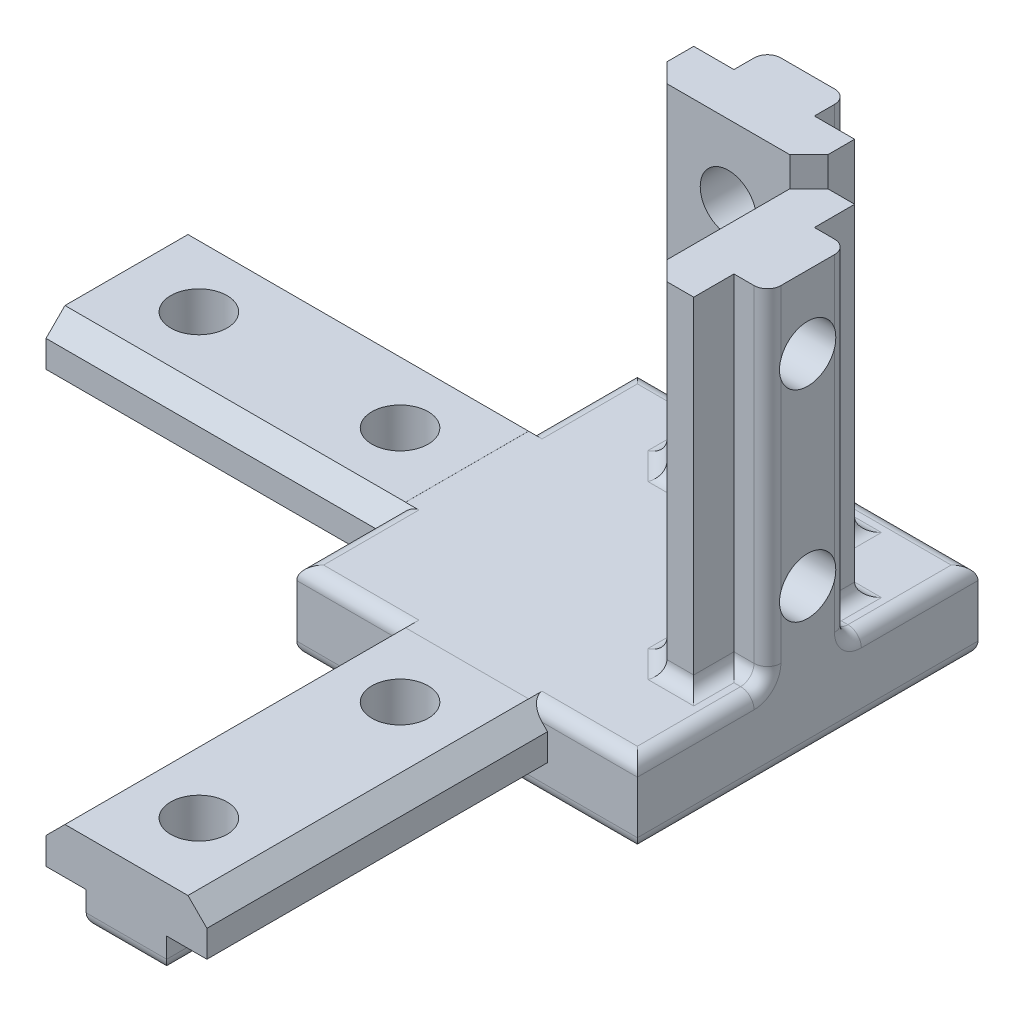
ISO-10303-21;
HEADER;
FILE_DESCRIPTION(('STEP AP214'),'2;1');
FILE_NAME('part.step','',(''),(''),'','','');
FILE_SCHEMA(('AUTOMOTIVE_DESIGN { 1 0 10303 214 1 1 1 1 }'));
ENDSEC;
DATA;
#1=APPLICATION_CONTEXT('core data for automotive mechanical design processes');
#2=APPLICATION_PROTOCOL_DEFINITION('international standard','automotive_design',2000,#1);
#3=PRODUCT_CONTEXT('',#1,'mechanical');
#4=PRODUCT('Part','Part','',(#3));
#5=PRODUCT_RELATED_PRODUCT_CATEGORY('part','',(#4));
#6=PRODUCT_DEFINITION_FORMATION('','',#4);
#7=PRODUCT_DEFINITION_CONTEXT('part definition',#1,'design');
#8=PRODUCT_DEFINITION('design','',#6,#7);
#9=PRODUCT_DEFINITION_SHAPE('','',#8);
#10=(LENGTH_UNIT() NAMED_UNIT(*) SI_UNIT(.MILLI.,.METRE.));
#11=(NAMED_UNIT(*) PLANE_ANGLE_UNIT() SI_UNIT($,.RADIAN.));
#12=(NAMED_UNIT(*) SI_UNIT($,.STERADIAN.) SOLID_ANGLE_UNIT());
#13=UNCERTAINTY_MEASURE_WITH_UNIT(LENGTH_MEASURE(1.E-05),#10,'distance_accuracy_value','');
#14=(GEOMETRIC_REPRESENTATION_CONTEXT(3) GLOBAL_UNCERTAINTY_ASSIGNED_CONTEXT((#13)) GLOBAL_UNIT_ASSIGNED_CONTEXT((#10,
#11,#12)) REPRESENTATION_CONTEXT('',''));
#15=CARTESIAN_POINT('',(0.,0.,0.));
#16=DIRECTION('',(0.,0.,1.));
#17=DIRECTION('',(1.,0.,0.));
#18=AXIS2_PLACEMENT_3D('',#15,#16,#17);
#19=CARTESIAN_POINT('',(-12.7,5.91,-12.7));
#20=DIRECTION('',(0.,0.,1.));
#21=DIRECTION('',(1.,0.,0.));
#22=AXIS2_PLACEMENT_3D('',#19,#20,#21);
#23=PLANE('',#22);
#24=DIRECTION('',(0.,-1.,0.));
#25=VECTOR('',#24,1.);
#26=CARTESIAN_POINT('',(1.99999999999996,5.91,-12.7));
#27=LINE('',#26,#25);
#28=CARTESIAN_POINT('',(1.99999999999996,31.31,-12.7));
#29=VERTEX_POINT('',#28);
#30=CARTESIAN_POINT('',(1.99999999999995,26.5503124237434,-12.7));
#31=VERTEX_POINT('',#30);
#32=EDGE_CURVE('E625',#29,#31,#27,.T.);
#33=ORIENTED_EDGE('',*,*,#32,.T.);
#34=CARTESIAN_POINT('',(0.,25.91,-12.7));
#35=DIRECTION('',(0.,0.,-1.));
#36=DIRECTION('',(-1.,0.,0.));
#37=AXIS2_PLACEMENT_3D('',#34,#35,#36);
#38=CIRCLE('',#37,2.09999999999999);
#39=CARTESIAN_POINT('',(-1.99999999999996,26.5503124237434,-12.7));
#40=VERTEX_POINT('',#39);
#41=EDGE_CURVE('E613',#40,#31,#38,.T.);
#42=ORIENTED_EDGE('',*,*,#41,.F.);
#43=DIRECTION('',(0.,-1.,0.));
#44=VECTOR('',#43,1.);
#45=CARTESIAN_POINT('',(-1.99999999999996,5.91,-12.7));
#46=LINE('',#45,#44);
#47=CARTESIAN_POINT('',(-1.99999999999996,31.31,-12.7));
#48=VERTEX_POINT('',#47);
#49=EDGE_CURVE('E622',#40,#48,#46,.F.);
#50=ORIENTED_EDGE('',*,*,#49,.T.);
#51=DIRECTION('',(-1.,0.,0.));
#52=VECTOR('',#51,1.);
#53=CARTESIAN_POINT('',(2.99999999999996,31.31,-12.7));
#54=LINE('',#53,#52);
#55=EDGE_CURVE('E1618',#29,#48,#54,.T.);
#56=ORIENTED_EDGE('',*,*,#55,.F.);
#57=EDGE_LOOP('',(#33,#42,#50,#56));
#58=FACE_BOUND('',#57,.T.);
#59=ADVANCED_FACE('F49',(#58),#23,.F.);
#60=CARTESIAN_POINT('',(-1.99999999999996,11.5503124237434,-12.7));
#61=VERTEX_POINT('',#60);
#62=CARTESIAN_POINT('',(-1.99999999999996,25.2696875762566,-12.7));
#63=VERTEX_POINT('',#62);
#64=EDGE_CURVE('E634',#61,#63,#46,.F.);
#65=ORIENTED_EDGE('',*,*,#64,.T.);
#66=CARTESIAN_POINT('',(1.99999999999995,25.2696875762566,-12.7));
#67=VERTEX_POINT('',#66);
#68=EDGE_CURVE('E70',#67,#63,#38,.T.);
#69=ORIENTED_EDGE('',*,*,#68,.F.);
#70=CARTESIAN_POINT('',(1.99999999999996,11.5503124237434,-12.7));
#71=VERTEX_POINT('',#70);
#72=EDGE_CURVE('E77',#67,#71,#27,.T.);
#73=ORIENTED_EDGE('',*,*,#72,.T.);
#74=CARTESIAN_POINT('',(0.,10.91,-12.7));
#75=DIRECTION('',(0.,0.,-1.));
#76=DIRECTION('',(-1.,0.,0.));
#77=AXIS2_PLACEMENT_3D('',#74,#75,#76);
#78=CIRCLE('',#77,2.09999999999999);
#79=EDGE_CURVE('E1751',#61,#71,#78,.T.);
#80=ORIENTED_EDGE('',*,*,#79,.F.);
#81=EDGE_LOOP('',(#65,#69,#73,#80));
#82=FACE_BOUND('',#81,.T.);
#83=ADVANCED_FACE('F1963',(#82),#23,.F.);
#84=CARTESIAN_POINT('',(1.99999999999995,10.2696875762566,-12.7));
#85=VERTEX_POINT('',#84);
#86=CARTESIAN_POINT('',(-1.99999999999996,10.2696875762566,-12.7));
#87=VERTEX_POINT('',#86);
#88=EDGE_CURVE('E1714',#85,#87,#78,.T.);
#89=ORIENTED_EDGE('',*,*,#88,.F.);
#90=CARTESIAN_POINT('',(1.99999999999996,6.91,-12.7));
#91=VERTEX_POINT('',#90);
#92=EDGE_CURVE('E656',#85,#91,#27,.T.);
#93=ORIENTED_EDGE('',*,*,#92,.T.);
#94=CARTESIAN_POINT('',(3.99999999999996,6.91,-12.7));
#95=DIRECTION('',(0.,0.,1.));
#96=DIRECTION('',(1.,0.,0.));
#97=AXIS2_PLACEMENT_3D('',#94,#95,#96);
#98=CIRCLE('',#97,2.);
#99=CARTESIAN_POINT('',(3.99999999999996,4.91,-12.7));
#100=VERTEX_POINT('',#99);
#101=EDGE_CURVE('E650',#100,#91,#98,.F.);
#102=ORIENTED_EDGE('',*,*,#101,.F.);
#103=DIRECTION('',(-1.,0.,0.));
#104=VECTOR('',#103,1.);
#105=CARTESIAN_POINT('',(12.7,4.91,-12.7));
#106=LINE('',#105,#104);
#107=CARTESIAN_POINT('',(12.7,4.91,-12.7));
#108=VERTEX_POINT('',#107);
#109=EDGE_CURVE('E645',#100,#108,#106,.F.);
#110=ORIENTED_EDGE('',*,*,#109,.T.);
#111=DIRECTION('',(0.,-1.,0.));
#112=VECTOR('',#111,1.);
#113=CARTESIAN_POINT('',(12.7,5.91,-12.7));
#114=LINE('',#113,#112);
#115=CARTESIAN_POINT('',(12.7,1.,-12.7));
#116=VERTEX_POINT('',#115);
#117=EDGE_CURVE('E1444',#108,#116,#114,.T.);
#118=ORIENTED_EDGE('',*,*,#117,.T.);
#119=DIRECTION('',(-1.,0.,0.));
#120=VECTOR('',#119,1.);
#121=CARTESIAN_POINT('',(-12.7,1.,-12.7));
#122=LINE('',#121,#120);
#123=CARTESIAN_POINT('',(-12.7,1.,-12.7));
#124=VERTEX_POINT('',#123);
#125=EDGE_CURVE('E661',#116,#124,#122,.T.);
#126=ORIENTED_EDGE('',*,*,#125,.T.);
#127=DIRECTION('',(0.,-1.,0.));
#128=VECTOR('',#127,1.);
#129=CARTESIAN_POINT('',(-12.7,5.91,-12.7));
#130=LINE('',#129,#128);
#131=CARTESIAN_POINT('',(-12.7,4.91,-12.7));
#132=VERTEX_POINT('',#131);
#133=EDGE_CURVE('E1440',#132,#124,#130,.T.);
#134=ORIENTED_EDGE('',*,*,#133,.F.);
#135=DIRECTION('',(-1.,0.,0.));
#136=VECTOR('',#135,1.);
#137=CARTESIAN_POINT('',(-2.99999999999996,4.91,-12.7));
#138=LINE('',#137,#136);
#139=CARTESIAN_POINT('',(-3.99999999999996,4.91,-12.7));
#140=VERTEX_POINT('',#139);
#141=EDGE_CURVE('E635',#132,#140,#138,.F.);
#142=ORIENTED_EDGE('',*,*,#141,.T.);
#143=CARTESIAN_POINT('',(-3.99999999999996,6.91,-12.7));
#144=DIRECTION('',(0.,0.,1.));
#145=DIRECTION('',(1.,0.,0.));
#146=AXIS2_PLACEMENT_3D('',#143,#144,#145);
#147=CIRCLE('',#146,2.);
#148=CARTESIAN_POINT('',(-1.99999999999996,6.91,-12.7));
#149=VERTEX_POINT('',#148);
#150=EDGE_CURVE('E640',#149,#140,#147,.F.);
#151=ORIENTED_EDGE('',*,*,#150,.F.);
#152=EDGE_CURVE('E637',#149,#87,#46,.F.);
#153=ORIENTED_EDGE('',*,*,#152,.T.);
#154=EDGE_LOOP('',(#89,#93,#102,#110,#118,#126,#134,#142,#151,#153));
#155=FACE_BOUND('',#154,.T.);
#156=ADVANCED_FACE('F1831',(#155),#23,.F.);
#157=CARTESIAN_POINT('',(12.7,5.91,-12.7));
#158=DIRECTION('',(-1.,0.,0.));
#159=DIRECTION('',(0.,0.,1.));
#160=AXIS2_PLACEMENT_3D('',#157,#158,#159);
#161=PLANE('',#160);
#162=DIRECTION('',(0.,-1.,0.));
#163=VECTOR('',#162,1.);
#164=CARTESIAN_POINT('',(12.7,5.91,2.00000000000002));
#165=LINE('',#164,#163);
#166=CARTESIAN_POINT('',(12.7,25.2696875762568,2.00000000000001));
#167=VERTEX_POINT('',#166);
#168=CARTESIAN_POINT('',(12.7,11.5503124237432,2.00000000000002));
#169=VERTEX_POINT('',#168);
#170=EDGE_CURVE('E695',#167,#169,#165,.T.);
#171=ORIENTED_EDGE('',*,*,#170,.T.);
#172=CARTESIAN_POINT('',(12.7,10.91,0.));
#173=DIRECTION('',(1.,0.,0.));
#174=DIRECTION('',(0.,0.,-1.));
#175=AXIS2_PLACEMENT_3D('',#172,#173,#174);
#176=CIRCLE('',#175,2.09999999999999);
#177=CARTESIAN_POINT('',(12.7,11.5503124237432,-2.00000000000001));
#178=VERTEX_POINT('',#177);
#179=EDGE_CURVE('E1863',#178,#169,#176,.T.);
#180=ORIENTED_EDGE('',*,*,#179,.F.);
#181=DIRECTION('',(0.,-1.,0.));
#182=VECTOR('',#181,1.);
#183=CARTESIAN_POINT('',(12.7,5.91,-2.00000000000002));
#184=LINE('',#183,#182);
#185=CARTESIAN_POINT('',(12.7,25.2696875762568,-2.00000000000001));
#186=VERTEX_POINT('',#185);
#187=EDGE_CURVE('E708',#178,#186,#184,.F.);
#188=ORIENTED_EDGE('',*,*,#187,.T.);
#189=CARTESIAN_POINT('',(12.7,25.91,0.));
#190=DIRECTION('',(1.,0.,0.));
#191=DIRECTION('',(0.,0.,-1.));
#192=AXIS2_PLACEMENT_3D('',#189,#190,#191);
#193=CIRCLE('',#192,2.09999999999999);
#194=EDGE_CURVE('E2037',#167,#186,#193,.T.);
#195=ORIENTED_EDGE('',*,*,#194,.F.);
#196=EDGE_LOOP('',(#171,#180,#188,#195));
#197=FACE_BOUND('',#196,.T.);
#198=ADVANCED_FACE('F1972',(#197),#161,.F.);
#199=CARTESIAN_POINT('',(12.7,31.31,2.00000000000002));
#200=VERTEX_POINT('',#199);
#201=CARTESIAN_POINT('',(12.7,26.5503124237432,2.00000000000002));
#202=VERTEX_POINT('',#201);
#203=EDGE_CURVE('E690',#200,#202,#165,.T.);
#204=ORIENTED_EDGE('',*,*,#203,.T.);
#205=CARTESIAN_POINT('',(12.7,26.5503124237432,-2.00000000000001));
#206=VERTEX_POINT('',#205);
#207=EDGE_CURVE('E1941',#206,#202,#193,.T.);
#208=ORIENTED_EDGE('',*,*,#207,.F.);
#209=CARTESIAN_POINT('',(12.7,31.31,-2.00000000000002));
#210=VERTEX_POINT('',#209);
#211=EDGE_CURVE('E702',#206,#210,#184,.F.);
#212=ORIENTED_EDGE('',*,*,#211,.T.);
#213=DIRECTION('',(0.,0.,-1.));
#214=VECTOR('',#213,1.);
#215=CARTESIAN_POINT('',(12.7,31.31,3.00000000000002));
#216=LINE('',#215,#214);
#217=EDGE_CURVE('E1552',#200,#210,#216,.T.);
#218=ORIENTED_EDGE('',*,*,#217,.F.);
#219=EDGE_LOOP('',(#204,#208,#212,#218));
#220=FACE_BOUND('',#219,.T.);
#221=ADVANCED_FACE('F1977',(#220),#161,.F.);
#222=CARTESIAN_POINT('',(0.,0.,0.));
#223=DIRECTION('',(0.,1.,0.));
#224=DIRECTION('',(0.,0.,1.));
#225=AXIS2_PLACEMENT_3D('',#222,#223,#224);
#226=PLANE('',#225);
#227=DIRECTION('',(0.,0.,-1.));
#228=VECTOR('',#227,1.);
#229=CARTESIAN_POINT('',(2.,0.,0.));
#230=LINE('',#229,#228);
#231=CARTESIAN_POINT('',(2.,0.,11.7));
#232=VERTEX_POINT('',#231);
#233=CARTESIAN_POINT('',(2.,0.,17.0596875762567));
#234=VERTEX_POINT('',#233);
#235=EDGE_CURVE('E736',#232,#234,#230,.F.);
#236=ORIENTED_EDGE('',*,*,#235,.T.);
#237=CARTESIAN_POINT('',(0.,0.,17.7));
#238=DIRECTION('',(0.,-1.,0.));
#239=DIRECTION('',(0.,0.,-1.));
#240=AXIS2_PLACEMENT_3D('',#237,#238,#239);
#241=CIRCLE('',#240,2.09999999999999);
#242=CARTESIAN_POINT('',(-1.99999999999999,0.,17.0596875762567));
#243=VERTEX_POINT('',#242);
#244=EDGE_CURVE('E1304',#243,#234,#241,.T.);
#245=ORIENTED_EDGE('',*,*,#244,.F.);
#246=DIRECTION('',(0.,0.,-1.));
#247=VECTOR('',#246,1.);
#248=CARTESIAN_POINT('',(-2.,0.,0.));
#249=LINE('',#248,#247);
#250=CARTESIAN_POINT('',(-2.,0.,11.7));
#251=VERTEX_POINT('',#250);
#252=EDGE_CURVE('E744',#243,#251,#249,.T.);
#253=ORIENTED_EDGE('',*,*,#252,.T.);
#254=DIRECTION('',(1.,0.,0.));
#255=VECTOR('',#254,1.);
#256=CARTESIAN_POINT('',(0.,0.,11.7));
#257=LINE('',#256,#255);
#258=CARTESIAN_POINT('',(-11.7,0.,11.7));
#259=VERTEX_POINT('',#258);
#260=EDGE_CURVE('E749',#251,#259,#257,.F.);
#261=ORIENTED_EDGE('',*,*,#260,.T.);
#262=DIRECTION('',(0.,0.,1.));
#263=VECTOR('',#262,1.);
#264=CARTESIAN_POINT('',(-11.7,0.,0.));
#265=LINE('',#264,#263);
#266=CARTESIAN_POINT('',(-11.7,0.,2.));
#267=VERTEX_POINT('',#266);
#268=EDGE_CURVE('E753',#259,#267,#265,.F.);
#269=ORIENTED_EDGE('',*,*,#268,.T.);
#270=DIRECTION('',(1.,0.,0.));
#271=VECTOR('',#270,1.);
#272=CARTESIAN_POINT('',(0.,0.,2.));
#273=LINE('',#272,#271);
#274=CARTESIAN_POINT('',(-17.0596875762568,0.,2.));
#275=VERTEX_POINT('',#274);
#276=EDGE_CURVE('E757',#267,#275,#273,.F.);
#277=ORIENTED_EDGE('',*,*,#276,.T.);
#278=CARTESIAN_POINT('',(-17.7,0.,0.));
#279=DIRECTION('',(0.,-1.,0.));
#280=DIRECTION('',(0.,0.,-1.));
#281=AXIS2_PLACEMENT_3D('',#278,#279,#280);
#282=CIRCLE('',#281,2.09999999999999);
#283=CARTESIAN_POINT('',(-17.0596875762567,0.,-1.99999999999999));
#284=VERTEX_POINT('',#283);
#285=EDGE_CURVE('E1209',#284,#275,#282,.T.);
#286=ORIENTED_EDGE('',*,*,#285,.F.);
#287=DIRECTION('',(1.,0.,0.));
#288=VECTOR('',#287,1.);
#289=CARTESIAN_POINT('',(0.,0.,-2.));
#290=LINE('',#289,#288);
#291=CARTESIAN_POINT('',(-11.7,0.,-2.));
#292=VERTEX_POINT('',#291);
#293=EDGE_CURVE('E765',#284,#292,#290,.T.);
#294=ORIENTED_EDGE('',*,*,#293,.T.);
#295=DIRECTION('',(0.,0.,1.));
#296=VECTOR('',#295,1.);
#297=CARTESIAN_POINT('',(-11.7,0.,0.));
#298=LINE('',#297,#296);
#299=CARTESIAN_POINT('',(-11.7,0.,-11.7));
#300=VERTEX_POINT('',#299);
#301=EDGE_CURVE('E770',#292,#300,#298,.F.);
#302=ORIENTED_EDGE('',*,*,#301,.T.);
#303=DIRECTION('',(-1.,0.,0.));
#304=VECTOR('',#303,1.);
#305=CARTESIAN_POINT('',(0.,0.,-11.7));
#306=LINE('',#305,#304);
#307=CARTESIAN_POINT('',(11.7,0.,-11.7));
#308=VERTEX_POINT('',#307);
#309=EDGE_CURVE('E774',#300,#308,#306,.F.);
#310=ORIENTED_EDGE('',*,*,#309,.T.);
#311=DIRECTION('',(0.,0.,-1.));
#312=VECTOR('',#311,1.);
#313=CARTESIAN_POINT('',(11.7,0.,0.));
#314=LINE('',#313,#312);
#315=CARTESIAN_POINT('',(11.7,0.,11.7));
#316=VERTEX_POINT('',#315);
#317=EDGE_CURVE('E729',#308,#316,#314,.F.);
#318=ORIENTED_EDGE('',*,*,#317,.T.);
#319=DIRECTION('',(1.,0.,0.));
#320=VECTOR('',#319,1.);
#321=CARTESIAN_POINT('',(0.,0.,11.7));
#322=LINE('',#321,#320);
#323=EDGE_CURVE('E732',#316,#232,#322,.F.);
#324=ORIENTED_EDGE('',*,*,#323,.T.);
#325=EDGE_LOOP('',(#236,#245,#253,#261,#269,#277,#286,#294,#302,#310,#318,#324));
#326=FACE_BOUND('',#325,.T.);
#327=ADVANCED_FACE('F1929',(#326),#226,.F.);
#328=CARTESIAN_POINT('',(-1.99999999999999,0.,32.0596875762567));
#329=VERTEX_POINT('',#328);
#330=CARTESIAN_POINT('',(-1.99999999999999,0.,18.3403124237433));
#331=VERTEX_POINT('',#330);
#332=EDGE_CURVE('E750',#329,#331,#249,.T.);
#333=ORIENTED_EDGE('',*,*,#332,.T.);
#334=CARTESIAN_POINT('',(2.,0.,18.3403124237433));
#335=VERTEX_POINT('',#334);
#336=EDGE_CURVE('E1303',#335,#331,#241,.T.);
#337=ORIENTED_EDGE('',*,*,#336,.F.);
#338=CARTESIAN_POINT('',(2.,0.,32.0596875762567));
#339=VERTEX_POINT('',#338);
#340=EDGE_CURVE('E741',#335,#339,#230,.F.);
#341=ORIENTED_EDGE('',*,*,#340,.T.);
#342=CARTESIAN_POINT('',(0.,0.,32.7));
#343=DIRECTION('',(0.,-1.,0.));
#344=DIRECTION('',(0.,0.,-1.));
#345=AXIS2_PLACEMENT_3D('',#342,#343,#344);
#346=CIRCLE('',#345,2.09999999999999);
#347=EDGE_CURVE('E1258',#329,#339,#346,.T.);
#348=ORIENTED_EDGE('',*,*,#347,.F.);
#349=EDGE_LOOP('',(#333,#337,#341,#348));
#350=FACE_BOUND('',#349,.T.);
#351=ADVANCED_FACE('F1819',(#350),#226,.F.);
#352=CARTESIAN_POINT('',(-2.,0.,37.1));
#353=VERTEX_POINT('',#352);
#354=CARTESIAN_POINT('',(-2.,0.,33.3403124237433));
#355=VERTEX_POINT('',#354);
#356=EDGE_CURVE('E745',#353,#355,#249,.T.);
#357=ORIENTED_EDGE('',*,*,#356,.T.);
#358=CARTESIAN_POINT('',(2.,0.,33.3403124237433));
#359=VERTEX_POINT('',#358);
#360=EDGE_CURVE('E1251',#359,#355,#346,.T.);
#361=ORIENTED_EDGE('',*,*,#360,.F.);
#362=CARTESIAN_POINT('',(2.,0.,37.1));
#363=VERTEX_POINT('',#362);
#364=EDGE_CURVE('E735',#359,#363,#230,.F.);
#365=ORIENTED_EDGE('',*,*,#364,.T.);
#366=DIRECTION('',(1.,0.,0.));
#367=VECTOR('',#366,1.);
#368=CARTESIAN_POINT('',(0.,0.,37.1));
#369=LINE('',#368,#367);
#370=EDGE_CURVE('E740',#363,#353,#369,.F.);
#371=ORIENTED_EDGE('',*,*,#370,.T.);
#372=EDGE_LOOP('',(#357,#361,#365,#371));
#373=FACE_BOUND('',#372,.T.);
#374=ADVANCED_FACE('F1325',(#373),#226,.F.);
#375=CARTESIAN_POINT('',(-18.3403124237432,0.,2.));
#376=VERTEX_POINT('',#375);
#377=CARTESIAN_POINT('',(-18.3403124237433,0.,-1.99999999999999));
#378=VERTEX_POINT('',#377);
#379=EDGE_CURVE('E1239',#376,#378,#282,.T.);
#380=ORIENTED_EDGE('',*,*,#379,.F.);
#381=CARTESIAN_POINT('',(-32.0596875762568,0.,2.));
#382=VERTEX_POINT('',#381);
#383=EDGE_CURVE('E762',#376,#382,#273,.F.);
#384=ORIENTED_EDGE('',*,*,#383,.T.);
#385=CARTESIAN_POINT('',(-32.7,0.,0.));
#386=DIRECTION('',(0.,-1.,0.));
#387=DIRECTION('',(0.,0.,-1.));
#388=AXIS2_PLACEMENT_3D('',#385,#386,#387);
#389=CIRCLE('',#388,2.09999999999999);
#390=CARTESIAN_POINT('',(-32.0596875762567,0.,-1.99999999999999));
#391=VERTEX_POINT('',#390);
#392=EDGE_CURVE('E1186',#391,#382,#389,.T.);
#393=ORIENTED_EDGE('',*,*,#392,.F.);
#394=EDGE_CURVE('E771',#391,#378,#290,.T.);
#395=ORIENTED_EDGE('',*,*,#394,.T.);
#396=EDGE_LOOP('',(#380,#384,#393,#395));
#397=FACE_BOUND('',#396,.T.);
#398=ADVANCED_FACE('F1238',(#397),#226,.F.);
#399=CARTESIAN_POINT('',(0.,5.91,0.));
#400=DIRECTION('',(0.,1.,0.));
#401=DIRECTION('',(0.,0.,1.));
#402=AXIS2_PLACEMENT_3D('',#399,#400,#401);
#403=PLANE('',#402);
#404=DIRECTION('',(1.,0.,0.));
#405=VECTOR('',#404,1.);
#406=CARTESIAN_POINT('',(-4.58999999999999,5.91,11.7));
#407=LINE('',#406,#405);
#408=CARTESIAN_POINT('',(-11.7,5.91,11.7));
#409=VERTEX_POINT('',#408);
#410=CARTESIAN_POINT('',(-4.58999999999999,5.91,11.7));
#411=VERTEX_POINT('',#410);
#412=EDGE_CURVE('E910',#409,#411,#407,.T.);
#413=ORIENTED_EDGE('',*,*,#412,.T.);
#414=DIRECTION('',(0.,0.,1.));
#415=VECTOR('',#414,1.);
#416=CARTESIAN_POINT('',(-4.58999999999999,5.91,38.1));
#417=LINE('',#416,#415);
#418=CARTESIAN_POINT('',(-4.58999999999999,5.91,12.7));
#419=VERTEX_POINT('',#418);
#420=EDGE_CURVE('E914',#411,#419,#417,.T.);
#421=ORIENTED_EDGE('',*,*,#420,.T.);
#422=DIRECTION('',(1.,0.,0.));
#423=VECTOR('',#422,1.);
#424=CARTESIAN_POINT('',(-12.7,5.91,12.7));
#425=LINE('',#424,#423);
#426=CARTESIAN_POINT('',(4.58999999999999,5.91,12.7));
#427=VERTEX_POINT('',#426);
#428=EDGE_CURVE('E1429',#419,#427,#425,.T.);
#429=ORIENTED_EDGE('',*,*,#428,.T.);
#430=DIRECTION('',(0.,0.,-1.));
#431=VECTOR('',#430,1.);
#432=CARTESIAN_POINT('',(4.58999999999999,5.91,38.1));
#433=LINE('',#432,#431);
#434=CARTESIAN_POINT('',(4.58999999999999,5.91,11.7));
#435=VERTEX_POINT('',#434);
#436=EDGE_CURVE('E899',#427,#435,#433,.T.);
#437=ORIENTED_EDGE('',*,*,#436,.T.);
#438=DIRECTION('',(1.,0.,0.));
#439=VECTOR('',#438,1.);
#440=CARTESIAN_POINT('',(12.7,5.91,11.7));
#441=LINE('',#440,#439);
#442=CARTESIAN_POINT('',(11.7,5.91,11.7));
#443=VERTEX_POINT('',#442);
#444=EDGE_CURVE('E896',#435,#443,#441,.T.);
#445=ORIENTED_EDGE('',*,*,#444,.T.);
#446=DIRECTION('',(0.,0.,-1.));
#447=VECTOR('',#446,1.);
#448=CARTESIAN_POINT('',(11.7,5.91,3.00000000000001));
#449=LINE('',#448,#447);
#450=CARTESIAN_POINT('',(11.7,5.91,4.00000000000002));
#451=VERTEX_POINT('',#450);
#452=EDGE_CURVE('E893',#443,#451,#449,.T.);
#453=ORIENTED_EDGE('',*,*,#452,.T.);
#454=DIRECTION('',(1.,0.,0.));
#455=VECTOR('',#454,1.);
#456=CARTESIAN_POINT('',(0.,5.91,4.00000000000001));
#457=LINE('',#456,#455);
#458=CARTESIAN_POINT('',(11.2,5.91,4.00000000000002));
#459=VERTEX_POINT('',#458);
#460=EDGE_CURVE('E890',#451,#459,#457,.F.);
#461=ORIENTED_EDGE('',*,*,#460,.T.);
#462=DIRECTION('',(0.,0.,-1.));
#463=VECTOR('',#462,1.);
#464=CARTESIAN_POINT('',(11.2,5.91,0.));
#465=LINE('',#464,#463);
#466=CARTESIAN_POINT('',(11.2,5.91,7.));
#467=VERTEX_POINT('',#466);
#468=EDGE_CURVE('E887',#459,#467,#465,.F.);
#469=ORIENTED_EDGE('',*,*,#468,.T.);
#470=DIRECTION('',(1.,0.,0.));
#471=VECTOR('',#470,1.);
#472=CARTESIAN_POINT('',(0.,5.91,7.));
#473=LINE('',#472,#471);
#474=CARTESIAN_POINT('',(7.7857864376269,5.91,7.));
#475=VERTEX_POINT('',#474);
#476=EDGE_CURVE('E884',#467,#475,#473,.F.);
#477=ORIENTED_EDGE('',*,*,#476,.T.);
#478=DIRECTION('',(0.707106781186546,0.,0.70710678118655));
#479=VECTOR('',#478,1.);
#480=CARTESIAN_POINT('',(0.39289321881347,5.91,-0.392893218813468));
#481=LINE('',#480,#479);
#482=CARTESIAN_POINT('',(5.78578643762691,5.91,5.));
#483=VERTEX_POINT('',#482);
#484=EDGE_CURVE('E881',#475,#483,#481,.F.);
#485=ORIENTED_EDGE('',*,*,#484,.T.);
#486=DIRECTION('',(0.,0.,1.));
#487=VECTOR('',#486,1.);
#488=CARTESIAN_POINT('',(5.78578643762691,5.91,0.));
#489=LINE('',#488,#487);
#490=CARTESIAN_POINT('',(5.78578643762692,5.91,-5.));
#491=VERTEX_POINT('',#490);
#492=EDGE_CURVE('E878',#483,#491,#489,.F.);
#493=ORIENTED_EDGE('',*,*,#492,.T.);
#494=DIRECTION('',(-0.707106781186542,0.,0.707106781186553));
#495=VECTOR('',#494,1.);
#496=CARTESIAN_POINT('',(0.392893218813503,5.91,0.392893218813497));
#497=LINE('',#496,#495);
#498=CARTESIAN_POINT('',(7.78578643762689,5.91,-7.00000000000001));
#499=VERTEX_POINT('',#498);
#500=EDGE_CURVE('E875',#491,#499,#497,.F.);
#501=ORIENTED_EDGE('',*,*,#500,.T.);
#502=DIRECTION('',(-1.,0.,0.));
#503=VECTOR('',#502,1.);
#504=CARTESIAN_POINT('',(0.,5.91,-7.00000000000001));
#505=LINE('',#504,#503);
#506=CARTESIAN_POINT('',(11.2,5.91,-7.));
#507=VERTEX_POINT('',#506);
#508=EDGE_CURVE('E872',#499,#507,#505,.F.);
#509=ORIENTED_EDGE('',*,*,#508,.T.);
#510=DIRECTION('',(0.,0.,-1.));
#511=VECTOR('',#510,1.);
#512=CARTESIAN_POINT('',(11.2,5.91,0.));
#513=LINE('',#512,#511);
#514=CARTESIAN_POINT('',(11.2,5.91,-4.00000000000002));
#515=VERTEX_POINT('',#514);
#516=EDGE_CURVE('E869',#507,#515,#513,.F.);
#517=ORIENTED_EDGE('',*,*,#516,.T.);
#518=DIRECTION('',(-1.,0.,0.));
#519=VECTOR('',#518,1.);
#520=CARTESIAN_POINT('',(0.,5.91,-4.00000000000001));
#521=LINE('',#520,#519);
#522=CARTESIAN_POINT('',(11.7,5.91,-4.00000000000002));
#523=VERTEX_POINT('',#522);
#524=EDGE_CURVE('E866',#515,#523,#521,.F.);
#525=ORIENTED_EDGE('',*,*,#524,.T.);
#526=DIRECTION('',(0.,0.,-1.));
#527=VECTOR('',#526,1.);
#528=CARTESIAN_POINT('',(11.7,5.91,-12.7));
#529=LINE('',#528,#527);
#530=CARTESIAN_POINT('',(11.7,5.91,-11.7));
#531=VERTEX_POINT('',#530);
#532=EDGE_CURVE('E863',#523,#531,#529,.T.);
#533=ORIENTED_EDGE('',*,*,#532,.T.);
#534=DIRECTION('',(-1.,0.,0.));
#535=VECTOR('',#534,1.);
#536=CARTESIAN_POINT('',(2.99999999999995,5.91,-11.7));
#537=LINE('',#536,#535);
#538=CARTESIAN_POINT('',(3.99999999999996,5.91,-11.7));
#539=VERTEX_POINT('',#538);
#540=EDGE_CURVE('E860',#531,#539,#537,.T.);
#541=ORIENTED_EDGE('',*,*,#540,.T.);
#542=DIRECTION('',(0.,0.,-1.));
#543=VECTOR('',#542,1.);
#544=CARTESIAN_POINT('',(3.99999999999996,5.91,0.));
#545=LINE('',#544,#543);
#546=CARTESIAN_POINT('',(3.99999999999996,5.91,-11.2));
#547=VERTEX_POINT('',#546);
#548=EDGE_CURVE('E857',#539,#547,#545,.F.);
#549=ORIENTED_EDGE('',*,*,#548,.T.);
#550=DIRECTION('',(-1.,0.,0.));
#551=VECTOR('',#550,1.);
#552=CARTESIAN_POINT('',(0.,5.91,-11.2));
#553=LINE('',#552,#551);
#554=CARTESIAN_POINT('',(6.99999999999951,5.91,-11.2));
#555=VERTEX_POINT('',#554);
#556=EDGE_CURVE('E854',#547,#555,#553,.F.);
#557=ORIENTED_EDGE('',*,*,#556,.T.);
#558=DIRECTION('',(0.,0.,-1.));
#559=VECTOR('',#558,1.);
#560=CARTESIAN_POINT('',(6.99999999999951,5.91,0.));
#561=LINE('',#560,#559);
#562=CARTESIAN_POINT('',(6.99999999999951,5.91,-7.7857864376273));
#563=VERTEX_POINT('',#562);
#564=EDGE_CURVE('E851',#555,#563,#561,.F.);
#565=ORIENTED_EDGE('',*,*,#564,.T.);
#566=DIRECTION('',(0.70710678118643,0.,-0.707106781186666));
#567=VECTOR('',#566,1.);
#568=CARTESIAN_POINT('',(-0.392893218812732,5.91,-0.392893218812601));
#569=LINE('',#568,#567);
#570=CARTESIAN_POINT('',(5.00000000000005,5.91,-5.78578643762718));
#571=VERTEX_POINT('',#570);
#572=EDGE_CURVE('E848',#563,#571,#569,.F.);
#573=ORIENTED_EDGE('',*,*,#572,.T.);
#574=DIRECTION('',(1.,0.,0.));
#575=VECTOR('',#574,1.);
#576=CARTESIAN_POINT('',(0.,5.91,-5.78578643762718));
#577=LINE('',#576,#575);
#578=CARTESIAN_POINT('',(-5.00000000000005,5.91,-5.78578643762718));
#579=VERTEX_POINT('',#578);
#580=EDGE_CURVE('E845',#571,#579,#577,.F.);
#581=ORIENTED_EDGE('',*,*,#580,.T.);
#582=DIRECTION('',(0.70710678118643,0.,0.707106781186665));
#583=VECTOR('',#582,1.);
#584=CARTESIAN_POINT('',(0.392893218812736,5.91,-0.392893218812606));
#585=LINE('',#584,#583);
#586=CARTESIAN_POINT('',(-6.99999999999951,5.91,-7.7857864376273));
#587=VERTEX_POINT('',#586);
#588=EDGE_CURVE('E842',#579,#587,#585,.F.);
#589=ORIENTED_EDGE('',*,*,#588,.T.);
#590=DIRECTION('',(0.,0.,1.));
#591=VECTOR('',#590,1.);
#592=CARTESIAN_POINT('',(-6.99999999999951,5.91,0.));
#593=LINE('',#592,#591);
#594=CARTESIAN_POINT('',(-6.99999999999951,5.91,-11.2));
#595=VERTEX_POINT('',#594);
#596=EDGE_CURVE('E836',#587,#595,#593,.F.);
#597=ORIENTED_EDGE('',*,*,#596,.T.);
#598=DIRECTION('',(-1.,0.,0.));
#599=VECTOR('',#598,1.);
#600=CARTESIAN_POINT('',(0.,5.91,-11.2));
#601=LINE('',#600,#599);
#602=CARTESIAN_POINT('',(-3.99999999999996,5.91,-11.2));
#603=VERTEX_POINT('',#602);
#604=EDGE_CURVE('E823',#595,#603,#601,.F.);
#605=ORIENTED_EDGE('',*,*,#604,.T.);
#606=DIRECTION('',(0.,0.,1.));
#607=VECTOR('',#606,1.);
#608=CARTESIAN_POINT('',(-3.99999999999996,5.91,0.));
#609=LINE('',#608,#607);
#610=CARTESIAN_POINT('',(-3.99999999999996,5.91,-11.7));
#611=VERTEX_POINT('',#610);
#612=EDGE_CURVE('E826',#603,#611,#609,.F.);
#613=ORIENTED_EDGE('',*,*,#612,.T.);
#614=DIRECTION('',(-1.,0.,0.));
#615=VECTOR('',#614,1.);
#616=CARTESIAN_POINT('',(-12.7,5.91,-11.7));
#617=LINE('',#616,#615);
#618=CARTESIAN_POINT('',(-11.7,5.91,-11.7));
#619=VERTEX_POINT('',#618);
#620=EDGE_CURVE('E829',#611,#619,#617,.T.);
#621=ORIENTED_EDGE('',*,*,#620,.T.);
#622=DIRECTION('',(0.,0.,1.));
#623=VECTOR('',#622,1.);
#624=CARTESIAN_POINT('',(-11.7,5.91,-4.59));
#625=LINE('',#624,#623);
#626=CARTESIAN_POINT('',(-11.7,5.91,-4.58999999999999));
#627=VERTEX_POINT('',#626);
#628=EDGE_CURVE('E832',#619,#627,#625,.T.);
#629=ORIENTED_EDGE('',*,*,#628,.T.);
#630=DIRECTION('',(-1.,0.,0.));
#631=VECTOR('',#630,1.);
#632=CARTESIAN_POINT('',(-38.1,5.91,-4.58999999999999));
#633=LINE('',#632,#631);
#634=CARTESIAN_POINT('',(-12.7,5.91,-4.59));
#635=VERTEX_POINT('',#634);
#636=EDGE_CURVE('E839',#627,#635,#633,.T.);
#637=ORIENTED_EDGE('',*,*,#636,.T.);
#638=DIRECTION('',(0.,0.,1.));
#639=VECTOR('',#638,1.);
#640=CARTESIAN_POINT('',(-12.7,5.91,-12.7));
#641=LINE('',#640,#639);
#642=CARTESIAN_POINT('',(-12.7,5.91,4.58999999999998));
#643=VERTEX_POINT('',#642);
#644=EDGE_CURVE('E1425',#635,#643,#641,.T.);
#645=ORIENTED_EDGE('',*,*,#644,.T.);
#646=DIRECTION('',(1.,0.,0.));
#647=VECTOR('',#646,1.);
#648=CARTESIAN_POINT('',(-38.1,5.91,4.59));
#649=LINE('',#648,#647);
#650=CARTESIAN_POINT('',(-11.7,5.91,4.58999999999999));
#651=VERTEX_POINT('',#650);
#652=EDGE_CURVE('E903',#643,#651,#649,.T.);
#653=ORIENTED_EDGE('',*,*,#652,.T.);
#654=DIRECTION('',(0.,0.,1.));
#655=VECTOR('',#654,1.);
#656=CARTESIAN_POINT('',(-11.7,5.91,12.7));
#657=LINE('',#656,#655);
#658=EDGE_CURVE('E907',#651,#409,#657,.T.);
#659=ORIENTED_EDGE('',*,*,#658,.T.);
#660=EDGE_LOOP('',(#413,#421,#429,#437,#445,#453,#461,#469,#477,#485,#493,#501,#509,#517,#525,
#533,#541,#549,#557,#565,#573,#581,#589,#597,#605,#613,#621,#629,#637,#645,#653,#659));
#661=FACE_BOUND('',#660,.T.);
#662=ADVANCED_FACE('F2004',(#661),#403,.T.);
#663=CARTESIAN_POINT('',(-12.7,5.91,-12.7));
#664=DIRECTION('',(1.,0.,0.));
#665=DIRECTION('',(0.,0.,-1.));
#666=AXIS2_PLACEMENT_3D('',#663,#664,#665);
#667=PLANE('',#666);
#668=ORIENTED_EDGE('',*,*,#133,.T.);
#669=DIRECTION('',(0.,0.,1.));
#670=VECTOR('',#669,1.);
#671=CARTESIAN_POINT('',(-12.7,1.,-12.7));
#672=LINE('',#671,#670);
#673=CARTESIAN_POINT('',(-12.7,1.,-3.));
#674=VERTEX_POINT('',#673);
#675=EDGE_CURVE('E781',#124,#674,#672,.T.);
#676=ORIENTED_EDGE('',*,*,#675,.T.);
#677=DIRECTION('',(0.,-1.,0.));
#678=VECTOR('',#677,1.);
#679=CARTESIAN_POINT('',(-12.7,0.,-3.));
#680=LINE('',#679,#678);
#681=CARTESIAN_POINT('',(-12.7,2.5,-3.));
#682=VERTEX_POINT('',#681);
#683=EDGE_CURVE('E1522',#682,#674,#680,.T.);
#684=ORIENTED_EDGE('',*,*,#683,.F.);
#685=DIRECTION('',(0.,0.,1.));
#686=VECTOR('',#685,1.);
#687=CARTESIAN_POINT('',(-12.7,2.5,-3.));
#688=LINE('',#687,#686);
#689=CARTESIAN_POINT('',(-12.7,2.5,-6.));
#690=VERTEX_POINT('',#689);
#691=EDGE_CURVE('E1470',#690,#682,#688,.T.);
#692=ORIENTED_EDGE('',*,*,#691,.F.);
#693=DIRECTION('',(0.,-1.,0.));
#694=VECTOR('',#693,1.);
#695=CARTESIAN_POINT('',(-12.7,2.5,-6.));
#696=LINE('',#695,#694);
#697=CARTESIAN_POINT('',(-12.7,4.5,-6.));
#698=VERTEX_POINT('',#697);
#699=EDGE_CURVE('E1463',#698,#690,#696,.T.);
#700=ORIENTED_EDGE('',*,*,#699,.F.);
#701=DIRECTION('',(0.,-0.707106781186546,-0.707106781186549));
#702=VECTOR('',#701,1.);
#703=CARTESIAN_POINT('',(-12.7,4.5,-6.));
#704=LINE('',#703,#702);
#705=CARTESIAN_POINT('',(-12.7,4.91,-5.59));
#706=VERTEX_POINT('',#705);
#707=EDGE_CURVE('E1449',#706,#698,#704,.T.);
#708=ORIENTED_EDGE('',*,*,#707,.F.);
#709=DIRECTION('',(0.,0.,1.));
#710=VECTOR('',#709,1.);
#711=CARTESIAN_POINT('',(-12.7,4.91,-12.7));
#712=LINE('',#711,#710);
#713=EDGE_CURVE('E778',#706,#132,#712,.F.);
#714=ORIENTED_EDGE('',*,*,#713,.T.);
#715=EDGE_LOOP('',(#668,#676,#684,#692,#700,#708,#714));
#716=FACE_BOUND('',#715,.T.);
#717=ADVANCED_FACE('F2002',(#716),#667,.F.);
#718=DIRECTION('',(0.,1.,0.));
#719=VECTOR('',#718,1.);
#720=CARTESIAN_POINT('',(-12.7,0.,3.));
#721=LINE('',#720,#719);
#722=CARTESIAN_POINT('',(-12.7,1.,3.));
#723=VERTEX_POINT('',#722);
#724=CARTESIAN_POINT('',(-12.7,2.5,3.));
#725=VERTEX_POINT('',#724);
#726=EDGE_CURVE('E1489',#723,#725,#721,.T.);
#727=ORIENTED_EDGE('',*,*,#726,.F.);
#728=DIRECTION('',(0.,0.,1.));
#729=VECTOR('',#728,1.);
#730=CARTESIAN_POINT('',(-12.7,1.,-12.7));
#731=LINE('',#730,#729);
#732=CARTESIAN_POINT('',(-12.7,1.,12.7));
#733=VERTEX_POINT('',#732);
#734=EDGE_CURVE('E796',#723,#733,#731,.T.);
#735=ORIENTED_EDGE('',*,*,#734,.T.);
#736=DIRECTION('',(0.,-1.,0.));
#737=VECTOR('',#736,1.);
#738=CARTESIAN_POINT('',(-12.7,5.91,12.7));
#739=LINE('',#738,#737);
#740=CARTESIAN_POINT('',(-12.7,4.91,12.7));
#741=VERTEX_POINT('',#740);
#742=EDGE_CURVE('E1436',#741,#733,#739,.T.);
#743=ORIENTED_EDGE('',*,*,#742,.F.);
#744=DIRECTION('',(0.,0.,1.));
#745=VECTOR('',#744,1.);
#746=CARTESIAN_POINT('',(-12.7,4.91,4.58999999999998));
#747=LINE('',#746,#745);
#748=CARTESIAN_POINT('',(-12.7,4.91,5.59));
#749=VERTEX_POINT('',#748);
#750=EDGE_CURVE('E793',#741,#749,#747,.F.);
#751=ORIENTED_EDGE('',*,*,#750,.T.);
#752=DIRECTION('',(0.,0.707106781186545,-0.70710678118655));
#753=VECTOR('',#752,1.);
#754=CARTESIAN_POINT('',(-12.7,4.5,6.));
#755=LINE('',#754,#753);
#756=CARTESIAN_POINT('',(-12.7,4.5,6.));
#757=VERTEX_POINT('',#756);
#758=EDGE_CURVE('E1471',#757,#749,#755,.T.);
#759=ORIENTED_EDGE('',*,*,#758,.F.);
#760=DIRECTION('',(0.,1.,0.));
#761=VECTOR('',#760,1.);
#762=CARTESIAN_POINT('',(-12.7,2.5,6.));
#763=LINE('',#762,#761);
#764=CARTESIAN_POINT('',(-12.7,2.5,6.));
#765=VERTEX_POINT('',#764);
#766=EDGE_CURVE('E1481',#765,#757,#763,.T.);
#767=ORIENTED_EDGE('',*,*,#766,.F.);
#768=DIRECTION('',(0.,0.,1.));
#769=VECTOR('',#768,1.);
#770=CARTESIAN_POINT('',(-12.7,2.5,3.));
#771=LINE('',#770,#769);
#772=EDGE_CURVE('E1485',#725,#765,#771,.T.);
#773=ORIENTED_EDGE('',*,*,#772,.F.);
#774=EDGE_LOOP('',(#727,#735,#743,#751,#759,#767,#773));
#775=FACE_BOUND('',#774,.T.);
#776=ADVANCED_FACE('F2000',(#775),#667,.F.);
#777=CARTESIAN_POINT('',(-12.7,5.91,12.7));
#778=DIRECTION('',(0.,0.,-1.));
#779=DIRECTION('',(-1.,0.,0.));
#780=AXIS2_PLACEMENT_3D('',#777,#778,#779);
#781=PLANE('',#780);
#782=ORIENTED_EDGE('',*,*,#742,.T.);
#783=DIRECTION('',(1.,0.,0.));
#784=VECTOR('',#783,1.);
#785=CARTESIAN_POINT('',(-12.7,1.,12.7));
#786=LINE('',#785,#784);
#787=CARTESIAN_POINT('',(-3.,1.,12.7));
#788=VERTEX_POINT('',#787);
#789=EDGE_CURVE('E802',#733,#788,#786,.T.);
#790=ORIENTED_EDGE('',*,*,#789,.T.);
#791=DIRECTION('',(0.,-1.,0.));
#792=VECTOR('',#791,1.);
#793=CARTESIAN_POINT('',(-3.,0.,12.7));
#794=LINE('',#793,#792);
#795=CARTESIAN_POINT('',(-3.,2.5,12.7));
#796=VERTEX_POINT('',#795);
#797=EDGE_CURVE('E1390',#796,#788,#794,.T.);
#798=ORIENTED_EDGE('',*,*,#797,.F.);
#799=DIRECTION('',(1.,0.,0.));
#800=VECTOR('',#799,1.);
#801=CARTESIAN_POINT('',(-3.,2.5,12.7));
#802=LINE('',#801,#800);
#803=CARTESIAN_POINT('',(-6.,2.5,12.7));
#804=VERTEX_POINT('',#803);
#805=EDGE_CURVE('E1386',#804,#796,#802,.T.);
#806=ORIENTED_EDGE('',*,*,#805,.F.);
#807=DIRECTION('',(0.,-1.,0.));
#808=VECTOR('',#807,1.);
#809=CARTESIAN_POINT('',(-6.,2.5,12.7));
#810=LINE('',#809,#808);
#811=CARTESIAN_POINT('',(-6.,4.5,12.7));
#812=VERTEX_POINT('',#811);
#813=EDGE_CURVE('E1381',#812,#804,#810,.T.);
#814=ORIENTED_EDGE('',*,*,#813,.F.);
#815=DIRECTION('',(-0.70710678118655,-0.707106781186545,0.));
#816=VECTOR('',#815,1.);
#817=CARTESIAN_POINT('',(-6.,4.5,12.7));
#818=LINE('',#817,#816);
#819=CARTESIAN_POINT('',(-5.59,4.91,12.7));
#820=VERTEX_POINT('',#819);
#821=EDGE_CURVE('E1382',#820,#812,#818,.T.);
#822=ORIENTED_EDGE('',*,*,#821,.F.);
#823=DIRECTION('',(1.,0.,0.));
#824=VECTOR('',#823,1.);
#825=CARTESIAN_POINT('',(-12.7,4.91,12.7));
#826=LINE('',#825,#824);
#827=EDGE_CURVE('E799',#820,#741,#826,.F.);
#828=ORIENTED_EDGE('',*,*,#827,.T.);
#829=EDGE_LOOP('',(#782,#790,#798,#806,#814,#822,#828));
#830=FACE_BOUND('',#829,.T.);
#831=ADVANCED_FACE('F1994',(#830),#781,.F.);
#832=DIRECTION('',(0.,1.,0.));
#833=VECTOR('',#832,1.);
#834=CARTESIAN_POINT('',(3.,0.,12.7));
#835=LINE('',#834,#833);
#836=CARTESIAN_POINT('',(3.,1.,12.7));
#837=VERTEX_POINT('',#836);
#838=CARTESIAN_POINT('',(3.,2.5,12.7));
#839=VERTEX_POINT('',#838);
#840=EDGE_CURVE('E1342',#837,#839,#835,.T.);
#841=ORIENTED_EDGE('',*,*,#840,.F.);
#842=DIRECTION('',(1.,0.,0.));
#843=VECTOR('',#842,1.);
#844=CARTESIAN_POINT('',(-12.7,1.,12.7));
#845=LINE('',#844,#843);
#846=CARTESIAN_POINT('',(12.7,1.,12.7));
#847=VERTEX_POINT('',#846);
#848=EDGE_CURVE('E817',#837,#847,#845,.T.);
#849=ORIENTED_EDGE('',*,*,#848,.T.);
#850=DIRECTION('',(0.,-1.,0.));
#851=VECTOR('',#850,1.);
#852=CARTESIAN_POINT('',(12.7,5.91,12.7));
#853=LINE('',#852,#851);
#854=CARTESIAN_POINT('',(12.7,4.91,12.7));
#855=VERTEX_POINT('',#854);
#856=EDGE_CURVE('E1433',#855,#847,#853,.T.);
#857=ORIENTED_EDGE('',*,*,#856,.F.);
#858=DIRECTION('',(1.,0.,0.));
#859=VECTOR('',#858,1.);
#860=CARTESIAN_POINT('',(4.58999999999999,4.91,12.7));
#861=LINE('',#860,#859);
#862=CARTESIAN_POINT('',(5.59,4.91,12.7));
#863=VERTEX_POINT('',#862);
#864=EDGE_CURVE('E814',#855,#863,#861,.F.);
#865=ORIENTED_EDGE('',*,*,#864,.T.);
#866=DIRECTION('',(-0.707106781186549,0.707106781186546,0.));
#867=VECTOR('',#866,1.);
#868=CARTESIAN_POINT('',(6.,4.5,12.7));
#869=LINE('',#868,#867);
#870=CARTESIAN_POINT('',(6.,4.5,12.7));
#871=VERTEX_POINT('',#870);
#872=EDGE_CURVE('E1370',#871,#863,#869,.T.);
#873=ORIENTED_EDGE('',*,*,#872,.F.);
#874=DIRECTION('',(0.,1.,0.));
#875=VECTOR('',#874,1.);
#876=CARTESIAN_POINT('',(6.,2.5,12.7));
#877=LINE('',#876,#875);
#878=CARTESIAN_POINT('',(6.,2.5,12.7));
#879=VERTEX_POINT('',#878);
#880=EDGE_CURVE('E1357',#879,#871,#877,.T.);
#881=ORIENTED_EDGE('',*,*,#880,.F.);
#882=DIRECTION('',(1.,0.,0.));
#883=VECTOR('',#882,1.);
#884=CARTESIAN_POINT('',(3.,2.5,12.7));
#885=LINE('',#884,#883);
#886=EDGE_CURVE('E1350',#839,#879,#885,.T.);
#887=ORIENTED_EDGE('',*,*,#886,.F.);
#888=EDGE_LOOP('',(#841,#849,#857,#865,#873,#881,#887));
#889=FACE_BOUND('',#888,.T.);
#890=ADVANCED_FACE('F1346',(#889),#781,.F.);
#891=CARTESIAN_POINT('',(12.7,6.91,-2.00000000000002));
#892=VERTEX_POINT('',#891);
#893=CARTESIAN_POINT('',(12.7,10.2696875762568,-2.00000000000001));
#894=VERTEX_POINT('',#893);
#895=EDGE_CURVE('E703',#892,#894,#184,.F.);
#896=ORIENTED_EDGE('',*,*,#895,.T.);
#897=CARTESIAN_POINT('',(12.7,10.2696875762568,2.00000000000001));
#898=VERTEX_POINT('',#897);
#899=EDGE_CURVE('E1859',#898,#894,#176,.T.);
#900=ORIENTED_EDGE('',*,*,#899,.F.);
#901=CARTESIAN_POINT('',(12.7,6.91,2.00000000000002));
#902=VERTEX_POINT('',#901);
#903=EDGE_CURVE('E689',#898,#902,#165,.T.);
#904=ORIENTED_EDGE('',*,*,#903,.T.);
#905=CARTESIAN_POINT('',(12.7,6.91,4.00000000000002));
#906=DIRECTION('',(-1.,0.,0.));
#907=DIRECTION('',(0.,0.,1.));
#908=AXIS2_PLACEMENT_3D('',#905,#906,#907);
#909=CIRCLE('',#908,2.);
#910=CARTESIAN_POINT('',(12.7,4.91,4.00000000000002));
#911=VERTEX_POINT('',#910);
#912=EDGE_CURVE('E685',#911,#902,#909,.F.);
#913=ORIENTED_EDGE('',*,*,#912,.F.);
#914=DIRECTION('',(0.,0.,-1.));
#915=VECTOR('',#914,1.);
#916=CARTESIAN_POINT('',(12.7,4.91,12.7));
#917=LINE('',#916,#915);
#918=EDGE_CURVE('E682',#911,#855,#917,.F.);
#919=ORIENTED_EDGE('',*,*,#918,.T.);
#920=ORIENTED_EDGE('',*,*,#856,.T.);
#921=DIRECTION('',(0.,0.,-1.));
#922=VECTOR('',#921,1.);
#923=CARTESIAN_POINT('',(12.7,1.,-12.7));
#924=LINE('',#923,#922);
#925=EDGE_CURVE('E707',#847,#116,#924,.T.);
#926=ORIENTED_EDGE('',*,*,#925,.T.);
#927=ORIENTED_EDGE('',*,*,#117,.F.);
#928=DIRECTION('',(0.,0.,-1.));
#929=VECTOR('',#928,1.);
#930=CARTESIAN_POINT('',(12.7,4.91,-3.00000000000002));
#931=LINE('',#930,#929);
#932=CARTESIAN_POINT('',(12.7,4.91,-4.00000000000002));
#933=VERTEX_POINT('',#932);
#934=EDGE_CURVE('E699',#108,#933,#931,.F.);
#935=ORIENTED_EDGE('',*,*,#934,.T.);
#936=CARTESIAN_POINT('',(12.7,6.91,-4.00000000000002));
#937=DIRECTION('',(-1.,0.,0.));
#938=DIRECTION('',(0.,0.,1.));
#939=AXIS2_PLACEMENT_3D('',#936,#937,#938);
#940=CIRCLE('',#939,2.);
#941=EDGE_CURVE('E694',#892,#933,#940,.F.);
#942=ORIENTED_EDGE('',*,*,#941,.F.);
#943=EDGE_LOOP('',(#896,#900,#904,#913,#919,#920,#926,#927,#935,#942));
#944=FACE_BOUND('',#943,.T.);
#945=ADVANCED_FACE('F1846',(#944),#161,.F.);
#946=CARTESIAN_POINT('',(-37.1,0.,-1.99999999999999));
#947=VERTEX_POINT('',#946);
#948=CARTESIAN_POINT('',(-33.3403124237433,0.,-1.99999999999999));
#949=VERTEX_POINT('',#948);
#950=EDGE_CURVE('E766',#947,#949,#290,.T.);
#951=ORIENTED_EDGE('',*,*,#950,.T.);
#952=CARTESIAN_POINT('',(-33.3403124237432,0.,2.));
#953=VERTEX_POINT('',#952);
#954=EDGE_CURVE('E1213',#953,#949,#389,.T.);
#955=ORIENTED_EDGE('',*,*,#954,.F.);
#956=CARTESIAN_POINT('',(-37.1,0.,2.00000000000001));
#957=VERTEX_POINT('',#956);
#958=EDGE_CURVE('E756',#953,#957,#273,.F.);
#959=ORIENTED_EDGE('',*,*,#958,.T.);
#960=DIRECTION('',(0.,0.,1.));
#961=VECTOR('',#960,1.);
#962=CARTESIAN_POINT('',(-37.1,0.,0.));
#963=LINE('',#962,#961);
#964=EDGE_CURVE('E761',#957,#947,#963,.F.);
#965=ORIENTED_EDGE('',*,*,#964,.T.);
#966=EDGE_LOOP('',(#951,#955,#959,#965));
#967=FACE_BOUND('',#966,.T.);
#968=ADVANCED_FACE('F1985',(#967),#226,.F.);
#969=CARTESIAN_POINT('',(0.,0.,12.7));
#970=DIRECTION('',(0.,0.,-1.));
#971=DIRECTION('',(-1.,0.,0.));
#972=AXIS2_PLACEMENT_3D('',#969,#970,#971);
#973=PLANE('',#972);
#974=ORIENTED_EDGE('',*,*,#428,.F.);
#975=CARTESIAN_POINT('',(-4.5857864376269,5.91421356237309,12.7));
#976=VERTEX_POINT('',#975);
#977=EDGE_CURVE('E1377',#976,#419,#818,.T.);
#978=ORIENTED_EDGE('',*,*,#977,.F.);
#979=DIRECTION('',(-1.,0.,0.));
#980=VECTOR('',#979,1.);
#981=CARTESIAN_POINT('',(4.5857864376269,5.91421356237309,12.7));
#982=LINE('',#981,#980);
#983=CARTESIAN_POINT('',(4.5857864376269,5.91421356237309,12.7));
#984=VERTEX_POINT('',#983);
#985=EDGE_CURVE('E1374',#984,#976,#982,.T.);
#986=ORIENTED_EDGE('',*,*,#985,.F.);
#987=EDGE_CURVE('E1369',#427,#984,#869,.T.);
#988=ORIENTED_EDGE('',*,*,#987,.F.);
#989=EDGE_LOOP('',(#974,#978,#986,#988));
#990=FACE_BOUND('',#989,.T.);
#991=ADVANCED_FACE('F1991',(#990),#973,.T.);
#992=CARTESIAN_POINT('',(3.,0.,38.1));
#993=DIRECTION('',(-1.,0.,0.));
#994=DIRECTION('',(0.,0.,1.));
#995=AXIS2_PLACEMENT_3D('',#992,#993,#994);
#996=PLANE('',#995);
#997=DIRECTION('',(0.,1.,0.));
#998=VECTOR('',#997,1.);
#999=CARTESIAN_POINT('',(3.,0.,38.1));
#1000=LINE('',#999,#998);
#1001=CARTESIAN_POINT('',(3.,1.,38.1));
#1002=VERTEX_POINT('',#1001);
#1003=CARTESIAN_POINT('',(3.,2.5,38.1));
#1004=VERTEX_POINT('',#1003);
#1005=EDGE_CURVE('E1344',#1002,#1004,#1000,.T.);
#1006=ORIENTED_EDGE('',*,*,#1005,.F.);
#1007=DIRECTION('',(0.,0.,-1.));
#1008=VECTOR('',#1007,1.);
#1009=CARTESIAN_POINT('',(3.,1.,38.1));
#1010=LINE('',#1009,#1008);
#1011=EDGE_CURVE('E811',#1002,#837,#1010,.T.);
#1012=ORIENTED_EDGE('',*,*,#1011,.T.);
#1013=ORIENTED_EDGE('',*,*,#840,.T.);
#1014=DIRECTION('',(0.,0.,-1.));
#1015=VECTOR('',#1014,1.);
#1016=CARTESIAN_POINT('',(3.,2.5,38.1));
#1017=LINE('',#1016,#1015);
#1018=EDGE_CURVE('E1422',#1004,#839,#1017,.T.);
#1019=ORIENTED_EDGE('',*,*,#1018,.F.);
#1020=EDGE_LOOP('',(#1006,#1012,#1013,#1019));
#1021=FACE_BOUND('',#1020,.T.);
#1022=ADVANCED_FACE('F1340',(#1021),#996,.F.);
#1023=CARTESIAN_POINT('',(3.,2.5,38.1));
#1024=DIRECTION('',(0.,1.,0.));
#1025=DIRECTION('',(0.,0.,1.));
#1026=AXIS2_PLACEMENT_3D('',#1023,#1024,#1025);
#1027=PLANE('',#1026);
#1028=ORIENTED_EDGE('',*,*,#886,.T.);
#1029=DIRECTION('',(0.,0.,-1.));
#1030=VECTOR('',#1029,1.);
#1031=CARTESIAN_POINT('',(6.,2.5,38.1));
#1032=LINE('',#1031,#1030);
#1033=CARTESIAN_POINT('',(6.,2.5,38.1));
#1034=VERTEX_POINT('',#1033);
#1035=EDGE_CURVE('E1418',#1034,#879,#1032,.T.);
#1036=ORIENTED_EDGE('',*,*,#1035,.F.);
#1037=DIRECTION('',(1.,0.,0.));
#1038=VECTOR('',#1037,1.);
#1039=CARTESIAN_POINT('',(3.,2.5,38.1));
#1040=LINE('',#1039,#1038);
#1041=EDGE_CURVE('E1890',#1004,#1034,#1040,.T.);
#1042=ORIENTED_EDGE('',*,*,#1041,.F.);
#1043=ORIENTED_EDGE('',*,*,#1018,.T.);
#1044=EDGE_LOOP('',(#1028,#1036,#1042,#1043));
#1045=FACE_BOUND('',#1044,.T.);
#1046=ADVANCED_FACE('F1888',(#1045),#1027,.F.);
#1047=CARTESIAN_POINT('',(6.,2.5,38.1));
#1048=DIRECTION('',(-1.,0.,0.));
#1049=DIRECTION('',(0.,0.,1.));
#1050=AXIS2_PLACEMENT_3D('',#1047,#1048,#1049);
#1051=PLANE('',#1050);
#1052=ORIENTED_EDGE('',*,*,#880,.T.);
#1053=DIRECTION('',(0.,0.,-1.));
#1054=VECTOR('',#1053,1.);
#1055=CARTESIAN_POINT('',(6.,4.5,38.1));
#1056=LINE('',#1055,#1054);
#1057=CARTESIAN_POINT('',(6.,4.5,38.1));
#1058=VERTEX_POINT('',#1057);
#1059=EDGE_CURVE('E1414',#1058,#871,#1056,.T.);
#1060=ORIENTED_EDGE('',*,*,#1059,.F.);
#1061=DIRECTION('',(0.,1.,0.));
#1062=VECTOR('',#1061,1.);
#1063=CARTESIAN_POINT('',(6.,2.5,38.1));
#1064=LINE('',#1063,#1062);
#1065=EDGE_CURVE('E1885',#1034,#1058,#1064,.T.);
#1066=ORIENTED_EDGE('',*,*,#1065,.F.);
#1067=ORIENTED_EDGE('',*,*,#1035,.T.);
#1068=EDGE_LOOP('',(#1052,#1060,#1066,#1067));
#1069=FACE_BOUND('',#1068,.T.);
#1070=ADVANCED_FACE('F1884',(#1069),#1051,.F.);
#1071=CARTESIAN_POINT('',(6.,4.5,38.1));
#1072=DIRECTION('',(-0.707106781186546,-0.707106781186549,0.));
#1073=DIRECTION('',(0.707106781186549,-0.707106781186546,0.));
#1074=AXIS2_PLACEMENT_3D('',#1071,#1072,#1073);
#1075=PLANE('',#1074);
#1076=ORIENTED_EDGE('',*,*,#872,.T.);
#1077=CARTESIAN_POINT('',(5.59,4.91,11.7));
#1078=DIRECTION('',(-0.707106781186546,-0.707106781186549,0.));
#1079=DIRECTION('',(-0.707106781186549,0.707106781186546,0.));
#1080=AXIS2_PLACEMENT_3D('',#1077,#1078,#1079);
#1081=ELLIPSE('',#1080,1.4142135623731,1.);
#1082=EDGE_CURVE('E956',#863,#435,#1081,.T.);
#1083=ORIENTED_EDGE('',*,*,#1082,.T.);
#1084=ORIENTED_EDGE('',*,*,#436,.F.);
#1085=ORIENTED_EDGE('',*,*,#987,.T.);
#1086=DIRECTION('',(0.,0.,-1.));
#1087=VECTOR('',#1086,1.);
#1088=CARTESIAN_POINT('',(4.5857864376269,5.91421356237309,38.1));
#1089=LINE('',#1088,#1087);
#1090=CARTESIAN_POINT('',(4.5857864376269,5.91421356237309,38.1));
#1091=VERTEX_POINT('',#1090);
#1092=EDGE_CURVE('E1410',#1091,#984,#1089,.T.);
#1093=ORIENTED_EDGE('',*,*,#1092,.F.);
#1094=DIRECTION('',(-0.707106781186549,0.707106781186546,0.));
#1095=VECTOR('',#1094,1.);
#1096=CARTESIAN_POINT('',(6.,4.5,38.1));
#1097=LINE('',#1096,#1095);
#1098=EDGE_CURVE('E1881',#1058,#1091,#1097,.T.);
#1099=ORIENTED_EDGE('',*,*,#1098,.F.);
#1100=ORIENTED_EDGE('',*,*,#1059,.T.);
#1101=EDGE_LOOP('',(#1076,#1083,#1084,#1085,#1093,#1099,#1100));
#1102=FACE_BOUND('',#1101,.T.);
#1103=ADVANCED_FACE('F1877',(#1102),#1075,.F.);
#1104=CARTESIAN_POINT('',(4.5857864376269,5.91421356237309,38.1));
#1105=DIRECTION('',(0.,-1.,0.));
#1106=DIRECTION('',(1.,0.,0.));
#1107=AXIS2_PLACEMENT_3D('',#1104,#1105,#1106);
#1108=PLANE('',#1107);
#1109=CARTESIAN_POINT('',(0.,5.91421356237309,17.7));
#1110=DIRECTION('',(0.,-1.,0.));
#1111=DIRECTION('',(1.,0.,0.));
#1112=AXIS2_PLACEMENT_3D('',#1109,#1110,#1111);
#1113=CIRCLE('',#1112,2.09999999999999);
#1114=CARTESIAN_POINT('',(2.09999999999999,5.91421356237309,17.7));
#1115=VERTEX_POINT('',#1114);
#1116=EDGE_CURVE('E1302',#1115,#1115,#1113,.T.);
#1117=ORIENTED_EDGE('',*,*,#1116,.T.);
#1118=EDGE_LOOP('',(#1117));
#1119=FACE_BOUND('',#1118,.T.);
#1120=CARTESIAN_POINT('',(0.,5.91421356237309,32.7));
#1121=DIRECTION('',(0.,-1.,0.));
#1122=DIRECTION('',(1.,0.,0.));
#1123=AXIS2_PLACEMENT_3D('',#1120,#1121,#1122);
#1124=CIRCLE('',#1123,2.09999999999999);
#1125=CARTESIAN_POINT('',(2.09999999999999,5.91421356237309,32.7));
#1126=VERTEX_POINT('',#1125);
#1127=EDGE_CURVE('E1243',#1126,#1126,#1124,.T.);
#1128=ORIENTED_EDGE('',*,*,#1127,.T.);
#1129=EDGE_LOOP('',(#1128));
#1130=FACE_BOUND('',#1129,.T.);
#1131=ORIENTED_EDGE('',*,*,#985,.T.);
#1132=DIRECTION('',(0.,0.,-1.));
#1133=VECTOR('',#1132,1.);
#1134=CARTESIAN_POINT('',(-4.5857864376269,5.91421356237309,38.1));
#1135=LINE('',#1134,#1133);
#1136=CARTESIAN_POINT('',(-4.5857864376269,5.91421356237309,38.1));
#1137=VERTEX_POINT('',#1136);
#1138=EDGE_CURVE('E1406',#1137,#976,#1135,.T.);
#1139=ORIENTED_EDGE('',*,*,#1138,.F.);
#1140=DIRECTION('',(-1.,0.,0.));
#1141=VECTOR('',#1140,1.);
#1142=CARTESIAN_POINT('',(4.5857864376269,5.91421356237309,38.1));
#1143=LINE('',#1142,#1141);
#1144=EDGE_CURVE('E1901',#1091,#1137,#1143,.T.);
#1145=ORIENTED_EDGE('',*,*,#1144,.F.);
#1146=ORIENTED_EDGE('',*,*,#1092,.T.);
#1147=EDGE_LOOP('',(#1131,#1139,#1145,#1146));
#1148=FACE_BOUND('',#1147,.T.);
#1149=ADVANCED_FACE('F2109',(#1119,#1130,#1148),#1108,.F.);
#1150=CARTESIAN_POINT('',(-6.,4.5,38.1));
#1151=DIRECTION('',(0.707106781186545,-0.70710678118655,0.));
#1152=DIRECTION('',(0.70710678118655,0.707106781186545,0.));
#1153=AXIS2_PLACEMENT_3D('',#1150,#1151,#1152);
#1154=PLANE('',#1153);
#1155=ORIENTED_EDGE('',*,*,#977,.T.);
#1156=ORIENTED_EDGE('',*,*,#420,.F.);
#1157=CARTESIAN_POINT('',(-5.59,4.91,11.7));
#1158=DIRECTION('',(0.707106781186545,-0.70710678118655,0.));
#1159=DIRECTION('',(-0.70710678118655,-0.707106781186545,0.));
#1160=AXIS2_PLACEMENT_3D('',#1157,#1158,#1159);
#1161=ELLIPSE('',#1160,1.4142135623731,1.);
#1162=EDGE_CURVE('E959',#411,#820,#1161,.T.);
#1163=ORIENTED_EDGE('',*,*,#1162,.T.);
#1164=ORIENTED_EDGE('',*,*,#821,.T.);
#1165=DIRECTION('',(0.,0.,-1.));
#1166=VECTOR('',#1165,1.);
#1167=CARTESIAN_POINT('',(-6.,4.5,38.1));
#1168=LINE('',#1167,#1166);
#1169=CARTESIAN_POINT('',(-6.,4.5,38.1));
#1170=VERTEX_POINT('',#1169);
#1171=EDGE_CURVE('E1402',#1170,#812,#1168,.T.);
#1172=ORIENTED_EDGE('',*,*,#1171,.F.);
#1173=DIRECTION('',(-0.70710678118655,-0.707106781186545,0.));
#1174=VECTOR('',#1173,1.);
#1175=CARTESIAN_POINT('',(-6.,4.5,38.1));
#1176=LINE('',#1175,#1174);
#1177=EDGE_CURVE('E1904',#1137,#1170,#1176,.T.);
#1178=ORIENTED_EDGE('',*,*,#1177,.F.);
#1179=ORIENTED_EDGE('',*,*,#1138,.T.);
#1180=EDGE_LOOP('',(#1155,#1156,#1163,#1164,#1172,#1178,#1179));
#1181=FACE_BOUND('',#1180,.T.);
#1182=ADVANCED_FACE('F2114',(#1181),#1154,.F.);
#1183=CARTESIAN_POINT('',(-6.,2.5,38.1));
#1184=DIRECTION('',(1.,0.,0.));
#1185=DIRECTION('',(0.,0.,-1.));
#1186=AXIS2_PLACEMENT_3D('',#1183,#1184,#1185);
#1187=PLANE('',#1186);
#1188=ORIENTED_EDGE('',*,*,#813,.T.);
#1189=DIRECTION('',(0.,0.,-1.));
#1190=VECTOR('',#1189,1.);
#1191=CARTESIAN_POINT('',(-6.,2.5,38.1));
#1192=LINE('',#1191,#1190);
#1193=CARTESIAN_POINT('',(-6.,2.5,38.1));
#1194=VERTEX_POINT('',#1193);
#1195=EDGE_CURVE('E1398',#1194,#804,#1192,.T.);
#1196=ORIENTED_EDGE('',*,*,#1195,.F.);
#1197=DIRECTION('',(0.,-1.,0.));
#1198=VECTOR('',#1197,1.);
#1199=CARTESIAN_POINT('',(-6.,2.5,38.1));
#1200=LINE('',#1199,#1198);
#1201=EDGE_CURVE('E1907',#1170,#1194,#1200,.T.);
#1202=ORIENTED_EDGE('',*,*,#1201,.F.);
#1203=ORIENTED_EDGE('',*,*,#1171,.T.);
#1204=EDGE_LOOP('',(#1188,#1196,#1202,#1203));
#1205=FACE_BOUND('',#1204,.T.);
#1206=ADVANCED_FACE('F2120',(#1205),#1187,.F.);
#1207=CARTESIAN_POINT('',(-3.,2.5,38.1));
#1208=DIRECTION('',(0.,1.,0.));
#1209=DIRECTION('',(-1.,0.,0.));
#1210=AXIS2_PLACEMENT_3D('',#1207,#1208,#1209);
#1211=PLANE('',#1210);
#1212=ORIENTED_EDGE('',*,*,#805,.T.);
#1213=DIRECTION('',(0.,0.,-1.));
#1214=VECTOR('',#1213,1.);
#1215=CARTESIAN_POINT('',(-3.,2.5,38.1));
#1216=LINE('',#1215,#1214);
#1217=CARTESIAN_POINT('',(-3.,2.5,38.1));
#1218=VERTEX_POINT('',#1217);
#1219=EDGE_CURVE('E1394',#1218,#796,#1216,.T.);
#1220=ORIENTED_EDGE('',*,*,#1219,.F.);
#1221=DIRECTION('',(1.,0.,0.));
#1222=VECTOR('',#1221,1.);
#1223=CARTESIAN_POINT('',(-3.,2.5,38.1));
#1224=LINE('',#1223,#1222);
#1225=EDGE_CURVE('E1909',#1194,#1218,#1224,.T.);
#1226=ORIENTED_EDGE('',*,*,#1225,.F.);
#1227=ORIENTED_EDGE('',*,*,#1195,.T.);
#1228=EDGE_LOOP('',(#1212,#1220,#1226,#1227));
#1229=FACE_BOUND('',#1228,.T.);
#1230=ADVANCED_FACE('F2123',(#1229),#1211,.F.);
#1231=CARTESIAN_POINT('',(-3.,0.,38.1));
#1232=DIRECTION('',(1.,0.,0.));
#1233=DIRECTION('',(0.,1.,0.));
#1234=AXIS2_PLACEMENT_3D('',#1231,#1232,#1233);
#1235=PLANE('',#1234);
#1236=ORIENTED_EDGE('',*,*,#797,.T.);
#1237=DIRECTION('',(0.,0.,-1.));
#1238=VECTOR('',#1237,1.);
#1239=CARTESIAN_POINT('',(-3.,1.,38.1));
#1240=LINE('',#1239,#1238);
#1241=CARTESIAN_POINT('',(-3.,1.,38.1));
#1242=VERTEX_POINT('',#1241);
#1243=EDGE_CURVE('E805',#788,#1242,#1240,.F.);
#1244=ORIENTED_EDGE('',*,*,#1243,.T.);
#1245=DIRECTION('',(0.,-1.,0.));
#1246=VECTOR('',#1245,1.);
#1247=CARTESIAN_POINT('',(-3.,0.,38.1));
#1248=LINE('',#1247,#1246);
#1249=EDGE_CURVE('E1363',#1218,#1242,#1248,.T.);
#1250=ORIENTED_EDGE('',*,*,#1249,.F.);
#1251=ORIENTED_EDGE('',*,*,#1219,.T.);
#1252=EDGE_LOOP('',(#1236,#1244,#1250,#1251));
#1253=FACE_BOUND('',#1252,.T.);
#1254=ADVANCED_FACE('F1921',(#1253),#1235,.F.);
#1255=CARTESIAN_POINT('',(0.,0.,38.1));
#1256=DIRECTION('',(0.,0.,-1.));
#1257=DIRECTION('',(-1.,0.,0.));
#1258=AXIS2_PLACEMENT_3D('',#1255,#1256,#1257);
#1259=PLANE('',#1258);
#1260=ORIENTED_EDGE('',*,*,#1249,.T.);
#1261=DIRECTION('',(1.,0.,0.));
#1262=VECTOR('',#1261,1.);
#1263=CARTESIAN_POINT('',(0.,1.,38.1));
#1264=LINE('',#1263,#1262);
#1265=EDGE_CURVE('E808',#1242,#1002,#1264,.T.);
#1266=ORIENTED_EDGE('',*,*,#1265,.T.);
#1267=ORIENTED_EDGE('',*,*,#1005,.T.);
#1268=ORIENTED_EDGE('',*,*,#1041,.T.);
#1269=ORIENTED_EDGE('',*,*,#1065,.T.);
#1270=ORIENTED_EDGE('',*,*,#1098,.T.);
#1271=ORIENTED_EDGE('',*,*,#1144,.T.);
#1272=ORIENTED_EDGE('',*,*,#1177,.T.);
#1273=ORIENTED_EDGE('',*,*,#1201,.T.);
#1274=ORIENTED_EDGE('',*,*,#1225,.T.);
#1275=EDGE_LOOP('',(#1260,#1266,#1267,#1268,#1269,#1270,#1271,#1272,#1273,#1274));
#1276=FACE_BOUND('',#1275,.T.);
#1277=ADVANCED_FACE('F1916',(#1276),#1259,.F.);
#1278=CARTESIAN_POINT('',(-12.7,0.,0.));
#1279=DIRECTION('',(1.,0.,0.));
#1280=DIRECTION('',(0.,0.,-1.));
#1281=AXIS2_PLACEMENT_3D('',#1278,#1279,#1280);
#1282=PLANE('',#1281);
#1283=ORIENTED_EDGE('',*,*,#644,.F.);
#1284=CARTESIAN_POINT('',(-12.7,5.91421356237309,-4.5857864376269));
#1285=VERTEX_POINT('',#1284);
#1286=EDGE_CURVE('E1453',#1285,#635,#704,.T.);
#1287=ORIENTED_EDGE('',*,*,#1286,.F.);
#1288=DIRECTION('',(0.,0.,-1.));
#1289=VECTOR('',#1288,1.);
#1290=CARTESIAN_POINT('',(-12.7,5.91421356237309,4.5857864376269));
#1291=LINE('',#1290,#1289);
#1292=CARTESIAN_POINT('',(-12.7,5.91421356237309,4.5857864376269));
#1293=VERTEX_POINT('',#1292);
#1294=EDGE_CURVE('E1464',#1293,#1285,#1291,.T.);
#1295=ORIENTED_EDGE('',*,*,#1294,.F.);
#1296=EDGE_CURVE('E1478',#643,#1293,#755,.T.);
#1297=ORIENTED_EDGE('',*,*,#1296,.F.);
#1298=EDGE_LOOP('',(#1283,#1287,#1295,#1297));
#1299=FACE_BOUND('',#1298,.T.);
#1300=ADVANCED_FACE('F2904',(#1299),#1282,.T.);
#1301=CARTESIAN_POINT('',(-38.1,0.,3.00000000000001));
#1302=DIRECTION('',(0.,0.,-1.));
#1303=DIRECTION('',(0.,1.,0.));
#1304=AXIS2_PLACEMENT_3D('',#1301,#1302,#1303);
#1305=PLANE('',#1304);
#1306=DIRECTION('',(0.,1.,0.));
#1307=VECTOR('',#1306,1.);
#1308=CARTESIAN_POINT('',(-38.1,0.,3.00000000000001));
#1309=LINE('',#1308,#1307);
#1310=CARTESIAN_POINT('',(-38.1,1.,3.00000000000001));
#1311=VERTEX_POINT('',#1310);
#1312=CARTESIAN_POINT('',(-38.1,2.5,3.));
#1313=VERTEX_POINT('',#1312);
#1314=EDGE_CURVE('E1519',#1311,#1313,#1309,.T.);
#1315=ORIENTED_EDGE('',*,*,#1314,.F.);
#1316=DIRECTION('',(1.,0.,0.));
#1317=VECTOR('',#1316,1.);
#1318=CARTESIAN_POINT('',(-38.1,1.,3.00000000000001));
#1319=LINE('',#1318,#1317);
#1320=EDGE_CURVE('E790',#1311,#723,#1319,.T.);
#1321=ORIENTED_EDGE('',*,*,#1320,.T.);
#1322=ORIENTED_EDGE('',*,*,#726,.T.);
#1323=DIRECTION('',(1.,0.,0.));
#1324=VECTOR('',#1323,1.);
#1325=CARTESIAN_POINT('',(-38.1,2.5,3.));
#1326=LINE('',#1325,#1324);
#1327=EDGE_CURVE('E1353',#1313,#725,#1326,.T.);
#1328=ORIENTED_EDGE('',*,*,#1327,.F.);
#1329=EDGE_LOOP('',(#1315,#1321,#1322,#1328));
#1330=FACE_BOUND('',#1329,.T.);
#1331=ADVANCED_FACE('F2884',(#1330),#1305,.F.);
#1332=CARTESIAN_POINT('',(-38.1,2.5,3.));
#1333=DIRECTION('',(0.,1.,0.));
#1334=DIRECTION('',(0.,0.,1.));
#1335=AXIS2_PLACEMENT_3D('',#1332,#1333,#1334);
#1336=PLANE('',#1335);
#1337=ORIENTED_EDGE('',*,*,#772,.T.);
#1338=DIRECTION('',(1.,0.,0.));
#1339=VECTOR('',#1338,1.);
#1340=CARTESIAN_POINT('',(-38.1,2.5,6.00000000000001));
#1341=LINE('',#1340,#1339);
#1342=CARTESIAN_POINT('',(-38.1,2.5,6.00000000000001));
#1343=VERTEX_POINT('',#1342);
#1344=EDGE_CURVE('E1360',#1343,#765,#1341,.T.);
#1345=ORIENTED_EDGE('',*,*,#1344,.F.);
#1346=DIRECTION('',(0.,0.,1.));
#1347=VECTOR('',#1346,1.);
#1348=CARTESIAN_POINT('',(-38.1,2.5,3.));
#1349=LINE('',#1348,#1347);
#1350=EDGE_CURVE('E1516',#1313,#1343,#1349,.T.);
#1351=ORIENTED_EDGE('',*,*,#1350,.F.);
#1352=ORIENTED_EDGE('',*,*,#1327,.T.);
#1353=EDGE_LOOP('',(#1337,#1345,#1351,#1352));
#1354=FACE_BOUND('',#1353,.T.);
#1355=ADVANCED_FACE('F2890',(#1354),#1336,.F.);
#1356=CARTESIAN_POINT('',(-38.1,2.5,6.00000000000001));
#1357=DIRECTION('',(0.,0.,-1.));
#1358=DIRECTION('',(-1.,0.,0.));
#1359=AXIS2_PLACEMENT_3D('',#1356,#1357,#1358);
#1360=PLANE('',#1359);
#1361=ORIENTED_EDGE('',*,*,#766,.T.);
#1362=DIRECTION('',(1.,0.,0.));
#1363=VECTOR('',#1362,1.);
#1364=CARTESIAN_POINT('',(-38.1,4.5,6.00000000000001));
#1365=LINE('',#1364,#1363);
#1366=CARTESIAN_POINT('',(-38.1,4.5,6.00000000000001));
#1367=VERTEX_POINT('',#1366);
#1368=EDGE_CURVE('E2140',#1367,#757,#1365,.T.);
#1369=ORIENTED_EDGE('',*,*,#1368,.F.);
#1370=DIRECTION('',(0.,1.,0.));
#1371=VECTOR('',#1370,1.);
#1372=CARTESIAN_POINT('',(-38.1,2.5,6.00000000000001));
#1373=LINE('',#1372,#1371);
#1374=EDGE_CURVE('E1513',#1343,#1367,#1373,.T.);
#1375=ORIENTED_EDGE('',*,*,#1374,.F.);
#1376=ORIENTED_EDGE('',*,*,#1344,.T.);
#1377=EDGE_LOOP('',(#1361,#1369,#1375,#1376));
#1378=FACE_BOUND('',#1377,.T.);
#1379=ADVANCED_FACE('F2891',(#1378),#1360,.F.);
#1380=CARTESIAN_POINT('',(-38.1,4.5,6.00000000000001));
#1381=DIRECTION('',(0.,-0.70710678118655,-0.707106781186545));
#1382=DIRECTION('',(0.,0.707106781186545,-0.70710678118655));
#1383=AXIS2_PLACEMENT_3D('',#1380,#1381,#1382);
#1384=PLANE('',#1383);
#1385=ORIENTED_EDGE('',*,*,#758,.T.);
#1386=CARTESIAN_POINT('',(-11.7,4.91,5.59));
#1387=DIRECTION('',(0.,-0.70710678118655,-0.707106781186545));
#1388=DIRECTION('',(0.,0.707106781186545,-0.70710678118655));
#1389=AXIS2_PLACEMENT_3D('',#1386,#1387,#1388);
#1390=ELLIPSE('',#1389,1.4142135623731,1.);
#1391=EDGE_CURVE('E962',#749,#651,#1390,.T.);
#1392=ORIENTED_EDGE('',*,*,#1391,.T.);
#1393=ORIENTED_EDGE('',*,*,#652,.F.);
#1394=ORIENTED_EDGE('',*,*,#1296,.T.);
#1395=DIRECTION('',(1.,0.,0.));
#1396=VECTOR('',#1395,1.);
#1397=CARTESIAN_POINT('',(-38.1,5.91421356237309,4.58578643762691));
#1398=LINE('',#1397,#1396);
#1399=CARTESIAN_POINT('',(-38.1,5.91421356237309,4.58578643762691));
#1400=VERTEX_POINT('',#1399);
#1401=EDGE_CURVE('E2145',#1400,#1293,#1398,.T.);
#1402=ORIENTED_EDGE('',*,*,#1401,.F.);
#1403=DIRECTION('',(0.,0.707106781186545,-0.70710678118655));
#1404=VECTOR('',#1403,1.);
#1405=CARTESIAN_POINT('',(-38.1,4.5,6.00000000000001));
#1406=LINE('',#1405,#1404);
#1407=EDGE_CURVE('E1510',#1367,#1400,#1406,.T.);
#1408=ORIENTED_EDGE('',*,*,#1407,.F.);
#1409=ORIENTED_EDGE('',*,*,#1368,.T.);
#1410=EDGE_LOOP('',(#1385,#1392,#1393,#1394,#1402,#1408,#1409));
#1411=FACE_BOUND('',#1410,.T.);
#1412=ADVANCED_FACE('F2137',(#1411),#1384,.F.);
#1413=CARTESIAN_POINT('',(-38.1,5.91421356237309,4.58578643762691));
#1414=DIRECTION('',(0.,-1.,0.));
#1415=DIRECTION('',(0.,0.,-1.));
#1416=AXIS2_PLACEMENT_3D('',#1413,#1414,#1415);
#1417=PLANE('',#1416);
#1418=CARTESIAN_POINT('',(-17.7,5.91421356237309,0.));
#1419=DIRECTION('',(0.,-1.,0.));
#1420=DIRECTION('',(0.,0.,-1.));
#1421=AXIS2_PLACEMENT_3D('',#1418,#1419,#1420);
#1422=CIRCLE('',#1421,2.09999999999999);
#1423=CARTESIAN_POINT('',(-17.7,5.91421356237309,-2.09999999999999));
#1424=VERTEX_POINT('',#1423);
#1425=EDGE_CURVE('E1208',#1424,#1424,#1422,.T.);
#1426=ORIENTED_EDGE('',*,*,#1425,.T.);
#1427=EDGE_LOOP('',(#1426));
#1428=FACE_BOUND('',#1427,.T.);
#1429=CARTESIAN_POINT('',(-32.7,5.91421356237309,0.));
#1430=DIRECTION('',(0.,-1.,0.));
#1431=DIRECTION('',(0.,0.,-1.));
#1432=AXIS2_PLACEMENT_3D('',#1429,#1430,#1431);
#1433=CIRCLE('',#1432,2.09999999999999);
#1434=CARTESIAN_POINT('',(-32.7,5.91421356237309,-2.09999999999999));
#1435=VERTEX_POINT('',#1434);
#1436=EDGE_CURVE('E1144',#1435,#1435,#1433,.T.);
#1437=ORIENTED_EDGE('',*,*,#1436,.T.);
#1438=EDGE_LOOP('',(#1437));
#1439=FACE_BOUND('',#1438,.T.);
#1440=ORIENTED_EDGE('',*,*,#1294,.T.);
#1441=DIRECTION('',(1.,0.,0.));
#1442=VECTOR('',#1441,1.);
#1443=CARTESIAN_POINT('',(-38.1,5.91421356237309,-4.5857864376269));
#1444=LINE('',#1443,#1442);
#1445=CARTESIAN_POINT('',(-38.1,5.91421356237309,-4.5857864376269));
#1446=VERTEX_POINT('',#1445);
#1447=EDGE_CURVE('E2151',#1446,#1285,#1444,.T.);
#1448=ORIENTED_EDGE('',*,*,#1447,.F.);
#1449=DIRECTION('',(0.,0.,-1.));
#1450=VECTOR('',#1449,1.);
#1451=CARTESIAN_POINT('',(-38.1,5.91421356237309,4.58578643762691));
#1452=LINE('',#1451,#1450);
#1453=EDGE_CURVE('E1507',#1400,#1446,#1452,.T.);
#1454=ORIENTED_EDGE('',*,*,#1453,.F.);
#1455=ORIENTED_EDGE('',*,*,#1401,.T.);
#1456=EDGE_LOOP('',(#1440,#1448,#1454,#1455));
#1457=FACE_BOUND('',#1456,.T.);
#1458=ADVANCED_FACE('F2283',(#1428,#1439,#1457),#1417,.F.);
#1459=CARTESIAN_POINT('',(-38.1,4.5,-5.99999999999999));
#1460=DIRECTION('',(0.,-0.707106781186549,0.707106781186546));
#1461=DIRECTION('',(0.,-0.707106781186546,-0.707106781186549));
#1462=AXIS2_PLACEMENT_3D('',#1459,#1460,#1461);
#1463=PLANE('',#1462);
#1464=ORIENTED_EDGE('',*,*,#1286,.T.);
#1465=ORIENTED_EDGE('',*,*,#636,.F.);
#1466=CARTESIAN_POINT('',(-11.7,4.91,-5.59));
#1467=DIRECTION('',(0.,-0.707106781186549,0.707106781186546));
#1468=DIRECTION('',(0.,-0.707106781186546,-0.707106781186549));
#1469=AXIS2_PLACEMENT_3D('',#1466,#1467,#1468);
#1470=ELLIPSE('',#1469,1.4142135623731,1.);
#1471=EDGE_CURVE('E965',#627,#706,#1470,.T.);
#1472=ORIENTED_EDGE('',*,*,#1471,.T.);
#1473=ORIENTED_EDGE('',*,*,#707,.T.);
#1474=DIRECTION('',(1.,0.,0.));
#1475=VECTOR('',#1474,1.);
#1476=CARTESIAN_POINT('',(-38.1,4.5,-5.99999999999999));
#1477=LINE('',#1476,#1475);
#1478=CARTESIAN_POINT('',(-38.1,4.5,-5.99999999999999));
#1479=VERTEX_POINT('',#1478);
#1480=EDGE_CURVE('E2156',#1479,#698,#1477,.T.);
#1481=ORIENTED_EDGE('',*,*,#1480,.F.);
#1482=DIRECTION('',(0.,-0.707106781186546,-0.707106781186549));
#1483=VECTOR('',#1482,1.);
#1484=CARTESIAN_POINT('',(-38.1,4.5,-5.99999999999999));
#1485=LINE('',#1484,#1483);
#1486=EDGE_CURVE('E1504',#1446,#1479,#1485,.T.);
#1487=ORIENTED_EDGE('',*,*,#1486,.F.);
#1488=ORIENTED_EDGE('',*,*,#1447,.T.);
#1489=EDGE_LOOP('',(#1464,#1465,#1472,#1473,#1481,#1487,#1488));
#1490=FACE_BOUND('',#1489,.T.);
#1491=ADVANCED_FACE('F2286',(#1490),#1463,.F.);
#1492=CARTESIAN_POINT('',(-38.1,2.5,-5.99999999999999));
#1493=DIRECTION('',(0.,0.,1.));
#1494=DIRECTION('',(1.,0.,0.));
#1495=AXIS2_PLACEMENT_3D('',#1492,#1493,#1494);
#1496=PLANE('',#1495);
#1497=ORIENTED_EDGE('',*,*,#699,.T.);
#1498=DIRECTION('',(1.,0.,0.));
#1499=VECTOR('',#1498,1.);
#1500=CARTESIAN_POINT('',(-38.1,2.5,-5.99999999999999));
#1501=LINE('',#1500,#1499);
#1502=CARTESIAN_POINT('',(-38.1,2.5,-5.99999999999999));
#1503=VERTEX_POINT('',#1502);
#1504=EDGE_CURVE('E2160',#1503,#690,#1501,.T.);
#1505=ORIENTED_EDGE('',*,*,#1504,.F.);
#1506=DIRECTION('',(0.,-1.,0.));
#1507=VECTOR('',#1506,1.);
#1508=CARTESIAN_POINT('',(-38.1,2.5,-5.99999999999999));
#1509=LINE('',#1508,#1507);
#1510=EDGE_CURVE('E1501',#1479,#1503,#1509,.T.);
#1511=ORIENTED_EDGE('',*,*,#1510,.F.);
#1512=ORIENTED_EDGE('',*,*,#1480,.T.);
#1513=EDGE_LOOP('',(#1497,#1505,#1511,#1512));
#1514=FACE_BOUND('',#1513,.T.);
#1515=ADVANCED_FACE('F2965',(#1514),#1496,.F.);
#1516=CARTESIAN_POINT('',(-38.1,2.5,-2.99999999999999));
#1517=DIRECTION('',(0.,1.,0.));
#1518=DIRECTION('',(0.,0.,1.));
#1519=AXIS2_PLACEMENT_3D('',#1516,#1517,#1518);
#1520=PLANE('',#1519);
#1521=ORIENTED_EDGE('',*,*,#691,.T.);
#1522=DIRECTION('',(1.,0.,0.));
#1523=VECTOR('',#1522,1.);
#1524=CARTESIAN_POINT('',(-38.1,2.5,-2.99999999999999));
#1525=LINE('',#1524,#1523);
#1526=CARTESIAN_POINT('',(-38.1,2.5,-2.99999999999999));
#1527=VERTEX_POINT('',#1526);
#1528=EDGE_CURVE('E1497',#1527,#682,#1525,.T.);
#1529=ORIENTED_EDGE('',*,*,#1528,.F.);
#1530=DIRECTION('',(0.,0.,1.));
#1531=VECTOR('',#1530,1.);
#1532=CARTESIAN_POINT('',(-38.1,2.5,-2.99999999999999));
#1533=LINE('',#1532,#1531);
#1534=EDGE_CURVE('E1498',#1503,#1527,#1533,.T.);
#1535=ORIENTED_EDGE('',*,*,#1534,.F.);
#1536=ORIENTED_EDGE('',*,*,#1504,.T.);
#1537=EDGE_LOOP('',(#1521,#1529,#1535,#1536));
#1538=FACE_BOUND('',#1537,.T.);
#1539=ADVANCED_FACE('F2173',(#1538),#1520,.F.);
#1540=CARTESIAN_POINT('',(-38.1,0.,-2.99999999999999));
#1541=DIRECTION('',(0.,0.,1.));
#1542=DIRECTION('',(0.,-1.,0.));
#1543=AXIS2_PLACEMENT_3D('',#1540,#1541,#1542);
#1544=PLANE('',#1543);
#1545=ORIENTED_EDGE('',*,*,#683,.T.);
#1546=DIRECTION('',(1.,0.,0.));
#1547=VECTOR('',#1546,1.);
#1548=CARTESIAN_POINT('',(-38.1,1.,-2.99999999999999));
#1549=LINE('',#1548,#1547);
#1550=CARTESIAN_POINT('',(-38.1,1.,-2.99999999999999));
#1551=VERTEX_POINT('',#1550);
#1552=EDGE_CURVE('E784',#674,#1551,#1549,.F.);
#1553=ORIENTED_EDGE('',*,*,#1552,.T.);
#1554=DIRECTION('',(0.,-1.,0.));
#1555=VECTOR('',#1554,1.);
#1556=CARTESIAN_POINT('',(-38.1,0.,-2.99999999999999));
#1557=LINE('',#1556,#1555);
#1558=EDGE_CURVE('E1493',#1527,#1551,#1557,.T.);
#1559=ORIENTED_EDGE('',*,*,#1558,.F.);
#1560=ORIENTED_EDGE('',*,*,#1528,.T.);
#1561=EDGE_LOOP('',(#1545,#1553,#1559,#1560));
#1562=FACE_BOUND('',#1561,.T.);
#1563=ADVANCED_FACE('F2178',(#1562),#1544,.F.);
#1564=CARTESIAN_POINT('',(-38.1,0.,0.));
#1565=DIRECTION('',(1.,0.,0.));
#1566=DIRECTION('',(0.,0.,-1.));
#1567=AXIS2_PLACEMENT_3D('',#1564,#1565,#1566);
#1568=PLANE('',#1567);
#1569=ORIENTED_EDGE('',*,*,#1558,.T.);
#1570=DIRECTION('',(0.,0.,1.));
#1571=VECTOR('',#1570,1.);
#1572=CARTESIAN_POINT('',(-38.1,1.,0.));
#1573=LINE('',#1572,#1571);
#1574=EDGE_CURVE('E787',#1551,#1311,#1573,.T.);
#1575=ORIENTED_EDGE('',*,*,#1574,.T.);
#1576=ORIENTED_EDGE('',*,*,#1314,.T.);
#1577=ORIENTED_EDGE('',*,*,#1350,.T.);
#1578=ORIENTED_EDGE('',*,*,#1374,.T.);
#1579=ORIENTED_EDGE('',*,*,#1407,.T.);
#1580=ORIENTED_EDGE('',*,*,#1453,.T.);
#1581=ORIENTED_EDGE('',*,*,#1486,.T.);
#1582=ORIENTED_EDGE('',*,*,#1510,.T.);
#1583=ORIENTED_EDGE('',*,*,#1534,.T.);
#1584=EDGE_LOOP('',(#1569,#1575,#1576,#1577,#1578,#1579,#1580,#1581,#1582,#1583));
#1585=FACE_BOUND('',#1584,.T.);
#1586=ADVANCED_FACE('F2182',(#1585),#1568,.F.);
#1587=CARTESIAN_POINT('',(12.7,31.31,-3.00000000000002));
#1588=DIRECTION('',(0.,0.,1.));
#1589=DIRECTION('',(1.,0.,0.));
#1590=AXIS2_PLACEMENT_3D('',#1587,#1588,#1589);
#1591=PLANE('',#1590);
#1592=DIRECTION('',(-1.,0.,0.));
#1593=VECTOR('',#1592,1.);
#1594=CARTESIAN_POINT('',(12.7,31.31,-3.00000000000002));
#1595=LINE('',#1594,#1593);
#1596=CARTESIAN_POINT('',(11.7,31.31,-3.00000000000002));
#1597=VERTEX_POINT('',#1596);
#1598=CARTESIAN_POINT('',(10.2,31.31,-3.00000000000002));
#1599=VERTEX_POINT('',#1598);
#1600=EDGE_CURVE('E1523',#1597,#1599,#1595,.T.);
#1601=ORIENTED_EDGE('',*,*,#1600,.F.);
#1602=DIRECTION('',(0.,-1.,0.));
#1603=VECTOR('',#1602,1.);
#1604=CARTESIAN_POINT('',(11.7,31.31,-3.00000000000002));
#1605=LINE('',#1604,#1603);
#1606=CARTESIAN_POINT('',(11.7,6.91,-3.00000000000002));
#1607=VERTEX_POINT('',#1606);
#1608=EDGE_CURVE('E679',#1597,#1607,#1605,.T.);
#1609=ORIENTED_EDGE('',*,*,#1608,.T.);
#1610=DIRECTION('',(-1.,0.,0.));
#1611=VECTOR('',#1610,1.);
#1612=CARTESIAN_POINT('',(12.7,6.91,-3.00000000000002));
#1613=LINE('',#1612,#1611);
#1614=CARTESIAN_POINT('',(10.2,6.91,-3.00000000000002));
#1615=VERTEX_POINT('',#1614);
#1616=EDGE_CURVE('E676',#1607,#1615,#1613,.T.);
#1617=ORIENTED_EDGE('',*,*,#1616,.T.);
#1618=DIRECTION('',(0.,-1.,0.));
#1619=VECTOR('',#1618,1.);
#1620=CARTESIAN_POINT('',(10.2,31.31,-3.00000000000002));
#1621=LINE('',#1620,#1619);
#1622=EDGE_CURVE('E1094',#1599,#1615,#1621,.T.);
#1623=ORIENTED_EDGE('',*,*,#1622,.F.);
#1624=EDGE_LOOP('',(#1601,#1609,#1617,#1623));
#1625=FACE_BOUND('',#1624,.T.);
#1626=ADVANCED_FACE('F2982',(#1625),#1591,.F.);
#1627=CARTESIAN_POINT('',(10.2,31.31,-3.00000000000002));
#1628=DIRECTION('',(-1.,0.,0.));
#1629=DIRECTION('',(0.,0.,1.));
#1630=AXIS2_PLACEMENT_3D('',#1627,#1628,#1629);
#1631=PLANE('',#1630);
#1632=ORIENTED_EDGE('',*,*,#1622,.T.);
#1633=DIRECTION('',(0.,0.,-1.));
#1634=VECTOR('',#1633,1.);
#1635=CARTESIAN_POINT('',(10.2,6.91,-3.00000000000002));
#1636=LINE('',#1635,#1634);
#1637=CARTESIAN_POINT('',(10.2,6.91,-6.00000000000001));
#1638=VERTEX_POINT('',#1637);
#1639=EDGE_CURVE('E932',#1615,#1638,#1636,.T.);
#1640=ORIENTED_EDGE('',*,*,#1639,.T.);
#1641=DIRECTION('',(0.,-1.,0.));
#1642=VECTOR('',#1641,1.);
#1643=CARTESIAN_POINT('',(10.2,31.31,-6.00000000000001));
#1644=LINE('',#1643,#1642);
#1645=CARTESIAN_POINT('',(10.2,31.31,-6.00000000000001));
#1646=VERTEX_POINT('',#1645);
#1647=EDGE_CURVE('E1580',#1646,#1638,#1644,.T.);
#1648=ORIENTED_EDGE('',*,*,#1647,.F.);
#1649=DIRECTION('',(0.,0.,-1.));
#1650=VECTOR('',#1649,1.);
#1651=CARTESIAN_POINT('',(10.2,31.31,-3.00000000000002));
#1652=LINE('',#1651,#1650);
#1653=EDGE_CURVE('E1527',#1599,#1646,#1652,.T.);
#1654=ORIENTED_EDGE('',*,*,#1653,.F.);
#1655=EDGE_LOOP('',(#1632,#1640,#1648,#1654));
#1656=FACE_BOUND('',#1655,.T.);
#1657=ADVANCED_FACE('F2991',(#1656),#1631,.F.);
#1658=CARTESIAN_POINT('',(10.2,31.31,-6.00000000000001));
#1659=DIRECTION('',(0.,0.,1.));
#1660=DIRECTION('',(1.,0.,0.));
#1661=AXIS2_PLACEMENT_3D('',#1658,#1659,#1660);
#1662=PLANE('',#1661);
#1663=ORIENTED_EDGE('',*,*,#1647,.T.);
#1664=DIRECTION('',(-1.,0.,0.));
#1665=VECTOR('',#1664,1.);
#1666=CARTESIAN_POINT('',(10.2,6.91,-6.00000000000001));
#1667=LINE('',#1666,#1665);
#1668=CARTESIAN_POINT('',(8.19999999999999,6.91,-6.00000000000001));
#1669=VERTEX_POINT('',#1668);
#1670=EDGE_CURVE('E935',#1638,#1669,#1667,.T.);
#1671=ORIENTED_EDGE('',*,*,#1670,.T.);
#1672=DIRECTION('',(0.,-1.,0.));
#1673=VECTOR('',#1672,1.);
#1674=CARTESIAN_POINT('',(8.19999999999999,31.31,-6.00000000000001));
#1675=LINE('',#1674,#1673);
#1676=CARTESIAN_POINT('',(8.19999999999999,31.31,-6.00000000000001));
#1677=VERTEX_POINT('',#1676);
#1678=EDGE_CURVE('E1576',#1677,#1669,#1675,.T.);
#1679=ORIENTED_EDGE('',*,*,#1678,.F.);
#1680=DIRECTION('',(-1.,0.,0.));
#1681=VECTOR('',#1680,1.);
#1682=CARTESIAN_POINT('',(10.2,31.31,-6.00000000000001));
#1683=LINE('',#1682,#1681);
#1684=EDGE_CURVE('E1530',#1646,#1677,#1683,.T.);
#1685=ORIENTED_EDGE('',*,*,#1684,.F.);
#1686=EDGE_LOOP('',(#1663,#1671,#1679,#1685));
#1687=FACE_BOUND('',#1686,.T.);
#1688=ADVANCED_FACE('F3000',(#1687),#1662,.F.);
#1689=CARTESIAN_POINT('',(8.19999999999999,31.31,-6.00000000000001));
#1690=DIRECTION('',(0.707106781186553,0.,0.707106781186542));
#1691=DIRECTION('',(0.707106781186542,0.,-0.707106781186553));
#1692=AXIS2_PLACEMENT_3D('',#1689,#1690,#1691);
#1693=PLANE('',#1692);
#1694=ORIENTED_EDGE('',*,*,#1678,.T.);
#1695=DIRECTION('',(-0.707106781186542,0.,0.707106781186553));
#1696=VECTOR('',#1695,1.);
#1697=CARTESIAN_POINT('',(8.19999999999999,6.91,-6.00000000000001));
#1698=LINE('',#1697,#1696);
#1699=CARTESIAN_POINT('',(6.78578643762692,6.91,-4.58578643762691));
#1700=VERTEX_POINT('',#1699);
#1701=EDGE_CURVE('E938',#1669,#1700,#1698,.T.);
#1702=ORIENTED_EDGE('',*,*,#1701,.T.);
#1703=DIRECTION('',(0.,-1.,0.));
#1704=VECTOR('',#1703,1.);
#1705=CARTESIAN_POINT('',(6.78578643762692,31.31,-4.58578643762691));
#1706=LINE('',#1705,#1704);
#1707=CARTESIAN_POINT('',(6.78578643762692,31.31,-4.58578643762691));
#1708=VERTEX_POINT('',#1707);
#1709=EDGE_CURVE('E1572',#1708,#1700,#1706,.T.);
#1710=ORIENTED_EDGE('',*,*,#1709,.F.);
#1711=DIRECTION('',(-0.707106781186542,0.,0.707106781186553));
#1712=VECTOR('',#1711,1.);
#1713=CARTESIAN_POINT('',(8.19999999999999,31.31,-6.00000000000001));
#1714=LINE('',#1713,#1712);
#1715=EDGE_CURVE('E1533',#1677,#1708,#1714,.T.);
#1716=ORIENTED_EDGE('',*,*,#1715,.F.);
#1717=EDGE_LOOP('',(#1694,#1702,#1710,#1716));
#1718=FACE_BOUND('',#1717,.T.);
#1719=ADVANCED_FACE('F2053',(#1718),#1693,.F.);
#1720=CARTESIAN_POINT('',(6.78578643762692,31.31,-4.58578643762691));
#1721=DIRECTION('',(1.,0.,0.));
#1722=DIRECTION('',(0.,0.,-1.));
#1723=AXIS2_PLACEMENT_3D('',#1720,#1721,#1722);
#1724=PLANE('',#1723);
#1725=CARTESIAN_POINT('',(6.78578643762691,10.91,0.));
#1726=DIRECTION('',(1.,0.,0.));
#1727=DIRECTION('',(0.,0.,-1.));
#1728=AXIS2_PLACEMENT_3D('',#1725,#1726,#1727);
#1729=CIRCLE('',#1728,2.09999999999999);
#1730=CARTESIAN_POINT('',(6.78578643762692,10.91,-2.09999999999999));
#1731=VERTEX_POINT('',#1730);
#1732=EDGE_CURVE('E2033',#1731,#1731,#1729,.T.);
#1733=ORIENTED_EDGE('',*,*,#1732,.T.);
#1734=EDGE_LOOP('',(#1733));
#1735=FACE_BOUND('',#1734,.T.);
#1736=CARTESIAN_POINT('',(6.78578643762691,25.91,0.));
#1737=DIRECTION('',(1.,0.,0.));
#1738=DIRECTION('',(0.,0.,-1.));
#1739=AXIS2_PLACEMENT_3D('',#1736,#1737,#1738);
#1740=CIRCLE('',#1739,2.09999999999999);
#1741=CARTESIAN_POINT('',(6.78578643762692,25.91,-2.09999999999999));
#1742=VERTEX_POINT('',#1741);
#1743=EDGE_CURVE('E1934',#1742,#1742,#1740,.T.);
#1744=ORIENTED_EDGE('',*,*,#1743,.T.);
#1745=EDGE_LOOP('',(#1744));
#1746=FACE_BOUND('',#1745,.T.);
#1747=ORIENTED_EDGE('',*,*,#1709,.T.);
#1748=DIRECTION('',(0.,0.,1.));
#1749=VECTOR('',#1748,1.);
#1750=CARTESIAN_POINT('',(6.78578643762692,6.91,-4.58578643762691));
#1751=LINE('',#1750,#1749);
#1752=CARTESIAN_POINT('',(6.78578643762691,6.91,4.58578643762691));
#1753=VERTEX_POINT('',#1752);
#1754=EDGE_CURVE('E941',#1700,#1753,#1751,.T.);
#1755=ORIENTED_EDGE('',*,*,#1754,.T.);
#1756=DIRECTION('',(0.,-1.,0.));
#1757=VECTOR('',#1756,1.);
#1758=CARTESIAN_POINT('',(6.78578643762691,31.31,4.58578643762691));
#1759=LINE('',#1758,#1757);
#1760=CARTESIAN_POINT('',(6.78578643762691,31.31,4.58578643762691));
#1761=VERTEX_POINT('',#1760);
#1762=EDGE_CURVE('E1568',#1761,#1753,#1759,.T.);
#1763=ORIENTED_EDGE('',*,*,#1762,.F.);
#1764=DIRECTION('',(0.,0.,1.));
#1765=VECTOR('',#1764,1.);
#1766=CARTESIAN_POINT('',(6.78578643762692,31.31,-4.58578643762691));
#1767=LINE('',#1766,#1765);
#1768=EDGE_CURVE('E1536',#1708,#1761,#1767,.T.);
#1769=ORIENTED_EDGE('',*,*,#1768,.F.);
#1770=EDGE_LOOP('',(#1747,#1755,#1763,#1769));
#1771=FACE_BOUND('',#1770,.T.);
#1772=ADVANCED_FACE('F2051',(#1735,#1746,#1771),#1724,.F.);
#1773=CARTESIAN_POINT('',(8.19999999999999,31.31,6.));
#1774=DIRECTION('',(0.707106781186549,0.,-0.707106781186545));
#1775=DIRECTION('',(-0.707106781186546,0.,-0.70710678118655));
#1776=AXIS2_PLACEMENT_3D('',#1773,#1774,#1775);
#1777=PLANE('',#1776);
#1778=ORIENTED_EDGE('',*,*,#1762,.T.);
#1779=DIRECTION('',(0.707106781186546,0.,0.70710678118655));
#1780=VECTOR('',#1779,1.);
#1781=CARTESIAN_POINT('',(8.19999999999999,6.91,6.));
#1782=LINE('',#1781,#1780);
#1783=CARTESIAN_POINT('',(8.19999999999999,6.91,6.));
#1784=VERTEX_POINT('',#1783);
#1785=EDGE_CURVE('E944',#1753,#1784,#1782,.T.);
#1786=ORIENTED_EDGE('',*,*,#1785,.T.);
#1787=DIRECTION('',(0.,-1.,0.));
#1788=VECTOR('',#1787,1.);
#1789=CARTESIAN_POINT('',(8.19999999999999,31.31,6.));
#1790=LINE('',#1789,#1788);
#1791=CARTESIAN_POINT('',(8.19999999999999,31.31,6.));
#1792=VERTEX_POINT('',#1791);
#1793=EDGE_CURVE('E1564',#1792,#1784,#1790,.T.);
#1794=ORIENTED_EDGE('',*,*,#1793,.F.);
#1795=DIRECTION('',(0.707106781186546,0.,0.707106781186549));
#1796=VECTOR('',#1795,1.);
#1797=CARTESIAN_POINT('',(8.19999999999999,31.31,6.));
#1798=LINE('',#1797,#1796);
#1799=EDGE_CURVE('E1539',#1761,#1792,#1798,.T.);
#1800=ORIENTED_EDGE('',*,*,#1799,.F.);
#1801=EDGE_LOOP('',(#1778,#1786,#1794,#1800));
#1802=FACE_BOUND('',#1801,.T.);
#1803=ADVANCED_FACE('F2052',(#1802),#1777,.F.);
#1804=CARTESIAN_POINT('',(10.2,31.31,6.));
#1805=DIRECTION('',(0.,0.,-1.));
#1806=DIRECTION('',(-1.,0.,0.));
#1807=AXIS2_PLACEMENT_3D('',#1804,#1805,#1806);
#1808=PLANE('',#1807);
#1809=ORIENTED_EDGE('',*,*,#1793,.T.);
#1810=DIRECTION('',(1.,0.,0.));
#1811=VECTOR('',#1810,1.);
#1812=CARTESIAN_POINT('',(10.2,6.91,6.));
#1813=LINE('',#1812,#1811);
#1814=CARTESIAN_POINT('',(10.2,6.91,6.));
#1815=VERTEX_POINT('',#1814);
#1816=EDGE_CURVE('E947',#1784,#1815,#1813,.T.);
#1817=ORIENTED_EDGE('',*,*,#1816,.T.);
#1818=DIRECTION('',(0.,-1.,0.));
#1819=VECTOR('',#1818,1.);
#1820=CARTESIAN_POINT('',(10.2,31.31,6.));
#1821=LINE('',#1820,#1819);
#1822=CARTESIAN_POINT('',(10.2,31.31,6.));
#1823=VERTEX_POINT('',#1822);
#1824=EDGE_CURVE('E1560',#1823,#1815,#1821,.T.);
#1825=ORIENTED_EDGE('',*,*,#1824,.F.);
#1826=DIRECTION('',(1.,0.,0.));
#1827=VECTOR('',#1826,1.);
#1828=CARTESIAN_POINT('',(10.2,31.31,6.));
#1829=LINE('',#1828,#1827);
#1830=EDGE_CURVE('E1542',#1792,#1823,#1829,.T.);
#1831=ORIENTED_EDGE('',*,*,#1830,.F.);
#1832=EDGE_LOOP('',(#1809,#1817,#1825,#1831));
#1833=FACE_BOUND('',#1832,.T.);
#1834=ADVANCED_FACE('F2086',(#1833),#1808,.F.);
#1835=CARTESIAN_POINT('',(10.2,31.31,3.00000000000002));
#1836=DIRECTION('',(-1.,0.,0.));
#1837=DIRECTION('',(0.,0.,1.));
#1838=AXIS2_PLACEMENT_3D('',#1835,#1836,#1837);
#1839=PLANE('',#1838);
#1840=ORIENTED_EDGE('',*,*,#1824,.T.);
#1841=DIRECTION('',(0.,0.,-1.));
#1842=VECTOR('',#1841,1.);
#1843=CARTESIAN_POINT('',(10.2,6.91,3.00000000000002));
#1844=LINE('',#1843,#1842);
#1845=CARTESIAN_POINT('',(10.2,6.91,3.00000000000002));
#1846=VERTEX_POINT('',#1845);
#1847=EDGE_CURVE('E950',#1815,#1846,#1844,.T.);
#1848=ORIENTED_EDGE('',*,*,#1847,.T.);
#1849=DIRECTION('',(0.,-1.,0.));
#1850=VECTOR('',#1849,1.);
#1851=CARTESIAN_POINT('',(10.2,31.31,3.00000000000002));
#1852=LINE('',#1851,#1850);
#1853=CARTESIAN_POINT('',(10.2,31.31,3.00000000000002));
#1854=VERTEX_POINT('',#1853);
#1855=EDGE_CURVE('E1556',#1854,#1846,#1852,.T.);
#1856=ORIENTED_EDGE('',*,*,#1855,.F.);
#1857=DIRECTION('',(0.,0.,-1.));
#1858=VECTOR('',#1857,1.);
#1859=CARTESIAN_POINT('',(10.2,31.31,3.00000000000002));
#1860=LINE('',#1859,#1858);
#1861=EDGE_CURVE('E1545',#1823,#1854,#1860,.T.);
#1862=ORIENTED_EDGE('',*,*,#1861,.F.);
#1863=EDGE_LOOP('',(#1840,#1848,#1856,#1862));
#1864=FACE_BOUND('',#1863,.T.);
#1865=ADVANCED_FACE('F2095',(#1864),#1839,.F.);
#1866=CARTESIAN_POINT('',(12.7,31.31,3.00000000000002));
#1867=DIRECTION('',(0.,0.,-1.));
#1868=DIRECTION('',(-1.,0.,0.));
#1869=AXIS2_PLACEMENT_3D('',#1866,#1867,#1868);
#1870=PLANE('',#1869);
#1871=DIRECTION('',(1.,0.,0.));
#1872=VECTOR('',#1871,1.);
#1873=CARTESIAN_POINT('',(12.7,6.91,3.00000000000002));
#1874=LINE('',#1873,#1872);
#1875=CARTESIAN_POINT('',(11.7,6.91,3.00000000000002));
#1876=VERTEX_POINT('',#1875);
#1877=EDGE_CURVE('E717',#1846,#1876,#1874,.T.);
#1878=ORIENTED_EDGE('',*,*,#1877,.T.);
#1879=DIRECTION('',(0.,-1.,0.));
#1880=VECTOR('',#1879,1.);
#1881=CARTESIAN_POINT('',(11.7,31.31,3.00000000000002));
#1882=LINE('',#1881,#1880);
#1883=CARTESIAN_POINT('',(11.7,31.31,3.00000000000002));
#1884=VERTEX_POINT('',#1883);
#1885=EDGE_CURVE('E720',#1876,#1884,#1882,.F.);
#1886=ORIENTED_EDGE('',*,*,#1885,.T.);
#1887=DIRECTION('',(1.,0.,0.));
#1888=VECTOR('',#1887,1.);
#1889=CARTESIAN_POINT('',(12.7,31.31,3.00000000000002));
#1890=LINE('',#1889,#1888);
#1891=EDGE_CURVE('E1548',#1854,#1884,#1890,.T.);
#1892=ORIENTED_EDGE('',*,*,#1891,.F.);
#1893=ORIENTED_EDGE('',*,*,#1855,.T.);
#1894=EDGE_LOOP('',(#1878,#1886,#1892,#1893));
#1895=FACE_BOUND('',#1894,.T.);
#1896=ADVANCED_FACE('F2100',(#1895),#1870,.F.);
#1897=CARTESIAN_POINT('',(0.,31.31,0.));
#1898=DIRECTION('',(0.,-1.,0.));
#1899=DIRECTION('',(0.,0.,-1.));
#1900=AXIS2_PLACEMENT_3D('',#1897,#1898,#1899);
#1901=PLANE('',#1900);
#1902=ORIENTED_EDGE('',*,*,#217,.T.);
#1903=CARTESIAN_POINT('',(11.7,31.31,-2.00000000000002));
#1904=DIRECTION('',(0.,-1.,0.));
#1905=DIRECTION('',(0.,0.,-1.));
#1906=AXIS2_PLACEMENT_3D('',#1903,#1904,#1905);
#1907=CIRCLE('',#1906,1.);
#1908=EDGE_CURVE('E714',#210,#1597,#1907,.F.);
#1909=ORIENTED_EDGE('',*,*,#1908,.T.);
#1910=ORIENTED_EDGE('',*,*,#1600,.T.);
#1911=ORIENTED_EDGE('',*,*,#1653,.T.);
#1912=ORIENTED_EDGE('',*,*,#1684,.T.);
#1913=ORIENTED_EDGE('',*,*,#1715,.T.);
#1914=ORIENTED_EDGE('',*,*,#1768,.T.);
#1915=ORIENTED_EDGE('',*,*,#1799,.T.);
#1916=ORIENTED_EDGE('',*,*,#1830,.T.);
#1917=ORIENTED_EDGE('',*,*,#1861,.T.);
#1918=ORIENTED_EDGE('',*,*,#1891,.T.);
#1919=CARTESIAN_POINT('',(11.7,31.31,2.00000000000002));
#1920=DIRECTION('',(0.,-1.,0.));
#1921=DIRECTION('',(0.,0.,-1.));
#1922=AXIS2_PLACEMENT_3D('',#1919,#1920,#1921);
#1923=CIRCLE('',#1922,1.);
#1924=EDGE_CURVE('E711',#1884,#200,#1923,.F.);
#1925=ORIENTED_EDGE('',*,*,#1924,.T.);
#1926=EDGE_LOOP('',(#1902,#1909,#1910,#1911,#1912,#1913,#1914,#1915,#1916,#1917,#1918,#1925));
#1927=FACE_BOUND('',#1926,.T.);
#1928=ADVANCED_FACE('F2045',(#1927),#1901,.F.);
#1929=CARTESIAN_POINT('',(-2.99999999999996,31.31,-12.7));
#1930=DIRECTION('',(1.,0.,0.));
#1931=DIRECTION('',(0.,0.,-1.));
#1932=AXIS2_PLACEMENT_3D('',#1929,#1930,#1931);
#1933=PLANE('',#1932);
#1934=DIRECTION('',(0.,0.,1.));
#1935=VECTOR('',#1934,1.);
#1936=CARTESIAN_POINT('',(-2.99999999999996,31.31,-12.7));
#1937=LINE('',#1936,#1935);
#1938=CARTESIAN_POINT('',(-2.99999999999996,31.31,-11.7));
#1939=VERTEX_POINT('',#1938);
#1940=CARTESIAN_POINT('',(-2.99999999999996,31.31,-10.2));
#1941=VERTEX_POINT('',#1940);
#1942=EDGE_CURVE('E1526',#1939,#1941,#1937,.T.);
#1943=ORIENTED_EDGE('',*,*,#1942,.F.);
#1944=DIRECTION('',(0.,-1.,0.));
#1945=VECTOR('',#1944,1.);
#1946=CARTESIAN_POINT('',(-2.99999999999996,31.31,-11.7));
#1947=LINE('',#1946,#1945);
#1948=CARTESIAN_POINT('',(-2.99999999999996,6.91,-11.7));
#1949=VERTEX_POINT('',#1948);
#1950=EDGE_CURVE('E726',#1939,#1949,#1947,.T.);
#1951=ORIENTED_EDGE('',*,*,#1950,.T.);
#1952=DIRECTION('',(0.,0.,1.));
#1953=VECTOR('',#1952,1.);
#1954=CARTESIAN_POINT('',(-2.99999999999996,6.91,-12.7));
#1955=LINE('',#1954,#1953);
#1956=CARTESIAN_POINT('',(-2.99999999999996,6.91,-10.2));
#1957=VERTEX_POINT('',#1956);
#1958=EDGE_CURVE('E723',#1949,#1957,#1955,.T.);
#1959=ORIENTED_EDGE('',*,*,#1958,.T.);
#1960=DIRECTION('',(0.,-1.,0.));
#1961=VECTOR('',#1960,1.);
#1962=CARTESIAN_POINT('',(-2.99999999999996,31.31,-10.2));
#1963=LINE('',#1962,#1961);
#1964=EDGE_CURVE('E1492',#1941,#1957,#1963,.T.);
#1965=ORIENTED_EDGE('',*,*,#1964,.F.);
#1966=EDGE_LOOP('',(#1943,#1951,#1959,#1965));
#1967=FACE_BOUND('',#1966,.T.);
#1968=ADVANCED_FACE('F1656',(#1967),#1933,.F.);
#1969=CARTESIAN_POINT('',(-2.99999999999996,31.31,-10.2));
#1970=DIRECTION('',(0.,0.,1.));
#1971=DIRECTION('',(1.,0.,0.));
#1972=AXIS2_PLACEMENT_3D('',#1969,#1970,#1971);
#1973=PLANE('',#1972);
#1974=ORIENTED_EDGE('',*,*,#1964,.T.);
#1975=DIRECTION('',(-1.,0.,0.));
#1976=VECTOR('',#1975,1.);
#1977=CARTESIAN_POINT('',(-2.99999999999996,6.91,-10.2));
#1978=LINE('',#1977,#1976);
#1979=CARTESIAN_POINT('',(-5.99999999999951,6.91,-10.2));
#1980=VERTEX_POINT('',#1979);
#1981=EDGE_CURVE('E953',#1957,#1980,#1978,.T.);
#1982=ORIENTED_EDGE('',*,*,#1981,.T.);
#1983=DIRECTION('',(0.,-1.,0.));
#1984=VECTOR('',#1983,1.);
#1985=CARTESIAN_POINT('',(-5.99999999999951,31.31,-10.2));
#1986=LINE('',#1985,#1984);
#1987=CARTESIAN_POINT('',(-5.99999999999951,31.31,-10.2));
#1988=VERTEX_POINT('',#1987);
#1989=EDGE_CURVE('E1590',#1988,#1980,#1986,.T.);
#1990=ORIENTED_EDGE('',*,*,#1989,.F.);
#1991=DIRECTION('',(-1.,0.,0.));
#1992=VECTOR('',#1991,1.);
#1993=CARTESIAN_POINT('',(-2.99999999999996,31.31,-10.2));
#1994=LINE('',#1993,#1992);
#1995=EDGE_CURVE('E1643',#1941,#1988,#1994,.T.);
#1996=ORIENTED_EDGE('',*,*,#1995,.F.);
#1997=EDGE_LOOP('',(#1974,#1982,#1990,#1996));
#1998=FACE_BOUND('',#1997,.T.);
#1999=ADVANCED_FACE('F1653',(#1998),#1973,.F.);
#2000=CARTESIAN_POINT('',(-5.99999999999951,31.31,-10.2));
#2001=DIRECTION('',(1.,0.,0.));
#2002=DIRECTION('',(0.,0.,-1.));
#2003=AXIS2_PLACEMENT_3D('',#2000,#2001,#2002);
#2004=PLANE('',#2003);
#2005=ORIENTED_EDGE('',*,*,#1989,.T.);
#2006=DIRECTION('',(0.,0.,1.));
#2007=VECTOR('',#2006,1.);
#2008=CARTESIAN_POINT('',(-5.99999999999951,6.91,-10.2));
#2009=LINE('',#2008,#2007);
#2010=CARTESIAN_POINT('',(-5.99999999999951,6.91,-8.2000000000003));
#2011=VERTEX_POINT('',#2010);
#2012=EDGE_CURVE('E820',#1980,#2011,#2009,.T.);
#2013=ORIENTED_EDGE('',*,*,#2012,.T.);
#2014=DIRECTION('',(0.,-1.,0.));
#2015=VECTOR('',#2014,1.);
#2016=CARTESIAN_POINT('',(-5.99999999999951,31.31,-8.2000000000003));
#2017=LINE('',#2016,#2015);
#2018=CARTESIAN_POINT('',(-5.99999999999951,31.31,-8.2000000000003));
#2019=VERTEX_POINT('',#2018);
#2020=EDGE_CURVE('E1594',#2019,#2011,#2017,.T.);
#2021=ORIENTED_EDGE('',*,*,#2020,.F.);
#2022=DIRECTION('',(0.,0.,1.));
#2023=VECTOR('',#2022,1.);
#2024=CARTESIAN_POINT('',(-5.99999999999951,31.31,-10.2));
#2025=LINE('',#2024,#2023);
#2026=EDGE_CURVE('E1640',#1988,#2019,#2025,.T.);
#2027=ORIENTED_EDGE('',*,*,#2026,.F.);
#2028=EDGE_LOOP('',(#2005,#2013,#2021,#2027));
#2029=FACE_BOUND('',#2028,.T.);
#2030=ADVANCED_FACE('F1670',(#2029),#2004,.F.);
#2031=CARTESIAN_POINT('',(-5.99999999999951,31.31,-8.2000000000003));
#2032=DIRECTION('',(0.707106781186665,0.,-0.70710678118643));
#2033=DIRECTION('',(-0.70710678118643,0.,-0.707106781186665));
#2034=AXIS2_PLACEMENT_3D('',#2031,#2032,#2033);
#2035=PLANE('',#2034);
#2036=ORIENTED_EDGE('',*,*,#2020,.T.);
#2037=DIRECTION('',(0.70710678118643,0.,0.707106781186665));
#2038=VECTOR('',#2037,1.);
#2039=CARTESIAN_POINT('',(-5.99999999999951,6.91,-8.2000000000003));
#2040=LINE('',#2039,#2038);
#2041=CARTESIAN_POINT('',(-4.58578643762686,6.91,-6.78578643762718));
#2042=VERTEX_POINT('',#2041);
#2043=EDGE_CURVE('E917',#2011,#2042,#2040,.T.);
#2044=ORIENTED_EDGE('',*,*,#2043,.T.);
#2045=DIRECTION('',(0.,-1.,0.));
#2046=VECTOR('',#2045,1.);
#2047=CARTESIAN_POINT('',(-4.58578643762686,31.31,-6.78578643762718));
#2048=LINE('',#2047,#2046);
#2049=CARTESIAN_POINT('',(-4.58578643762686,31.31,-6.78578643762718));
#2050=VERTEX_POINT('',#2049);
#2051=EDGE_CURVE('E1598',#2050,#2042,#2048,.T.);
#2052=ORIENTED_EDGE('',*,*,#2051,.F.);
#2053=DIRECTION('',(0.70710678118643,0.,0.707106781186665));
#2054=VECTOR('',#2053,1.);
#2055=CARTESIAN_POINT('',(-5.99999999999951,31.31,-8.2000000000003));
#2056=LINE('',#2055,#2054);
#2057=EDGE_CURVE('E1637',#2019,#2050,#2056,.T.);
#2058=ORIENTED_EDGE('',*,*,#2057,.F.);
#2059=EDGE_LOOP('',(#2036,#2044,#2052,#2058));
#2060=FACE_BOUND('',#2059,.T.);
#2061=ADVANCED_FACE('F1677',(#2060),#2035,.F.);
#2062=CARTESIAN_POINT('',(-4.58578643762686,31.31,-6.78578643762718));
#2063=DIRECTION('',(0.,0.,-1.));
#2064=DIRECTION('',(-1.,0.,0.));
#2065=AXIS2_PLACEMENT_3D('',#2062,#2063,#2064);
#2066=PLANE('',#2065);
#2067=CARTESIAN_POINT('',(0.,25.91,-6.78578643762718));
#2068=DIRECTION('',(0.,0.,-1.));
#2069=DIRECTION('',(-1.,0.,0.));
#2070=AXIS2_PLACEMENT_3D('',#2067,#2068,#2069);
#2071=CIRCLE('',#2070,2.09999999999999);
#2072=CARTESIAN_POINT('',(-2.09999999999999,25.91,-6.78578643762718));
#2073=VERTEX_POINT('',#2072);
#2074=EDGE_CURVE('E1710',#2073,#2073,#2071,.T.);
#2075=ORIENTED_EDGE('',*,*,#2074,.T.);
#2076=EDGE_LOOP('',(#2075));
#2077=FACE_BOUND('',#2076,.T.);
#2078=CARTESIAN_POINT('',(0.,10.91,-6.78578643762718));
#2079=DIRECTION('',(0.,0.,-1.));
#2080=DIRECTION('',(-1.,0.,0.));
#2081=AXIS2_PLACEMENT_3D('',#2078,#2079,#2080);
#2082=CIRCLE('',#2081,2.09999999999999);
#2083=CARTESIAN_POINT('',(-2.09999999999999,10.91,-6.78578643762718));
#2084=VERTEX_POINT('',#2083);
#2085=EDGE_CURVE('E1750',#2084,#2084,#2082,.T.);
#2086=ORIENTED_EDGE('',*,*,#2085,.T.);
#2087=EDGE_LOOP('',(#2086));
#2088=FACE_BOUND('',#2087,.T.);
#2089=ORIENTED_EDGE('',*,*,#2051,.T.);
#2090=DIRECTION('',(1.,0.,0.));
#2091=VECTOR('',#2090,1.);
#2092=CARTESIAN_POINT('',(-4.58578643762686,6.91,-6.78578643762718));
#2093=LINE('',#2092,#2091);
#2094=CARTESIAN_POINT('',(4.58578643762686,6.91,-6.78578643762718));
#2095=VERTEX_POINT('',#2094);
#2096=EDGE_CURVE('E920',#2042,#2095,#2093,.T.);
#2097=ORIENTED_EDGE('',*,*,#2096,.T.);
#2098=DIRECTION('',(0.,-1.,0.));
#2099=VECTOR('',#2098,1.);
#2100=CARTESIAN_POINT('',(4.58578643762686,31.31,-6.78578643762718));
#2101=LINE('',#2100,#2099);
#2102=CARTESIAN_POINT('',(4.58578643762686,31.31,-6.78578643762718));
#2103=VERTEX_POINT('',#2102);
#2104=EDGE_CURVE('E1602',#2103,#2095,#2101,.T.);
#2105=ORIENTED_EDGE('',*,*,#2104,.F.);
#2106=DIRECTION('',(1.,0.,0.));
#2107=VECTOR('',#2106,1.);
#2108=CARTESIAN_POINT('',(-4.58578643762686,31.31,-6.78578643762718));
#2109=LINE('',#2108,#2107);
#2110=EDGE_CURVE('E1634',#2050,#2103,#2109,.T.);
#2111=ORIENTED_EDGE('',*,*,#2110,.F.);
#2112=EDGE_LOOP('',(#2089,#2097,#2105,#2111));
#2113=FACE_BOUND('',#2112,.T.);
#2114=ADVANCED_FACE('F1681',(#2077,#2088,#2113),#2066,.F.);
#2115=CARTESIAN_POINT('',(5.99999999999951,31.31,-8.2000000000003));
#2116=DIRECTION('',(-0.707106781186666,0.,-0.70710678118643));
#2117=DIRECTION('',(-0.70710678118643,0.,0.707106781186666));
#2118=AXIS2_PLACEMENT_3D('',#2115,#2116,#2117);
#2119=PLANE('',#2118);
#2120=ORIENTED_EDGE('',*,*,#2104,.T.);
#2121=DIRECTION('',(0.70710678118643,0.,-0.707106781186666));
#2122=VECTOR('',#2121,1.);
#2123=CARTESIAN_POINT('',(5.99999999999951,6.91,-8.2000000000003));
#2124=LINE('',#2123,#2122);
#2125=CARTESIAN_POINT('',(5.99999999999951,6.91,-8.2000000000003));
#2126=VERTEX_POINT('',#2125);
#2127=EDGE_CURVE('E923',#2095,#2126,#2124,.T.);
#2128=ORIENTED_EDGE('',*,*,#2127,.T.);
#2129=DIRECTION('',(0.,-1.,0.));
#2130=VECTOR('',#2129,1.);
#2131=CARTESIAN_POINT('',(5.99999999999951,31.31,-8.2000000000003));
#2132=LINE('',#2131,#2130);
#2133=CARTESIAN_POINT('',(5.99999999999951,31.31,-8.2000000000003));
#2134=VERTEX_POINT('',#2133);
#2135=EDGE_CURVE('E1606',#2134,#2126,#2132,.T.);
#2136=ORIENTED_EDGE('',*,*,#2135,.F.);
#2137=DIRECTION('',(0.707106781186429,0.,-0.707106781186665));
#2138=VECTOR('',#2137,1.);
#2139=CARTESIAN_POINT('',(5.99999999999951,31.31,-8.2000000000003));
#2140=LINE('',#2139,#2138);
#2141=EDGE_CURVE('E1631',#2103,#2134,#2140,.T.);
#2142=ORIENTED_EDGE('',*,*,#2141,.F.);
#2143=EDGE_LOOP('',(#2120,#2128,#2136,#2142));
#2144=FACE_BOUND('',#2143,.T.);
#2145=ADVANCED_FACE('F1687',(#2144),#2119,.F.);
#2146=CARTESIAN_POINT('',(5.99999999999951,31.31,-10.2));
#2147=DIRECTION('',(-1.,0.,0.));
#2148=DIRECTION('',(0.,0.,1.));
#2149=AXIS2_PLACEMENT_3D('',#2146,#2147,#2148);
#2150=PLANE('',#2149);
#2151=ORIENTED_EDGE('',*,*,#2135,.T.);
#2152=DIRECTION('',(0.,0.,-1.));
#2153=VECTOR('',#2152,1.);
#2154=CARTESIAN_POINT('',(5.99999999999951,6.91,-10.2));
#2155=LINE('',#2154,#2153);
#2156=CARTESIAN_POINT('',(5.99999999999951,6.91,-10.2));
#2157=VERTEX_POINT('',#2156);
#2158=EDGE_CURVE('E926',#2126,#2157,#2155,.T.);
#2159=ORIENTED_EDGE('',*,*,#2158,.T.);
#2160=DIRECTION('',(0.,-1.,0.));
#2161=VECTOR('',#2160,1.);
#2162=CARTESIAN_POINT('',(5.99999999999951,31.31,-10.2));
#2163=LINE('',#2162,#2161);
#2164=CARTESIAN_POINT('',(5.99999999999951,31.31,-10.2));
#2165=VERTEX_POINT('',#2164);
#2166=EDGE_CURVE('E1610',#2165,#2157,#2163,.T.);
#2167=ORIENTED_EDGE('',*,*,#2166,.F.);
#2168=DIRECTION('',(0.,0.,-1.));
#2169=VECTOR('',#2168,1.);
#2170=CARTESIAN_POINT('',(5.99999999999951,31.31,-10.2));
#2171=LINE('',#2170,#2169);
#2172=EDGE_CURVE('E1628',#2134,#2165,#2171,.T.);
#2173=ORIENTED_EDGE('',*,*,#2172,.F.);
#2174=EDGE_LOOP('',(#2151,#2159,#2167,#2173));
#2175=FACE_BOUND('',#2174,.T.);
#2176=ADVANCED_FACE('F1693',(#2175),#2150,.F.);
#2177=CARTESIAN_POINT('',(2.99999999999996,31.31,-10.2));
#2178=DIRECTION('',(0.,0.,1.));
#2179=DIRECTION('',(1.,0.,0.));
#2180=AXIS2_PLACEMENT_3D('',#2177,#2178,#2179);
#2181=PLANE('',#2180);
#2182=ORIENTED_EDGE('',*,*,#2166,.T.);
#2183=DIRECTION('',(-1.,0.,0.));
#2184=VECTOR('',#2183,1.);
#2185=CARTESIAN_POINT('',(2.99999999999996,6.91,-10.2));
#2186=LINE('',#2185,#2184);
#2187=CARTESIAN_POINT('',(2.99999999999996,6.91,-10.2));
#2188=VERTEX_POINT('',#2187);
#2189=EDGE_CURVE('E929',#2157,#2188,#2186,.T.);
#2190=ORIENTED_EDGE('',*,*,#2189,.T.);
#2191=DIRECTION('',(0.,-1.,0.));
#2192=VECTOR('',#2191,1.);
#2193=CARTESIAN_POINT('',(2.99999999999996,31.31,-10.2));
#2194=LINE('',#2193,#2192);
#2195=CARTESIAN_POINT('',(2.99999999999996,31.31,-10.2));
#2196=VERTEX_POINT('',#2195);
#2197=EDGE_CURVE('E1614',#2196,#2188,#2194,.T.);
#2198=ORIENTED_EDGE('',*,*,#2197,.F.);
#2199=DIRECTION('',(-1.,0.,0.));
#2200=VECTOR('',#2199,1.);
#2201=CARTESIAN_POINT('',(2.99999999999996,31.31,-10.2));
#2202=LINE('',#2201,#2200);
#2203=EDGE_CURVE('E1625',#2165,#2196,#2202,.T.);
#2204=ORIENTED_EDGE('',*,*,#2203,.F.);
#2205=EDGE_LOOP('',(#2182,#2190,#2198,#2204));
#2206=FACE_BOUND('',#2205,.T.);
#2207=ADVANCED_FACE('F1697',(#2206),#2181,.F.);
#2208=CARTESIAN_POINT('',(2.99999999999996,31.31,-12.7));
#2209=DIRECTION('',(-1.,0.,0.));
#2210=DIRECTION('',(0.,0.,1.));
#2211=AXIS2_PLACEMENT_3D('',#2208,#2209,#2210);
#2212=PLANE('',#2211);
#2213=DIRECTION('',(0.,0.,-1.));
#2214=VECTOR('',#2213,1.);
#2215=CARTESIAN_POINT('',(2.99999999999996,6.91,-12.7));
#2216=LINE('',#2215,#2214);
#2217=CARTESIAN_POINT('',(2.99999999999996,6.91,-11.7));
#2218=VERTEX_POINT('',#2217);
#2219=EDGE_CURVE('E665',#2188,#2218,#2216,.T.);
#2220=ORIENTED_EDGE('',*,*,#2219,.T.);
#2221=DIRECTION('',(0.,-1.,0.));
#2222=VECTOR('',#2221,1.);
#2223=CARTESIAN_POINT('',(2.99999999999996,31.31,-11.7));
#2224=LINE('',#2223,#2222);
#2225=CARTESIAN_POINT('',(2.99999999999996,31.31,-11.7));
#2226=VERTEX_POINT('',#2225);
#2227=EDGE_CURVE('E668',#2218,#2226,#2224,.F.);
#2228=ORIENTED_EDGE('',*,*,#2227,.T.);
#2229=DIRECTION('',(0.,0.,-1.));
#2230=VECTOR('',#2229,1.);
#2231=CARTESIAN_POINT('',(2.99999999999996,31.31,-12.7));
#2232=LINE('',#2231,#2230);
#2233=EDGE_CURVE('E1621',#2196,#2226,#2232,.T.);
#2234=ORIENTED_EDGE('',*,*,#2233,.F.);
#2235=ORIENTED_EDGE('',*,*,#2197,.T.);
#2236=EDGE_LOOP('',(#2220,#2228,#2234,#2235));
#2237=FACE_BOUND('',#2236,.T.);
#2238=ADVANCED_FACE('F1702',(#2237),#2212,.F.);
#2239=CARTESIAN_POINT('',(0.,31.31,0.));
#2240=DIRECTION('',(0.,-1.,0.));
#2241=DIRECTION('',(0.,0.,-1.));
#2242=AXIS2_PLACEMENT_3D('',#2239,#2240,#2241);
#2243=PLANE('',#2242);
#2244=ORIENTED_EDGE('',*,*,#2233,.T.);
#2245=CARTESIAN_POINT('',(1.99999999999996,31.31,-11.7));
#2246=DIRECTION('',(0.,-1.,0.));
#2247=DIRECTION('',(0.,0.,-1.));
#2248=AXIS2_PLACEMENT_3D('',#2245,#2246,#2247);
#2249=CIRCLE('',#2248,1.);
#2250=EDGE_CURVE('E673',#2226,#29,#2249,.F.);
#2251=ORIENTED_EDGE('',*,*,#2250,.T.);
#2252=ORIENTED_EDGE('',*,*,#55,.T.);
#2253=CARTESIAN_POINT('',(-1.99999999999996,31.31,-11.7));
#2254=DIRECTION('',(0.,-1.,0.));
#2255=DIRECTION('',(0.,0.,-1.));
#2256=AXIS2_PLACEMENT_3D('',#2253,#2254,#2255);
#2257=CIRCLE('',#2256,1.);
#2258=EDGE_CURVE('E632',#48,#1939,#2257,.F.);
#2259=ORIENTED_EDGE('',*,*,#2258,.T.);
#2260=ORIENTED_EDGE('',*,*,#1942,.T.);
#2261=ORIENTED_EDGE('',*,*,#1995,.T.);
#2262=ORIENTED_EDGE('',*,*,#2026,.T.);
#2263=ORIENTED_EDGE('',*,*,#2057,.T.);
#2264=ORIENTED_EDGE('',*,*,#2110,.T.);
#2265=ORIENTED_EDGE('',*,*,#2141,.T.);
#2266=ORIENTED_EDGE('',*,*,#2172,.T.);
#2267=ORIENTED_EDGE('',*,*,#2203,.T.);
#2268=EDGE_LOOP('',(#2244,#2251,#2252,#2259,#2260,#2261,#2262,#2263,#2264,#2265,#2266,#2267));
#2269=FACE_BOUND('',#2268,.T.);
#2270=ADVANCED_FACE('F1173',(#2269),#2243,.F.);
#2271=CARTESIAN_POINT('',(0.,4.91,11.7));
#2272=DIRECTION('',(-1.,0.,0.));
#2273=DIRECTION('',(0.,0.,1.));
#2274=AXIS2_PLACEMENT_3D('',#2271,#2272,#2273);
#2275=CYLINDRICAL_SURFACE('',#2274,1.);
#2276=ORIENTED_EDGE('',*,*,#1082,.F.);
#2277=ORIENTED_EDGE('',*,*,#864,.F.);
#2278=CARTESIAN_POINT('',(11.7,4.91,11.7));
#2279=DIRECTION('',(-0.707106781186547,0.,0.707106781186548));
#2280=DIRECTION('',(-0.707106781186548,0.,-0.707106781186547));
#2281=AXIS2_PLACEMENT_3D('',#2278,#2279,#2280);
#2282=ELLIPSE('',#2281,1.4142135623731,1.);
#2283=EDGE_CURVE('E1090',#443,#855,#2282,.F.);
#2284=ORIENTED_EDGE('',*,*,#2283,.F.);
#2285=ORIENTED_EDGE('',*,*,#444,.F.);
#2286=EDGE_LOOP('',(#2276,#2277,#2284,#2285));
#2287=FACE_BOUND('',#2286,.T.);
#2288=ADVANCED_FACE('F1788',(#2287),#2275,.T.);
#2289=CARTESIAN_POINT('',(11.7,5.91,2.00000000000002));
#2290=DIRECTION('',(0.,-1.,0.));
#2291=DIRECTION('',(0.,0.,-1.));
#2292=AXIS2_PLACEMENT_3D('',#2289,#2290,#2291);
#2293=CYLINDRICAL_SURFACE('',#2292,1.);
#2294=CARTESIAN_POINT('',(12.7,11.5503124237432,2.00000000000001));
#2295=CARTESIAN_POINT('',(12.6999630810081,11.4934439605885,2.01821361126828));
#2296=CARTESIAN_POINT('',(12.699500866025,11.4357988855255,2.03398822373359));
#2297=CARTESIAN_POINT('',(12.6982622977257,11.3193726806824,2.06057575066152));
#2298=CARTESIAN_POINT('',(12.6974859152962,11.2605914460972,2.07138820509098));
#2299=CARTESIAN_POINT('',(12.696172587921,11.1438248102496,2.08775351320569));
#2300=CARTESIAN_POINT('',(12.6956300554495,11.085857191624,2.0934331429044));
#2301=CARTESIAN_POINT('',(12.6949979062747,10.9696564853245,2.09995848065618));
#2302=CARTESIAN_POINT('',(12.6949081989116,10.9114234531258,2.10080515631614));
#2303=CARTESIAN_POINT('',(12.6951954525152,10.8043183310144,2.09791071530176));
#2304=CARTESIAN_POINT('',(12.6955006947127,10.7554255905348,2.09487554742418));
#2305=CARTESIAN_POINT('',(12.6963582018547,10.6579754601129,2.08539684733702));
#2306=CARTESIAN_POINT('',(12.6969104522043,10.6094180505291,2.0789535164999));
#2307=CARTESIAN_POINT('',(12.6980803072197,10.5118124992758,2.06251027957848));
#2308=CARTESIAN_POINT('',(12.6986990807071,10.4627769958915,2.05243538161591));
#2309=CARTESIAN_POINT('',(12.699650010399,10.3655419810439,2.02881059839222));
#2310=CARTESIAN_POINT('',(12.6999821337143,10.3173425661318,2.01526031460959));
#2311=CARTESIAN_POINT('',(12.7,10.2696875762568,2.00000000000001));
#2312=B_SPLINE_CURVE_WITH_KNOTS('',3,(#2294,#2295,#2296,#2297,#2298,#2299,#2300,#2301,#2302,
#2303,#2304,#2305,#2306,#2307,#2308,#2309,#2310,#2311),.UNSPECIFIED.,.F.,.F.,(4,2,2,2,2,2,2,2,
4),(0.,0.17908193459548,0.358180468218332,0.532723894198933,0.707232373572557,0.854079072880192,
1.00091709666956,1.1509795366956,1.30105919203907),.UNSPECIFIED.);
#2313=EDGE_CURVE('E1797',#169,#898,#2312,.T.);
#2314=ORIENTED_EDGE('',*,*,#2313,.F.);
#2315=ORIENTED_EDGE('',*,*,#170,.F.);
#2316=CARTESIAN_POINT('',(12.7,26.5503124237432,2.00000000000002));
#2317=CARTESIAN_POINT('',(12.6999630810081,26.4934439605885,2.01821361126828));
#2318=CARTESIAN_POINT('',(12.699500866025,26.4357988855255,2.03398822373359));
#2319=CARTESIAN_POINT('',(12.6982622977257,26.3193726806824,2.06057575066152));
#2320=CARTESIAN_POINT('',(12.6974859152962,26.2605914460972,2.07138820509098));
#2321=CARTESIAN_POINT('',(12.696172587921,26.1438248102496,2.08775351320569));
#2322=CARTESIAN_POINT('',(12.6956300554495,26.085857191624,2.0934331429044));
#2323=CARTESIAN_POINT('',(12.6949979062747,25.9696564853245,2.09995848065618));
#2324=CARTESIAN_POINT('',(12.6949081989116,25.9114234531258,2.10080515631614));
#2325=CARTESIAN_POINT('',(12.6951954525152,25.8043183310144,2.09791071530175));
#2326=CARTESIAN_POINT('',(12.6955006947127,25.7554255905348,2.09487554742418));
#2327=CARTESIAN_POINT('',(12.6963582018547,25.6579754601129,2.08539684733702));
#2328=CARTESIAN_POINT('',(12.6969104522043,25.6094180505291,2.0789535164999));
#2329=CARTESIAN_POINT('',(12.6980803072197,25.5118124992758,2.06251027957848));
#2330=CARTESIAN_POINT('',(12.6986990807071,25.4627769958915,2.05243538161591));
#2331=CARTESIAN_POINT('',(12.699650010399,25.3655419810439,2.02881059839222));
#2332=CARTESIAN_POINT('',(12.6999821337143,25.3173425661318,2.01526031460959));
#2333=CARTESIAN_POINT('',(12.7,25.2696875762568,2.00000000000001));
#2334=B_SPLINE_CURVE_WITH_KNOTS('',3,(#2316,#2317,#2318,#2319,#2320,#2321,#2322,#2323,#2324,
#2325,#2326,#2327,#2328,#2329,#2330,#2331,#2332,#2333),.UNSPECIFIED.,.F.,.F.,(4,2,2,2,2,2,2,2,
4),(0.,0.179081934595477,0.358180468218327,0.532723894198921,0.707232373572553,
0.854079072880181,1.00091709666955,1.15097953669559,1.30105919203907),.UNSPECIFIED.);
#2335=EDGE_CURVE('E1792',#202,#167,#2334,.T.);
#2336=ORIENTED_EDGE('',*,*,#2335,.F.);
#2337=ORIENTED_EDGE('',*,*,#203,.F.);
#2338=ORIENTED_EDGE('',*,*,#1924,.F.);
#2339=ORIENTED_EDGE('',*,*,#1885,.F.);
#2340=CARTESIAN_POINT('',(11.7,6.91,2.00000000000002));
#2341=DIRECTION('',(0.,-1.,0.));
#2342=DIRECTION('',(0.,0.,-1.));
#2343=AXIS2_PLACEMENT_3D('',#2340,#2341,#2342);
#2344=CIRCLE('',#2343,1.);
#2345=EDGE_CURVE('E1086',#902,#1876,#2344,.T.);
#2346=ORIENTED_EDGE('',*,*,#2345,.F.);
#2347=ORIENTED_EDGE('',*,*,#903,.F.);
#2348=EDGE_LOOP('',(#2314,#2315,#2336,#2337,#2338,#2339,#2346,#2347));
#2349=FACE_BOUND('',#2348,.T.);
#2350=ADVANCED_FACE('F1783',(#2349),#2293,.T.);
#2351=CARTESIAN_POINT('',(11.7,4.91,0.));
#2352=DIRECTION('',(0.,0.,1.));
#2353=DIRECTION('',(1.,0.,0.));
#2354=AXIS2_PLACEMENT_3D('',#2351,#2352,#2353);
#2355=CYLINDRICAL_SURFACE('',#2354,1.);
#2356=ORIENTED_EDGE('',*,*,#2283,.T.);
#2357=ORIENTED_EDGE('',*,*,#918,.F.);
#2358=CARTESIAN_POINT('',(11.7,4.91,4.00000000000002));
#2359=DIRECTION('',(0.,0.,-1.));
#2360=DIRECTION('',(-1.,0.,0.));
#2361=AXIS2_PLACEMENT_3D('',#2358,#2359,#2360);
#2362=CIRCLE('',#2361,1.);
#2363=EDGE_CURVE('E1082',#451,#911,#2362,.T.);
#2364=ORIENTED_EDGE('',*,*,#2363,.F.);
#2365=ORIENTED_EDGE('',*,*,#452,.F.);
#2366=EDGE_LOOP('',(#2356,#2357,#2364,#2365));
#2367=FACE_BOUND('',#2366,.T.);
#2368=ADVANCED_FACE('F1779',(#2367),#2355,.T.);
#2369=CARTESIAN_POINT('',(11.7,6.91,4.00000000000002));
#2370=DIRECTION('',(-1.,0.,0.));
#2371=DIRECTION('',(0.,0.,1.));
#2372=AXIS2_PLACEMENT_3D('',#2369,#2370,#2371);
#2373=TOROIDAL_SURFACE('',#2372,2.,1.);
#2374=ORIENTED_EDGE('',*,*,#912,.T.);
#2375=ORIENTED_EDGE('',*,*,#2345,.T.);
#2376=CARTESIAN_POINT('',(11.7,6.91,4.00000000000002));
#2377=DIRECTION('',(-1.,0.,0.));
#2378=DIRECTION('',(0.,0.,1.));
#2379=AXIS2_PLACEMENT_3D('',#2376,#2377,#2378);
#2380=CIRCLE('',#2379,1.);
#2381=EDGE_CURVE('E1078',#451,#1876,#2380,.F.);
#2382=ORIENTED_EDGE('',*,*,#2381,.F.);
#2383=ORIENTED_EDGE('',*,*,#2363,.T.);
#2384=EDGE_LOOP('',(#2374,#2375,#2382,#2383));
#2385=FACE_BOUND('',#2384,.T.);
#2386=ADVANCED_FACE('F1775',(#2385),#2373,.T.);
#2387=CARTESIAN_POINT('',(12.7,6.91,4.00000000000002));
#2388=DIRECTION('',(1.,0.,0.));
#2389=DIRECTION('',(0.,0.,-1.));
#2390=AXIS2_PLACEMENT_3D('',#2387,#2388,#2389);
#2391=CYLINDRICAL_SURFACE('',#2390,1.);
#2392=ORIENTED_EDGE('',*,*,#2381,.T.);
#2393=ORIENTED_EDGE('',*,*,#1877,.F.);
#2394=CARTESIAN_POINT('',(11.2,6.91,4.00000000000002));
#2395=DIRECTION('',(0.707106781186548,0.,-0.707106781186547));
#2396=DIRECTION('',(-0.707106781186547,0.,-0.707106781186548));
#2397=AXIS2_PLACEMENT_3D('',#2394,#2395,#2396);
#2398=ELLIPSE('',#2397,1.4142135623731,1.);
#2399=EDGE_CURVE('E1074',#459,#1846,#2398,.T.);
#2400=ORIENTED_EDGE('',*,*,#2399,.F.);
#2401=ORIENTED_EDGE('',*,*,#460,.F.);
#2402=EDGE_LOOP('',(#2392,#2393,#2400,#2401));
#2403=FACE_BOUND('',#2402,.T.);
#2404=ADVANCED_FACE('F1771',(#2403),#2391,.F.);
#2405=CARTESIAN_POINT('',(-11.7,4.91,0.));
#2406=DIRECTION('',(0.,0.,-1.));
#2407=DIRECTION('',(-1.,0.,0.));
#2408=AXIS2_PLACEMENT_3D('',#2405,#2406,#2407);
#2409=CYLINDRICAL_SURFACE('',#2408,1.);
#2410=ORIENTED_EDGE('',*,*,#1471,.F.);
#2411=ORIENTED_EDGE('',*,*,#628,.F.);
#2412=CARTESIAN_POINT('',(-11.7,4.91,-11.7));
#2413=DIRECTION('',(0.707106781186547,0.,-0.707106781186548));
#2414=DIRECTION('',(0.707106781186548,0.,0.707106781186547));
#2415=AXIS2_PLACEMENT_3D('',#2412,#2413,#2414);
#2416=ELLIPSE('',#2415,1.4142135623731,1.);
#2417=EDGE_CURVE('E1070',#132,#619,#2416,.T.);
#2418=ORIENTED_EDGE('',*,*,#2417,.F.);
#2419=ORIENTED_EDGE('',*,*,#713,.F.);
#2420=EDGE_LOOP('',(#2410,#2411,#2418,#2419));
#2421=FACE_BOUND('',#2420,.T.);
#2422=ADVANCED_FACE('F1767',(#2421),#2409,.T.);
#2423=CARTESIAN_POINT('',(11.2,6.91,3.00000000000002));
#2424=DIRECTION('',(0.,0.,-1.));
#2425=DIRECTION('',(-1.,0.,0.));
#2426=AXIS2_PLACEMENT_3D('',#2423,#2424,#2425);
#2427=CYLINDRICAL_SURFACE('',#2426,1.);
#2428=ORIENTED_EDGE('',*,*,#2399,.T.);
#2429=ORIENTED_EDGE('',*,*,#1847,.F.);
#2430=CARTESIAN_POINT('',(11.2,6.91,7.));
#2431=DIRECTION('',(0.707106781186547,0.,-0.707106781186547));
#2432=DIRECTION('',(-0.707106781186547,0.,-0.707106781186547));
#2433=AXIS2_PLACEMENT_3D('',#2430,#2431,#2432);
#2434=ELLIPSE('',#2433,1.41421356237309,1.);
#2435=EDGE_CURVE('E1066',#467,#1815,#2434,.T.);
#2436=ORIENTED_EDGE('',*,*,#2435,.F.);
#2437=ORIENTED_EDGE('',*,*,#468,.F.);
#2438=EDGE_LOOP('',(#2428,#2429,#2436,#2437));
#2439=FACE_BOUND('',#2438,.T.);
#2440=ADVANCED_FACE('F1763',(#2439),#2427,.F.);
#2441=CARTESIAN_POINT('',(0.,4.91,-11.7));
#2442=DIRECTION('',(1.,0.,0.));
#2443=DIRECTION('',(0.,0.,-1.));
#2444=AXIS2_PLACEMENT_3D('',#2441,#2442,#2443);
#2445=CYLINDRICAL_SURFACE('',#2444,1.);
#2446=ORIENTED_EDGE('',*,*,#2417,.T.);
#2447=ORIENTED_EDGE('',*,*,#620,.F.);
#2448=CARTESIAN_POINT('',(-3.99999999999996,4.91,-11.7));
#2449=DIRECTION('',(1.,0.,0.));
#2450=DIRECTION('',(0.,0.,-1.));
#2451=AXIS2_PLACEMENT_3D('',#2448,#2449,#2450);
#2452=CIRCLE('',#2451,1.);
#2453=EDGE_CURVE('E1062',#140,#611,#2452,.T.);
#2454=ORIENTED_EDGE('',*,*,#2453,.F.);
#2455=ORIENTED_EDGE('',*,*,#141,.F.);
#2456=EDGE_LOOP('',(#2446,#2447,#2454,#2455));
#2457=FACE_BOUND('',#2456,.T.);
#2458=ADVANCED_FACE('F1758',(#2457),#2445,.T.);
#2459=CARTESIAN_POINT('',(-1.99999999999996,31.31,-11.7));
#2460=DIRECTION('',(0.,-1.,0.));
#2461=DIRECTION('',(0.,0.,-1.));
#2462=AXIS2_PLACEMENT_3D('',#2459,#2460,#2461);
#2463=CYLINDRICAL_SURFACE('',#2462,1.);
#2464=CARTESIAN_POINT('',(-1.99999999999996,25.2696875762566,-12.7));
#2465=CARTESIAN_POINT('',(-2.01821361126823,25.3265560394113,-12.6999630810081));
#2466=CARTESIAN_POINT('',(-2.03398822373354,25.3842011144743,-12.699500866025));
#2467=CARTESIAN_POINT('',(-2.06057575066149,25.5006273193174,-12.6982622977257));
#2468=CARTESIAN_POINT('',(-2.07138820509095,25.5594085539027,-12.6974859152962));
#2469=CARTESIAN_POINT('',(-2.08775351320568,25.6761751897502,-12.696172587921));
#2470=CARTESIAN_POINT('',(-2.09343314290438,25.7341428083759,-12.6956300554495));
#2471=CARTESIAN_POINT('',(-2.09995848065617,25.8503435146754,-12.6949979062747));
#2472=CARTESIAN_POINT('',(-2.10080515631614,25.908576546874,-12.6949081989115));
#2473=CARTESIAN_POINT('',(-2.09791071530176,26.0156816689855,-12.6951954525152));
#2474=CARTESIAN_POINT('',(-2.09487554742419,26.0645744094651,-12.6955006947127));
#2475=CARTESIAN_POINT('',(-2.08539684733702,26.1620245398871,-12.6963582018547));
#2476=CARTESIAN_POINT('',(-2.07895351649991,26.2105819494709,-12.6969104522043));
#2477=CARTESIAN_POINT('',(-2.06251027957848,26.3081875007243,-12.6980803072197));
#2478=CARTESIAN_POINT('',(-2.0524353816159,26.3572230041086,-12.6986990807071));
#2479=CARTESIAN_POINT('',(-2.02881059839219,26.4544580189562,-12.699650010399));
#2480=CARTESIAN_POINT('',(-2.01526031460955,26.5026574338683,-12.6999821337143));
#2481=CARTESIAN_POINT('',(-1.99999999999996,26.5503124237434,-12.7));
#2482=B_SPLINE_CURVE_WITH_KNOTS('',3,(#2464,#2465,#2466,#2467,#2468,#2469,#2470,#2471,#2472,
#2473,#2474,#2475,#2476,#2477,#2478,#2479,#2480,#2481),.UNSPECIFIED.,.F.,.F.,(4,2,2,2,2,2,2,2,
4),(0.,0.179081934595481,0.35818046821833,0.532723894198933,0.707232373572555,0.854079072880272,
1.00091709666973,1.15097953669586,1.30105919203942),.UNSPECIFIED.);
#2483=EDGE_CURVE('E11',#63,#40,#2482,.T.);
#2484=ORIENTED_EDGE('',*,*,#2483,.F.);
#2485=ORIENTED_EDGE('',*,*,#64,.F.);
#2486=CARTESIAN_POINT('',(-1.99999999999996,10.2696875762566,-12.7));
#2487=CARTESIAN_POINT('',(-2.01821361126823,10.3265560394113,-12.6999630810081));
#2488=CARTESIAN_POINT('',(-2.03398822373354,10.3842011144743,-12.699500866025));
#2489=CARTESIAN_POINT('',(-2.06057575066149,10.5006273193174,-12.6982622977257));
#2490=CARTESIAN_POINT('',(-2.07138820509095,10.5594085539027,-12.6974859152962));
#2491=CARTESIAN_POINT('',(-2.08775351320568,10.6761751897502,-12.696172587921));
#2492=CARTESIAN_POINT('',(-2.09343314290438,10.7341428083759,-12.6956300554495));
#2493=CARTESIAN_POINT('',(-2.09995848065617,10.8503435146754,-12.6949979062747));
#2494=CARTESIAN_POINT('',(-2.10080515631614,10.908576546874,-12.6949081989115));
#2495=CARTESIAN_POINT('',(-2.09791071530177,11.0156816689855,-12.6951954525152));
#2496=CARTESIAN_POINT('',(-2.09487554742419,11.0645744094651,-12.6955006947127));
#2497=CARTESIAN_POINT('',(-2.08539684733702,11.1620245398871,-12.6963582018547));
#2498=CARTESIAN_POINT('',(-2.07895351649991,11.2105819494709,-12.6969104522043));
#2499=CARTESIAN_POINT('',(-2.06251027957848,11.3081875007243,-12.6980803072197));
#2500=CARTESIAN_POINT('',(-2.0524353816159,11.3572230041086,-12.6986990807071));
#2501=CARTESIAN_POINT('',(-2.02881059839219,11.4544580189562,-12.699650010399));
#2502=CARTESIAN_POINT('',(-2.01526031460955,11.5026574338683,-12.6999821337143));
#2503=CARTESIAN_POINT('',(-1.99999999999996,11.5503124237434,-12.7));
#2504=B_SPLINE_CURVE_WITH_KNOTS('',3,(#2486,#2487,#2488,#2489,#2490,#2491,#2492,#2493,#2494,
#2495,#2496,#2497,#2498,#2499,#2500,#2501,#2502,#2503),.UNSPECIFIED.,.F.,.F.,(4,2,2,2,2,2,2,2,
4),(0.,0.179081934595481,0.358180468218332,0.532723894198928,0.707232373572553,
0.854079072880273,1.00091709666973,1.15097953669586,1.30105919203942),.UNSPECIFIED.);
#2505=EDGE_CURVE('E1743',#87,#61,#2504,.T.);
#2506=ORIENTED_EDGE('',*,*,#2505,.F.);
#2507=ORIENTED_EDGE('',*,*,#152,.F.);
#2508=CARTESIAN_POINT('',(-1.99999999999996,6.91,-11.7));
#2509=DIRECTION('',(0.,-1.,0.));
#2510=DIRECTION('',(0.,0.,-1.));
#2511=AXIS2_PLACEMENT_3D('',#2508,#2509,#2510);
#2512=CIRCLE('',#2511,1.);
#2513=EDGE_CURVE('E1058',#1949,#149,#2512,.T.);
#2514=ORIENTED_EDGE('',*,*,#2513,.F.);
#2515=ORIENTED_EDGE('',*,*,#1950,.F.);
#2516=ORIENTED_EDGE('',*,*,#2258,.F.);
#2517=ORIENTED_EDGE('',*,*,#49,.F.);
#2518=EDGE_LOOP('',(#2484,#2485,#2506,#2507,#2514,#2515,#2516,#2517));
#2519=FACE_BOUND('',#2518,.T.);
#2520=ADVANCED_FACE('F630',(#2519),#2463,.T.);
#2521=CARTESIAN_POINT('',(10.2,6.91,7.));
#2522=DIRECTION('',(1.,0.,0.));
#2523=DIRECTION('',(0.,0.,-1.));
#2524=AXIS2_PLACEMENT_3D('',#2521,#2522,#2523);
#2525=CYLINDRICAL_SURFACE('',#2524,1.);
#2526=ORIENTED_EDGE('',*,*,#2435,.T.);
#2527=ORIENTED_EDGE('',*,*,#1816,.F.);
#2528=CARTESIAN_POINT('',(7.7857864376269,6.91,7.));
#2529=DIRECTION('',(0.923879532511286,0.,0.382683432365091));
#2530=DIRECTION('',(0.382683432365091,0.,-0.923879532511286));
#2531=AXIS2_PLACEMENT_3D('',#2528,#2529,#2530);
#2532=ELLIPSE('',#2531,1.08239220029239,1.);
#2533=EDGE_CURVE('E1054',#475,#1784,#2532,.T.);
#2534=ORIENTED_EDGE('',*,*,#2533,.F.);
#2535=ORIENTED_EDGE('',*,*,#476,.F.);
#2536=EDGE_LOOP('',(#2526,#2527,#2534,#2535));
#2537=FACE_BOUND('',#2536,.T.);
#2538=ADVANCED_FACE('F1757',(#2537),#2525,.F.);
#2539=CARTESIAN_POINT('',(-3.99999999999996,6.91,-11.7));
#2540=DIRECTION('',(0.,0.,1.));
#2541=DIRECTION('',(1.,0.,0.));
#2542=AXIS2_PLACEMENT_3D('',#2539,#2540,#2541);
#2543=TOROIDAL_SURFACE('',#2542,2.,1.);
#2544=ORIENTED_EDGE('',*,*,#150,.T.);
#2545=ORIENTED_EDGE('',*,*,#2453,.T.);
#2546=CARTESIAN_POINT('',(-3.99999999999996,6.91,-11.7));
#2547=DIRECTION('',(0.,0.,1.));
#2548=DIRECTION('',(1.,0.,0.));
#2549=AXIS2_PLACEMENT_3D('',#2546,#2547,#2548);
#2550=CIRCLE('',#2549,1.);
#2551=EDGE_CURVE('E1050',#1949,#611,#2550,.F.);
#2552=ORIENTED_EDGE('',*,*,#2551,.F.);
#2553=ORIENTED_EDGE('',*,*,#2513,.T.);
#2554=EDGE_LOOP('',(#2544,#2545,#2552,#2553));
#2555=FACE_BOUND('',#2554,.T.);
#2556=ADVANCED_FACE('F2023',(#2555),#2543,.T.);
#2557=CARTESIAN_POINT('',(7.49289321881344,6.91,6.70710678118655));
#2558=DIRECTION('',(0.707106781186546,0.,0.70710678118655));
#2559=DIRECTION('',(0.70710678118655,0.,-0.707106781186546));
#2560=AXIS2_PLACEMENT_3D('',#2557,#2558,#2559);
#2561=CYLINDRICAL_SURFACE('',#2560,1.);
#2562=ORIENTED_EDGE('',*,*,#2533,.T.);
#2563=ORIENTED_EDGE('',*,*,#1785,.F.);
#2564=CARTESIAN_POINT('',(5.78578643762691,6.91,5.));
#2565=DIRECTION('',(0.382683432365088,0.,0.923879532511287));
#2566=DIRECTION('',(0.923879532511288,0.,-0.382683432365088));
#2567=AXIS2_PLACEMENT_3D('',#2564,#2565,#2566);
#2568=ELLIPSE('',#2567,1.08239220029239,1.);
#2569=EDGE_CURVE('E1046',#483,#1753,#2568,.T.);
#2570=ORIENTED_EDGE('',*,*,#2569,.F.);
#2571=ORIENTED_EDGE('',*,*,#484,.F.);
#2572=EDGE_LOOP('',(#2562,#2563,#2570,#2571));
#2573=FACE_BOUND('',#2572,.T.);
#2574=ADVANCED_FACE('F2079',(#2573),#2561,.F.);
#2575=CARTESIAN_POINT('',(-3.99999999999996,6.91,-12.7));
#2576=DIRECTION('',(0.,0.,1.));
#2577=DIRECTION('',(1.,0.,0.));
#2578=AXIS2_PLACEMENT_3D('',#2575,#2576,#2577);
#2579=CYLINDRICAL_SURFACE('',#2578,1.);
#2580=ORIENTED_EDGE('',*,*,#2551,.T.);
#2581=ORIENTED_EDGE('',*,*,#612,.F.);
#2582=CARTESIAN_POINT('',(-3.99999999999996,6.91,-11.2));
#2583=DIRECTION('',(-0.707106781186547,0.,0.707106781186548));
#2584=DIRECTION('',(0.707106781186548,0.,0.707106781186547));
#2585=AXIS2_PLACEMENT_3D('',#2582,#2583,#2584);
#2586=ELLIPSE('',#2585,1.4142135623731,1.);
#2587=EDGE_CURVE('E1042',#1957,#603,#2586,.F.);
#2588=ORIENTED_EDGE('',*,*,#2587,.F.);
#2589=ORIENTED_EDGE('',*,*,#1958,.F.);
#2590=EDGE_LOOP('',(#2580,#2581,#2588,#2589));
#2591=FACE_BOUND('',#2590,.T.);
#2592=ADVANCED_FACE('F1660',(#2591),#2579,.F.);
#2593=CARTESIAN_POINT('',(5.78578643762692,6.91,-4.58578643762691));
#2594=DIRECTION('',(0.,0.,1.));
#2595=DIRECTION('',(1.,0.,0.));
#2596=AXIS2_PLACEMENT_3D('',#2593,#2594,#2595);
#2597=CYLINDRICAL_SURFACE('',#2596,1.);
#2598=ORIENTED_EDGE('',*,*,#2569,.T.);
#2599=ORIENTED_EDGE('',*,*,#1754,.F.);
#2600=CARTESIAN_POINT('',(5.78578643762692,6.91,-5.));
#2601=DIRECTION('',(-0.382683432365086,0.,0.923879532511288));
#2602=DIRECTION('',(0.923879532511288,0.,0.382683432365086));
#2603=AXIS2_PLACEMENT_3D('',#2600,#2601,#2602);
#2604=ELLIPSE('',#2603,1.08239220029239,1.);
#2605=EDGE_CURVE('E1038',#491,#1700,#2604,.T.);
#2606=ORIENTED_EDGE('',*,*,#2605,.F.);
#2607=ORIENTED_EDGE('',*,*,#492,.F.);
#2608=EDGE_LOOP('',(#2598,#2599,#2606,#2607));
#2609=FACE_BOUND('',#2608,.T.);
#2610=ADVANCED_FACE('F2064',(#2609),#2597,.F.);
#2611=CARTESIAN_POINT('',(-2.99999999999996,6.91,-11.2));
#2612=DIRECTION('',(-1.,0.,0.));
#2613=DIRECTION('',(0.,0.,1.));
#2614=AXIS2_PLACEMENT_3D('',#2611,#2612,#2613);
#2615=CYLINDRICAL_SURFACE('',#2614,1.);
#2616=ORIENTED_EDGE('',*,*,#2587,.T.);
#2617=ORIENTED_EDGE('',*,*,#604,.F.);
#2618=CARTESIAN_POINT('',(-6.99999999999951,6.91,-11.2));
#2619=DIRECTION('',(-0.707106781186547,0.,0.707106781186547));
#2620=DIRECTION('',(-0.707106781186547,0.,-0.707106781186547));
#2621=AXIS2_PLACEMENT_3D('',#2618,#2619,#2620);
#2622=ELLIPSE('',#2621,1.41421356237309,1.);
#2623=EDGE_CURVE('E1034',#1980,#595,#2622,.F.);
#2624=ORIENTED_EDGE('',*,*,#2623,.F.);
#2625=ORIENTED_EDGE('',*,*,#1981,.F.);
#2626=EDGE_LOOP('',(#2616,#2617,#2624,#2625));
#2627=FACE_BOUND('',#2626,.T.);
#2628=ADVANCED_FACE('F1667',(#2627),#2615,.F.);
#2629=CARTESIAN_POINT('',(7.49289321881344,6.91,-6.70710678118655));
#2630=DIRECTION('',(-0.707106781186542,0.,0.707106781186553));
#2631=DIRECTION('',(0.707106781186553,0.,0.707106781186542));
#2632=AXIS2_PLACEMENT_3D('',#2629,#2630,#2631);
#2633=CYLINDRICAL_SURFACE('',#2632,1.);
#2634=ORIENTED_EDGE('',*,*,#2605,.T.);
#2635=ORIENTED_EDGE('',*,*,#1701,.F.);
#2636=CARTESIAN_POINT('',(7.7857864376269,6.91,-7.00000000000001));
#2637=DIRECTION('',(-0.923879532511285,0.,0.382683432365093));
#2638=DIRECTION('',(0.382683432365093,0.,0.923879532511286));
#2639=AXIS2_PLACEMENT_3D('',#2636,#2637,#2638);
#2640=ELLIPSE('',#2639,1.0823922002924,1.);
#2641=EDGE_CURVE('E1030',#499,#1669,#2640,.T.);
#2642=ORIENTED_EDGE('',*,*,#2641,.F.);
#2643=ORIENTED_EDGE('',*,*,#500,.F.);
#2644=EDGE_LOOP('',(#2634,#2635,#2642,#2643));
#2645=FACE_BOUND('',#2644,.T.);
#2646=ADVANCED_FACE('F2070',(#2645),#2633,.F.);
#2647=CARTESIAN_POINT('',(-6.99999999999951,6.91,-10.2));
#2648=DIRECTION('',(0.,0.,1.));
#2649=DIRECTION('',(1.,0.,0.));
#2650=AXIS2_PLACEMENT_3D('',#2647,#2648,#2649);
#2651=CYLINDRICAL_SURFACE('',#2650,1.);
#2652=ORIENTED_EDGE('',*,*,#2623,.T.);
#2653=ORIENTED_EDGE('',*,*,#596,.F.);
#2654=CARTESIAN_POINT('',(-6.99999999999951,6.91,-7.7857864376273));
#2655=DIRECTION('',(0.382683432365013,0.,0.923879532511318));
#2656=DIRECTION('',(0.923879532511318,0.,-0.382683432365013));
#2657=AXIS2_PLACEMENT_3D('',#2654,#2655,#2656);
#2658=ELLIPSE('',#2657,1.08239220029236,1.);
#2659=EDGE_CURVE('E1026',#2011,#587,#2658,.F.);
#2660=ORIENTED_EDGE('',*,*,#2659,.F.);
#2661=ORIENTED_EDGE('',*,*,#2012,.F.);
#2662=EDGE_LOOP('',(#2652,#2653,#2660,#2661));
#2663=FACE_BOUND('',#2662,.T.);
#2664=ADVANCED_FACE('F2663',(#2663),#2651,.F.);
#2665=CARTESIAN_POINT('',(10.2,6.91,-7.00000000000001));
#2666=DIRECTION('',(-1.,0.,0.));
#2667=DIRECTION('',(0.,0.,1.));
#2668=AXIS2_PLACEMENT_3D('',#2665,#2666,#2667);
#2669=CYLINDRICAL_SURFACE('',#2668,1.);
#2670=ORIENTED_EDGE('',*,*,#2641,.T.);
#2671=ORIENTED_EDGE('',*,*,#1670,.F.);
#2672=CARTESIAN_POINT('',(11.2,6.91,-7.));
#2673=DIRECTION('',(-0.707106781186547,0.,-0.707106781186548));
#2674=DIRECTION('',(-0.707106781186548,0.,0.707106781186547));
#2675=AXIS2_PLACEMENT_3D('',#2672,#2673,#2674);
#2676=ELLIPSE('',#2675,1.41421356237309,1.);
#2677=EDGE_CURVE('E1022',#507,#1638,#2676,.T.);
#2678=ORIENTED_EDGE('',*,*,#2677,.F.);
#2679=ORIENTED_EDGE('',*,*,#508,.F.);
#2680=EDGE_LOOP('',(#2670,#2671,#2678,#2679));
#2681=FACE_BOUND('',#2680,.T.);
#2682=ADVANCED_FACE('F2671',(#2681),#2669,.F.);
#2683=CARTESIAN_POINT('',(-6.70710678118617,6.91,-7.49289321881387));
#2684=DIRECTION('',(0.70710678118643,0.,0.707106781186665));
#2685=DIRECTION('',(0.707106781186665,0.,-0.70710678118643));
#2686=AXIS2_PLACEMENT_3D('',#2683,#2684,#2685);
#2687=CYLINDRICAL_SURFACE('',#2686,1.);
#2688=ORIENTED_EDGE('',*,*,#2659,.T.);
#2689=ORIENTED_EDGE('',*,*,#588,.F.);
#2690=CARTESIAN_POINT('',(-5.00000000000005,6.91,-5.78578643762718));
#2691=DIRECTION('',(0.923879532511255,0.,0.382683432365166));
#2692=DIRECTION('',(0.382683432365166,0.,-0.923879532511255));
#2693=AXIS2_PLACEMENT_3D('',#2690,#2691,#2692);
#2694=ELLIPSE('',#2693,1.08239220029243,1.);
#2695=EDGE_CURVE('E1018',#2042,#579,#2694,.F.);
#2696=ORIENTED_EDGE('',*,*,#2695,.F.);
#2697=ORIENTED_EDGE('',*,*,#2043,.F.);
#2698=EDGE_LOOP('',(#2688,#2689,#2696,#2697));
#2699=FACE_BOUND('',#2698,.T.);
#2700=ADVANCED_FACE('F2680',(#2699),#2687,.F.);
#2701=CARTESIAN_POINT('',(11.2,6.91,-3.00000000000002));
#2702=DIRECTION('',(0.,0.,-1.));
#2703=DIRECTION('',(-1.,0.,0.));
#2704=AXIS2_PLACEMENT_3D('',#2701,#2702,#2703);
#2705=CYLINDRICAL_SURFACE('',#2704,1.);
#2706=ORIENTED_EDGE('',*,*,#2677,.T.);
#2707=ORIENTED_EDGE('',*,*,#1639,.F.);
#2708=CARTESIAN_POINT('',(11.2,6.91,-4.00000000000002));
#2709=DIRECTION('',(-0.707106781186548,0.,-0.707106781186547));
#2710=DIRECTION('',(-0.707106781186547,0.,0.707106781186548));
#2711=AXIS2_PLACEMENT_3D('',#2708,#2709,#2710);
#2712=ELLIPSE('',#2711,1.4142135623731,1.);
#2713=EDGE_CURVE('E1014',#515,#1615,#2712,.T.);
#2714=ORIENTED_EDGE('',*,*,#2713,.F.);
#2715=ORIENTED_EDGE('',*,*,#516,.F.);
#2716=EDGE_LOOP('',(#2706,#2707,#2714,#2715));
#2717=FACE_BOUND('',#2716,.T.);
#2718=ADVANCED_FACE('F2689',(#2717),#2705,.F.);
#2719=CARTESIAN_POINT('',(-4.58578643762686,6.91,-5.78578643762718));
#2720=DIRECTION('',(1.,0.,0.));
#2721=DIRECTION('',(0.,0.,-1.));
#2722=AXIS2_PLACEMENT_3D('',#2719,#2720,#2721);
#2723=CYLINDRICAL_SURFACE('',#2722,1.);
#2724=ORIENTED_EDGE('',*,*,#2695,.T.);
#2725=ORIENTED_EDGE('',*,*,#580,.F.);
#2726=CARTESIAN_POINT('',(5.00000000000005,6.91,-5.78578643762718));
#2727=DIRECTION('',(0.923879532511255,0.,-0.382683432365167));
#2728=DIRECTION('',(-0.382683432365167,0.,-0.923879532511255));
#2729=AXIS2_PLACEMENT_3D('',#2726,#2727,#2728);
#2730=ELLIPSE('',#2729,1.08239220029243,1.);
#2731=EDGE_CURVE('E1010',#2095,#571,#2730,.F.);
#2732=ORIENTED_EDGE('',*,*,#2731,.F.);
#2733=ORIENTED_EDGE('',*,*,#2096,.F.);
#2734=EDGE_LOOP('',(#2724,#2725,#2732,#2733));
#2735=FACE_BOUND('',#2734,.T.);
#2736=ADVANCED_FACE('F2440',(#2735),#2723,.F.);
#2737=CARTESIAN_POINT('',(11.7,31.31,-2.00000000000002));
#2738=DIRECTION('',(0.,-1.,0.));
#2739=DIRECTION('',(0.,0.,-1.));
#2740=AXIS2_PLACEMENT_3D('',#2737,#2738,#2739);
#2741=CYLINDRICAL_SURFACE('',#2740,1.);
#2742=CARTESIAN_POINT('',(12.7,10.2696875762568,-2.00000000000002));
#2743=CARTESIAN_POINT('',(12.6999630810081,10.3265560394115,-2.01821361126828));
#2744=CARTESIAN_POINT('',(12.699500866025,10.3842011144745,-2.03398822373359));
#2745=CARTESIAN_POINT('',(12.6982622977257,10.5006273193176,-2.06057575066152));
#2746=CARTESIAN_POINT('',(12.6974859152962,10.5594085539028,-2.07138820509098));
#2747=CARTESIAN_POINT('',(12.696172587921,10.6761751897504,-2.0877535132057));
#2748=CARTESIAN_POINT('',(12.6956300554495,10.734142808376,-2.0934331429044));
#2749=CARTESIAN_POINT('',(12.6949979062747,10.8503435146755,-2.09995848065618));
#2750=CARTESIAN_POINT('',(12.6949081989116,10.9085765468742,-2.10080515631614));
#2751=CARTESIAN_POINT('',(12.6951954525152,11.0156816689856,-2.09791071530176));
#2752=CARTESIAN_POINT('',(12.6955006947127,11.0645744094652,-2.09487554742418));
#2753=CARTESIAN_POINT('',(12.6963582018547,11.1620245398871,-2.08539684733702));
#2754=CARTESIAN_POINT('',(12.6969104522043,11.2105819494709,-2.0789535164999));
#2755=CARTESIAN_POINT('',(12.6980803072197,11.3081875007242,-2.06251027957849));
#2756=CARTESIAN_POINT('',(12.6986990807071,11.3572230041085,-2.05243538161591));
#2757=CARTESIAN_POINT('',(12.699650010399,11.4544580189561,-2.02881059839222));
#2758=CARTESIAN_POINT('',(12.6999821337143,11.5026574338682,-2.01526031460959));
#2759=CARTESIAN_POINT('',(12.7,11.5503124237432,-2.00000000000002));
#2760=B_SPLINE_CURVE_WITH_KNOTS('',3,(#2742,#2743,#2744,#2745,#2746,#2747,#2748,#2749,#2750,
#2751,#2752,#2753,#2754,#2755,#2756,#2757,#2758,#2759),.UNSPECIFIED.,.F.,.F.,(4,2,2,2,2,2,2,2,
4),(0.,0.179081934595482,0.358180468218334,0.532723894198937,0.70723237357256,0.854079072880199,
1.00091709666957,1.15097953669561,1.30105919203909),.UNSPECIFIED.);
#2761=EDGE_CURVE('E1858',#894,#178,#2760,.T.);
#2762=ORIENTED_EDGE('',*,*,#2761,.F.);
#2763=ORIENTED_EDGE('',*,*,#895,.F.);
#2764=CARTESIAN_POINT('',(11.7,6.91,-2.00000000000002));
#2765=DIRECTION('',(0.,-1.,0.));
#2766=DIRECTION('',(0.,0.,-1.));
#2767=AXIS2_PLACEMENT_3D('',#2764,#2765,#2766);
#2768=CIRCLE('',#2767,1.);
#2769=EDGE_CURVE('E1006',#1607,#892,#2768,.T.);
#2770=ORIENTED_EDGE('',*,*,#2769,.F.);
#2771=ORIENTED_EDGE('',*,*,#1608,.F.);
#2772=ORIENTED_EDGE('',*,*,#1908,.F.);
#2773=ORIENTED_EDGE('',*,*,#211,.F.);
#2774=CARTESIAN_POINT('',(12.7,25.2696875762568,-2.00000000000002));
#2775=CARTESIAN_POINT('',(12.6999630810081,25.3265560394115,-2.01821361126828));
#2776=CARTESIAN_POINT('',(12.699500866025,25.3842011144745,-2.03398822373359));
#2777=CARTESIAN_POINT('',(12.6982622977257,25.5006273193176,-2.06057575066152));
#2778=CARTESIAN_POINT('',(12.6974859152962,25.5594085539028,-2.07138820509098));
#2779=CARTESIAN_POINT('',(12.696172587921,25.6761751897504,-2.0877535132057));
#2780=CARTESIAN_POINT('',(12.6956300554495,25.734142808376,-2.0934331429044));
#2781=CARTESIAN_POINT('',(12.6949979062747,25.8503435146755,-2.09995848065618));
#2782=CARTESIAN_POINT('',(12.6949081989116,25.9085765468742,-2.10080515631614));
#2783=CARTESIAN_POINT('',(12.6951954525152,26.0156816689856,-2.09791071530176));
#2784=CARTESIAN_POINT('',(12.6955006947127,26.0645744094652,-2.09487554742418));
#2785=CARTESIAN_POINT('',(12.6963582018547,26.1620245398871,-2.08539684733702));
#2786=CARTESIAN_POINT('',(12.6969104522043,26.2105819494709,-2.0789535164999));
#2787=CARTESIAN_POINT('',(12.6980803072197,26.3081875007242,-2.06251027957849));
#2788=CARTESIAN_POINT('',(12.6986990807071,26.3572230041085,-2.05243538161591));
#2789=CARTESIAN_POINT('',(12.699650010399,26.4544580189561,-2.02881059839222));
#2790=CARTESIAN_POINT('',(12.6999821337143,26.5026574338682,-2.01526031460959));
#2791=CARTESIAN_POINT('',(12.7,26.5503124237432,-2.00000000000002));
#2792=B_SPLINE_CURVE_WITH_KNOTS('',3,(#2774,#2775,#2776,#2777,#2778,#2779,#2780,#2781,#2782,
#2783,#2784,#2785,#2786,#2787,#2788,#2789,#2790,#2791),.UNSPECIFIED.,.F.,.F.,(4,2,2,2,2,2,2,2,
4),(0.,0.17908193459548,0.358180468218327,0.532723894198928,0.707232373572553,0.854079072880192,
1.00091709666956,1.15097953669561,1.30105919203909),.UNSPECIFIED.);
#2793=EDGE_CURVE('E1937',#186,#206,#2792,.T.);
#2794=ORIENTED_EDGE('',*,*,#2793,.F.);
#2795=ORIENTED_EDGE('',*,*,#187,.F.);
#2796=EDGE_LOOP('',(#2762,#2763,#2770,#2771,#2772,#2773,#2794,#2795));
#2797=FACE_BOUND('',#2796,.T.);
#2798=ADVANCED_FACE('F1855',(#2797),#2741,.T.);
#2799=CARTESIAN_POINT('',(12.7,6.91,-4.00000000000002));
#2800=DIRECTION('',(-1.,0.,0.));
#2801=DIRECTION('',(0.,0.,1.));
#2802=AXIS2_PLACEMENT_3D('',#2799,#2800,#2801);
#2803=CYLINDRICAL_SURFACE('',#2802,1.);
#2804=ORIENTED_EDGE('',*,*,#2713,.T.);
#2805=ORIENTED_EDGE('',*,*,#1616,.F.);
#2806=CARTESIAN_POINT('',(11.7,6.91,-4.00000000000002));
#2807=DIRECTION('',(-1.,0.,0.));
#2808=DIRECTION('',(0.,0.,1.));
#2809=AXIS2_PLACEMENT_3D('',#2806,#2807,#2808);
#2810=CIRCLE('',#2809,1.);
#2811=EDGE_CURVE('E1002',#523,#1607,#2810,.T.);
#2812=ORIENTED_EDGE('',*,*,#2811,.F.);
#2813=ORIENTED_EDGE('',*,*,#524,.F.);
#2814=EDGE_LOOP('',(#2804,#2805,#2812,#2813));
#2815=FACE_BOUND('',#2814,.T.);
#2816=ADVANCED_FACE('F2439',(#2815),#2803,.F.);
#2817=CARTESIAN_POINT('',(6.70710678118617,6.91,-7.49289321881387));
#2818=DIRECTION('',(0.70710678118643,0.,-0.707106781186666));
#2819=DIRECTION('',(-0.707106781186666,0.,-0.70710678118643));
#2820=AXIS2_PLACEMENT_3D('',#2817,#2818,#2819);
#2821=CYLINDRICAL_SURFACE('',#2820,1.);
#2822=ORIENTED_EDGE('',*,*,#2731,.T.);
#2823=ORIENTED_EDGE('',*,*,#572,.F.);
#2824=CARTESIAN_POINT('',(6.99999999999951,6.91,-7.7857864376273));
#2825=DIRECTION('',(0.382683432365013,0.,-0.923879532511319));
#2826=DIRECTION('',(-0.923879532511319,0.,-0.382683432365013));
#2827=AXIS2_PLACEMENT_3D('',#2824,#2825,#2826);
#2828=ELLIPSE('',#2827,1.08239220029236,1.);
#2829=EDGE_CURVE('E998',#2126,#563,#2828,.F.);
#2830=ORIENTED_EDGE('',*,*,#2829,.F.);
#2831=ORIENTED_EDGE('',*,*,#2127,.F.);
#2832=EDGE_LOOP('',(#2822,#2823,#2830,#2831));
#2833=FACE_BOUND('',#2832,.T.);
#2834=ADVANCED_FACE('F2711',(#2833),#2821,.F.);
#2835=CARTESIAN_POINT('',(11.7,6.91,-4.00000000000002));
#2836=DIRECTION('',(-1.,0.,0.));
#2837=DIRECTION('',(0.,0.,1.));
#2838=AXIS2_PLACEMENT_3D('',#2835,#2836,#2837);
#2839=TOROIDAL_SURFACE('',#2838,2.,1.);
#2840=ORIENTED_EDGE('',*,*,#2769,.T.);
#2841=ORIENTED_EDGE('',*,*,#941,.T.);
#2842=CARTESIAN_POINT('',(11.7,4.91,-4.00000000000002));
#2843=DIRECTION('',(0.,0.,1.));
#2844=DIRECTION('',(1.,0.,0.));
#2845=AXIS2_PLACEMENT_3D('',#2842,#2843,#2844);
#2846=CIRCLE('',#2845,1.);
#2847=EDGE_CURVE('E994',#523,#933,#2846,.F.);
#2848=ORIENTED_EDGE('',*,*,#2847,.F.);
#2849=ORIENTED_EDGE('',*,*,#2811,.T.);
#2850=EDGE_LOOP('',(#2840,#2841,#2848,#2849));
#2851=FACE_BOUND('',#2850,.T.);
#2852=ADVANCED_FACE('F1849',(#2851),#2839,.T.);
#2853=CARTESIAN_POINT('',(6.99999999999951,6.91,-10.2));
#2854=DIRECTION('',(0.,0.,-1.));
#2855=DIRECTION('',(-1.,0.,0.));
#2856=AXIS2_PLACEMENT_3D('',#2853,#2854,#2855);
#2857=CYLINDRICAL_SURFACE('',#2856,1.);
#2858=ORIENTED_EDGE('',*,*,#2829,.T.);
#2859=ORIENTED_EDGE('',*,*,#564,.F.);
#2860=CARTESIAN_POINT('',(6.99999999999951,6.91,-11.2));
#2861=DIRECTION('',(-0.707106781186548,0.,-0.707106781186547));
#2862=DIRECTION('',(-0.707106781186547,0.,0.707106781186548));
#2863=AXIS2_PLACEMENT_3D('',#2860,#2861,#2862);
#2864=ELLIPSE('',#2863,1.4142135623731,1.);
#2865=EDGE_CURVE('E990',#2157,#555,#2864,.F.);
#2866=ORIENTED_EDGE('',*,*,#2865,.F.);
#2867=ORIENTED_EDGE('',*,*,#2158,.F.);
#2868=EDGE_LOOP('',(#2858,#2859,#2866,#2867));
#2869=FACE_BOUND('',#2868,.T.);
#2870=ADVANCED_FACE('F2727',(#2869),#2857,.F.);
#2871=CARTESIAN_POINT('',(11.7,4.91,0.));
#2872=DIRECTION('',(0.,0.,1.));
#2873=DIRECTION('',(1.,0.,0.));
#2874=AXIS2_PLACEMENT_3D('',#2871,#2872,#2873);
#2875=CYLINDRICAL_SURFACE('',#2874,1.);
#2876=ORIENTED_EDGE('',*,*,#2847,.T.);
#2877=ORIENTED_EDGE('',*,*,#934,.F.);
#2878=CARTESIAN_POINT('',(11.7,4.91,-11.7));
#2879=DIRECTION('',(0.707106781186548,0.,0.707106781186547));
#2880=DIRECTION('',(-0.707106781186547,0.,0.707106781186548));
#2881=AXIS2_PLACEMENT_3D('',#2878,#2879,#2880);
#2882=ELLIPSE('',#2881,1.41421356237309,1.);
#2883=EDGE_CURVE('E986',#531,#108,#2882,.F.);
#2884=ORIENTED_EDGE('',*,*,#2883,.F.);
#2885=ORIENTED_EDGE('',*,*,#532,.F.);
#2886=EDGE_LOOP('',(#2876,#2877,#2884,#2885));
#2887=FACE_BOUND('',#2886,.T.);
#2888=ADVANCED_FACE('F1843',(#2887),#2875,.T.);
#2889=CARTESIAN_POINT('',(2.99999999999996,6.91,-11.2));
#2890=DIRECTION('',(-1.,0.,0.));
#2891=DIRECTION('',(0.,0.,1.));
#2892=AXIS2_PLACEMENT_3D('',#2889,#2890,#2891);
#2893=CYLINDRICAL_SURFACE('',#2892,1.);
#2894=ORIENTED_EDGE('',*,*,#2865,.T.);
#2895=ORIENTED_EDGE('',*,*,#556,.F.);
#2896=CARTESIAN_POINT('',(3.99999999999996,6.91,-11.2));
#2897=DIRECTION('',(-0.707106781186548,0.,-0.707106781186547));
#2898=DIRECTION('',(-0.707106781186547,0.,0.707106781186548));
#2899=AXIS2_PLACEMENT_3D('',#2896,#2897,#2898);
#2900=ELLIPSE('',#2899,1.4142135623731,1.);
#2901=EDGE_CURVE('E982',#2188,#547,#2900,.F.);
#2902=ORIENTED_EDGE('',*,*,#2901,.F.);
#2903=ORIENTED_EDGE('',*,*,#2189,.F.);
#2904=EDGE_LOOP('',(#2894,#2895,#2902,#2903));
#2905=FACE_BOUND('',#2904,.T.);
#2906=ADVANCED_FACE('F2743',(#2905),#2893,.F.);
#2907=CARTESIAN_POINT('',(0.,4.91,-11.7));
#2908=DIRECTION('',(1.,0.,0.));
#2909=DIRECTION('',(0.,0.,-1.));
#2910=AXIS2_PLACEMENT_3D('',#2907,#2908,#2909);
#2911=CYLINDRICAL_SURFACE('',#2910,1.);
#2912=ORIENTED_EDGE('',*,*,#2883,.T.);
#2913=ORIENTED_EDGE('',*,*,#109,.F.);
#2914=CARTESIAN_POINT('',(3.99999999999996,4.91,-11.7));
#2915=DIRECTION('',(-1.,0.,0.));
#2916=DIRECTION('',(0.,0.,1.));
#2917=AXIS2_PLACEMENT_3D('',#2914,#2915,#2916);
#2918=CIRCLE('',#2917,1.);
#2919=EDGE_CURVE('E978',#539,#100,#2918,.T.);
#2920=ORIENTED_EDGE('',*,*,#2919,.F.);
#2921=ORIENTED_EDGE('',*,*,#540,.F.);
#2922=EDGE_LOOP('',(#2912,#2913,#2920,#2921));
#2923=FACE_BOUND('',#2922,.T.);
#2924=ADVANCED_FACE('F1838',(#2923),#2911,.T.);
#2925=CARTESIAN_POINT('',(3.99999999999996,6.91,-12.7));
#2926=DIRECTION('',(0.,0.,-1.));
#2927=DIRECTION('',(-1.,0.,0.));
#2928=AXIS2_PLACEMENT_3D('',#2925,#2926,#2927);
#2929=CYLINDRICAL_SURFACE('',#2928,1.);
#2930=ORIENTED_EDGE('',*,*,#2901,.T.);
#2931=ORIENTED_EDGE('',*,*,#548,.F.);
#2932=CARTESIAN_POINT('',(3.99999999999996,6.91,-11.7));
#2933=DIRECTION('',(0.,0.,1.));
#2934=DIRECTION('',(1.,0.,0.));
#2935=AXIS2_PLACEMENT_3D('',#2932,#2933,#2934);
#2936=CIRCLE('',#2935,1.);
#2937=EDGE_CURVE('E973',#2218,#539,#2936,.T.);
#2938=ORIENTED_EDGE('',*,*,#2937,.F.);
#2939=ORIENTED_EDGE('',*,*,#2219,.F.);
#2940=EDGE_LOOP('',(#2930,#2931,#2938,#2939));
#2941=FACE_BOUND('',#2940,.T.);
#2942=ADVANCED_FACE('F2759',(#2941),#2929,.F.);
#2943=CARTESIAN_POINT('',(3.99999999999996,6.91,-11.7));
#2944=DIRECTION('',(0.,0.,1.));
#2945=DIRECTION('',(1.,0.,0.));
#2946=AXIS2_PLACEMENT_3D('',#2943,#2944,#2945);
#2947=TOROIDAL_SURFACE('',#2946,2.,1.);
#2948=ORIENTED_EDGE('',*,*,#2919,.T.);
#2949=ORIENTED_EDGE('',*,*,#101,.T.);
#2950=CARTESIAN_POINT('',(1.99999999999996,6.91,-11.7));
#2951=DIRECTION('',(0.,-1.,0.));
#2952=DIRECTION('',(0.,0.,-1.));
#2953=AXIS2_PLACEMENT_3D('',#2950,#2951,#2952);
#2954=CIRCLE('',#2953,1.);
#2955=EDGE_CURVE('E969',#2218,#91,#2954,.F.);
#2956=ORIENTED_EDGE('',*,*,#2955,.F.);
#2957=ORIENTED_EDGE('',*,*,#2937,.T.);
#2958=EDGE_LOOP('',(#2948,#2949,#2956,#2957));
#2959=FACE_BOUND('',#2958,.T.);
#2960=ADVANCED_FACE('F1833',(#2959),#2947,.T.);
#2961=CARTESIAN_POINT('',(1.99999999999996,5.91,-11.7));
#2962=DIRECTION('',(0.,-1.,0.));
#2963=DIRECTION('',(0.,0.,-1.));
#2964=AXIS2_PLACEMENT_3D('',#2961,#2962,#2963);
#2965=CYLINDRICAL_SURFACE('',#2964,1.);
#2966=CARTESIAN_POINT('',(1.99999999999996,26.5503124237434,-12.7));
#2967=CARTESIAN_POINT('',(2.01821361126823,26.4934439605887,-12.6999630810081));
#2968=CARTESIAN_POINT('',(2.03398822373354,26.4357988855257,-12.699500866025));
#2969=CARTESIAN_POINT('',(2.06057575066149,26.3193726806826,-12.6982622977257));
#2970=CARTESIAN_POINT('',(2.07138820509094,26.2605914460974,-12.6974859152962));
#2971=CARTESIAN_POINT('',(2.08775351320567,26.1438248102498,-12.696172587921));
#2972=CARTESIAN_POINT('',(2.09343314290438,26.0858571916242,-12.6956300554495));
#2973=CARTESIAN_POINT('',(2.09995848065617,25.9696564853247,-12.6949979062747));
#2974=CARTESIAN_POINT('',(2.10080515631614,25.911423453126,-12.6949081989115));
#2975=CARTESIAN_POINT('',(2.09791071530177,25.8043183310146,-12.6951954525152));
#2976=CARTESIAN_POINT('',(2.09487554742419,25.7554255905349,-12.6955006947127));
#2977=CARTESIAN_POINT('',(2.08539684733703,25.6579754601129,-12.6963582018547));
#2978=CARTESIAN_POINT('',(2.07895351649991,25.6094180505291,-12.6969104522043));
#2979=CARTESIAN_POINT('',(2.06251027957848,25.5118124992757,-12.6980803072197));
#2980=CARTESIAN_POINT('',(2.0524353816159,25.4627769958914,-12.6986990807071));
#2981=CARTESIAN_POINT('',(2.02881059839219,25.3655419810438,-12.699650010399));
#2982=CARTESIAN_POINT('',(2.01526031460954,25.3173425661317,-12.6999821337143));
#2983=CARTESIAN_POINT('',(1.99999999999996,25.2696875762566,-12.7));
#2984=B_SPLINE_CURVE_WITH_KNOTS('',3,(#2966,#2967,#2968,#2969,#2970,#2971,#2972,#2973,#2974,
#2975,#2976,#2977,#2978,#2979,#2980,#2981,#2982,#2983),.UNSPECIFIED.,.F.,.F.,(4,2,2,2,2,2,2,2,
4),(0.,0.179081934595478,0.358180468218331,0.532723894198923,0.707232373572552,
0.854079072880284,1.00091709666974,1.15097953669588,1.30105919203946),.UNSPECIFIED.);
#2985=EDGE_CURVE('E627',#31,#67,#2984,.T.);
#2986=ORIENTED_EDGE('',*,*,#2985,.F.);
#2987=ORIENTED_EDGE('',*,*,#32,.F.);
#2988=ORIENTED_EDGE('',*,*,#2250,.F.);
#2989=ORIENTED_EDGE('',*,*,#2227,.F.);
#2990=ORIENTED_EDGE('',*,*,#2955,.T.);
#2991=ORIENTED_EDGE('',*,*,#92,.F.);
#2992=CARTESIAN_POINT('',(1.99999999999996,11.5503124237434,-12.7));
#2993=CARTESIAN_POINT('',(2.01821361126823,11.4934439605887,-12.6999630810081));
#2994=CARTESIAN_POINT('',(2.03398822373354,11.4357988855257,-12.699500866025));
#2995=CARTESIAN_POINT('',(2.06057575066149,11.3193726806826,-12.6982622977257));
#2996=CARTESIAN_POINT('',(2.07138820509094,11.2605914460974,-12.6974859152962));
#2997=CARTESIAN_POINT('',(2.08775351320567,11.1438248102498,-12.696172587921));
#2998=CARTESIAN_POINT('',(2.09343314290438,11.0858571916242,-12.6956300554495));
#2999=CARTESIAN_POINT('',(2.09995848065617,10.9696564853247,-12.6949979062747));
#3000=CARTESIAN_POINT('',(2.10080515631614,10.911423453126,-12.6949081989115));
#3001=CARTESIAN_POINT('',(2.09791071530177,10.8043183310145,-12.6951954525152));
#3002=CARTESIAN_POINT('',(2.09487554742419,10.7554255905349,-12.6955006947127));
#3003=CARTESIAN_POINT('',(2.08539684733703,10.6579754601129,-12.6963582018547));
#3004=CARTESIAN_POINT('',(2.07895351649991,10.6094180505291,-12.6969104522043));
#3005=CARTESIAN_POINT('',(2.06251027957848,10.5118124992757,-12.6980803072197));
#3006=CARTESIAN_POINT('',(2.0524353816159,10.4627769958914,-12.6986990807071));
#3007=CARTESIAN_POINT('',(2.02881059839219,10.3655419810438,-12.699650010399));
#3008=CARTESIAN_POINT('',(2.01526031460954,10.3173425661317,-12.6999821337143));
#3009=CARTESIAN_POINT('',(1.99999999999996,10.2696875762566,-12.7));
#3010=B_SPLINE_CURVE_WITH_KNOTS('',3,(#2992,#2993,#2994,#2995,#2996,#2997,#2998,#2999,#3000,
#3001,#3002,#3003,#3004,#3005,#3006,#3007,#3008,#3009),.UNSPECIFIED.,.F.,.F.,(4,2,2,2,2,2,2,2,
4),(0.,0.179081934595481,0.358180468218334,0.53272389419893,0.707232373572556,0.854079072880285,
1.00091709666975,1.15097953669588,1.30105919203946),.UNSPECIFIED.);
#3011=EDGE_CURVE('E64',#71,#85,#3010,.T.);
#3012=ORIENTED_EDGE('',*,*,#3011,.F.);
#3013=ORIENTED_EDGE('',*,*,#72,.F.);
#3014=EDGE_LOOP('',(#2986,#2987,#2988,#2989,#2990,#2991,#3012,#3013));
#3015=FACE_BOUND('',#3014,.T.);
#3016=ADVANCED_FACE('F1706',(#3015),#2965,.T.);
#3017=CARTESIAN_POINT('',(-12.7,1.,11.7));
#3018=DIRECTION('',(1.,0.,0.));
#3019=DIRECTION('',(0.,0.,-1.));
#3020=AXIS2_PLACEMENT_3D('',#3017,#3018,#3019);
#3021=CYLINDRICAL_SURFACE('',#3020,1.);
#3022=CARTESIAN_POINT('',(-11.7,1.,11.7));
#3023=DIRECTION('',(0.707106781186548,0.,0.707106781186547));
#3024=DIRECTION('',(0.707106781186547,0.,-0.707106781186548));
#3025=AXIS2_PLACEMENT_3D('',#3022,#3023,#3024);
#3026=ELLIPSE('',#3025,1.41421356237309,1.);
#3027=EDGE_CURVE('E1134',#259,#733,#3026,.F.);
#3028=ORIENTED_EDGE('',*,*,#3027,.F.);
#3029=ORIENTED_EDGE('',*,*,#260,.F.);
#3030=CARTESIAN_POINT('',(-2.,1.,11.7));
#3031=DIRECTION('',(0.707106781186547,0.,0.707106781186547));
#3032=DIRECTION('',(0.707106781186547,0.,-0.707106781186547));
#3033=AXIS2_PLACEMENT_3D('',#3030,#3031,#3032);
#3034=ELLIPSE('',#3033,1.41421356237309,1.);
#3035=EDGE_CURVE('E974',#788,#251,#3034,.T.);
#3036=ORIENTED_EDGE('',*,*,#3035,.F.);
#3037=ORIENTED_EDGE('',*,*,#789,.F.);
#3038=EDGE_LOOP('',(#3028,#3029,#3036,#3037));
#3039=FACE_BOUND('',#3038,.T.);
#3040=ADVANCED_FACE('F1291',(#3039),#3021,.T.);
#3041=CARTESIAN_POINT('',(-2.,1.,0.));
#3042=DIRECTION('',(0.,0.,-1.));
#3043=DIRECTION('',(-1.,0.,0.));
#3044=AXIS2_PLACEMENT_3D('',#3041,#3042,#3043);
#3045=CYLINDRICAL_SURFACE('',#3044,1.);
#3046=CARTESIAN_POINT('',(-2.,0.,18.3403124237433));
#3047=CARTESIAN_POINT('',(-2.01821361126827,3.69189918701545E-05,18.2834439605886));
#3048=CARTESIAN_POINT('',(-2.03398822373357,0.000499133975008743,18.2257988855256));
#3049=CARTESIAN_POINT('',(-2.06057575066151,0.00173770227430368,18.1093726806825));
#3050=CARTESIAN_POINT('',(-2.07138820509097,0.00251408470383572,18.0505914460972));
#3051=CARTESIAN_POINT('',(-2.08775351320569,0.00382741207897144,17.9338248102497));
#3052=CARTESIAN_POINT('',(-2.09343314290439,0.00436994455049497,17.875857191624));
#3053=CARTESIAN_POINT('',(-2.09995848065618,0.00500209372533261,17.7596564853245));
#3054=CARTESIAN_POINT('',(-2.10080515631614,0.00509180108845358,17.7014234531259));
#3055=CARTESIAN_POINT('',(-2.09791071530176,0.00480454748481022,17.5943183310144));
#3056=CARTESIAN_POINT('',(-2.09487554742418,0.0044993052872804,17.5454255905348));
#3057=CARTESIAN_POINT('',(-2.08539684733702,0.00364179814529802,17.4479754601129));
#3058=CARTESIAN_POINT('',(-2.0789535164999,0.00308954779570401,17.3994180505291));
#3059=CARTESIAN_POINT('',(-2.06251027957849,0.00191969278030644,17.3018124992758));
#3060=CARTESIAN_POINT('',(-2.05243538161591,0.00130091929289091,17.2527769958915));
#3061=CARTESIAN_POINT('',(-2.02881059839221,0.000349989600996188,17.1555419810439));
#3062=CARTESIAN_POINT('',(-2.01526031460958,1.78662856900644E-05,17.1073425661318));
#3063=CARTESIAN_POINT('',(-2.,0.,17.0596875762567));
#3064=B_SPLINE_CURVE_WITH_KNOTS('',3,(#3046,#3047,#3048,#3049,#3050,#3051,#3052,#3053,#3054,
#3055,#3056,#3057,#3058,#3059,#3060,#3061,#3062,#3063),.UNSPECIFIED.,.F.,.F.,(4,2,2,2,2,2,2,2,
4),(0.,0.179081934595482,0.358180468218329,0.532723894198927,0.707232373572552,
0.854079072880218,1.00091709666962,1.15097953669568,1.30105919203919),.UNSPECIFIED.);
#3065=EDGE_CURVE('E1295',#331,#243,#3064,.T.);
#3066=ORIENTED_EDGE('',*,*,#3065,.F.);
#3067=ORIENTED_EDGE('',*,*,#332,.F.);
#3068=CARTESIAN_POINT('',(-2.,0.,33.3403124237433));
#3069=CARTESIAN_POINT('',(-2.01821361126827,3.69189918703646E-05,33.2834439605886));
#3070=CARTESIAN_POINT('',(-2.03398822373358,0.000499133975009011,33.2257988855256));
#3071=CARTESIAN_POINT('',(-2.06057575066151,0.00173770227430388,33.1093726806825));
#3072=CARTESIAN_POINT('',(-2.07138820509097,0.00251408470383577,33.0505914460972));
#3073=CARTESIAN_POINT('',(-2.08775351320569,0.00382741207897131,32.9338248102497));
#3074=CARTESIAN_POINT('',(-2.09343314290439,0.0043699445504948,32.875857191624));
#3075=CARTESIAN_POINT('',(-2.09995848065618,0.00500209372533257,32.7596564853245));
#3076=CARTESIAN_POINT('',(-2.10080515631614,0.00509180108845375,32.7014234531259));
#3077=CARTESIAN_POINT('',(-2.09791071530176,0.00480454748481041,32.5943183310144));
#3078=CARTESIAN_POINT('',(-2.09487554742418,0.00449930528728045,32.5454255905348));
#3079=CARTESIAN_POINT('',(-2.08539684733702,0.00364179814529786,32.4479754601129));
#3080=CARTESIAN_POINT('',(-2.0789535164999,0.00308954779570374,32.3994180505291));
#3081=CARTESIAN_POINT('',(-2.06251027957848,0.00191969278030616,32.3018124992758));
#3082=CARTESIAN_POINT('',(-2.05243538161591,0.00130091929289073,32.2527769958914));
#3083=CARTESIAN_POINT('',(-2.02881059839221,0.000349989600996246,32.1555419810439));
#3084=CARTESIAN_POINT('',(-2.01526031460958,1.78662856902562E-05,32.1073425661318));
#3085=CARTESIAN_POINT('',(-2.,0.,32.0596875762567));
#3086=B_SPLINE_CURVE_WITH_KNOTS('',3,(#3068,#3069,#3070,#3071,#3072,#3073,#3074,#3075,#3076,
#3077,#3078,#3079,#3080,#3081,#3082,#3083,#3084,#3085),.UNSPECIFIED.,.F.,.F.,(4,2,2,2,2,2,2,2,
4),(0.,0.179081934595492,0.35818046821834,0.532723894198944,0.707232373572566,0.854079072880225,
1.00091709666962,1.15097953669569,1.30105919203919),.UNSPECIFIED.);
#3087=EDGE_CURVE('E1271',#355,#329,#3086,.T.);
#3088=ORIENTED_EDGE('',*,*,#3087,.F.);
#3089=ORIENTED_EDGE('',*,*,#356,.F.);
#3090=CARTESIAN_POINT('',(-2.,1.,37.1));
#3091=DIRECTION('',(0.707106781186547,0.,0.707106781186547));
#3092=DIRECTION('',(0.707106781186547,0.,-0.707106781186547));
#3093=AXIS2_PLACEMENT_3D('',#3090,#3091,#3092);
#3094=ELLIPSE('',#3093,1.41421356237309,1.);
#3095=EDGE_CURVE('E1130',#1242,#353,#3094,.T.);
#3096=ORIENTED_EDGE('',*,*,#3095,.F.);
#3097=ORIENTED_EDGE('',*,*,#1243,.F.);
#3098=ORIENTED_EDGE('',*,*,#3035,.T.);
#3099=ORIENTED_EDGE('',*,*,#252,.F.);
#3100=EDGE_LOOP('',(#3066,#3067,#3088,#3089,#3096,#3097,#3098,#3099));
#3101=FACE_BOUND('',#3100,.T.);
#3102=ADVANCED_FACE('F1285',(#3101),#3045,.T.);
#3103=CARTESIAN_POINT('',(-11.7,1.,-12.7));
#3104=DIRECTION('',(0.,0.,1.));
#3105=DIRECTION('',(1.,0.,0.));
#3106=AXIS2_PLACEMENT_3D('',#3103,#3104,#3105);
#3107=CYLINDRICAL_SURFACE('',#3106,1.);
#3108=ORIENTED_EDGE('',*,*,#3027,.T.);
#3109=ORIENTED_EDGE('',*,*,#734,.F.);
#3110=CARTESIAN_POINT('',(-11.7,1.,2.));
#3111=DIRECTION('',(0.707106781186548,0.,0.707106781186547));
#3112=DIRECTION('',(0.707106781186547,0.,-0.707106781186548));
#3113=AXIS2_PLACEMENT_3D('',#3110,#3111,#3112);
#3114=ELLIPSE('',#3113,1.41421356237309,1.);
#3115=EDGE_CURVE('E1126',#267,#723,#3114,.F.);
#3116=ORIENTED_EDGE('',*,*,#3115,.F.);
#3117=ORIENTED_EDGE('',*,*,#268,.F.);
#3118=EDGE_LOOP('',(#3108,#3109,#3116,#3117));
#3119=FACE_BOUND('',#3118,.T.);
#3120=ADVANCED_FACE('F1290',(#3119),#3107,.T.);
#3121=CARTESIAN_POINT('',(0.,1.,37.1));
#3122=DIRECTION('',(1.,0.,0.));
#3123=DIRECTION('',(0.,0.,-1.));
#3124=AXIS2_PLACEMENT_3D('',#3121,#3122,#3123);
#3125=CYLINDRICAL_SURFACE('',#3124,1.);
#3126=ORIENTED_EDGE('',*,*,#3095,.T.);
#3127=ORIENTED_EDGE('',*,*,#370,.F.);
#3128=CARTESIAN_POINT('',(2.,1.,37.1));
#3129=DIRECTION('',(0.707106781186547,0.,-0.707106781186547));
#3130=DIRECTION('',(-0.707106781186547,0.,-0.707106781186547));
#3131=AXIS2_PLACEMENT_3D('',#3128,#3129,#3130);
#3132=ELLIPSE('',#3131,1.41421356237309,1.);
#3133=EDGE_CURVE('E1122',#1002,#363,#3132,.T.);
#3134=ORIENTED_EDGE('',*,*,#3133,.F.);
#3135=ORIENTED_EDGE('',*,*,#1265,.F.);
#3136=EDGE_LOOP('',(#3126,#3127,#3134,#3135));
#3137=FACE_BOUND('',#3136,.T.);
#3138=ADVANCED_FACE('F1329',(#3137),#3125,.T.);
#3139=CARTESIAN_POINT('',(-38.1,1.,2.00000000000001));
#3140=DIRECTION('',(1.,0.,0.));
#3141=DIRECTION('',(0.,0.,-1.));
#3142=AXIS2_PLACEMENT_3D('',#3139,#3140,#3141);
#3143=CYLINDRICAL_SURFACE('',#3142,1.);
#3144=CARTESIAN_POINT('',(-17.0596875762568,0.,2.));
#3145=CARTESIAN_POINT('',(-17.1165560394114,3.69189918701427E-05,2.01821361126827));
#3146=CARTESIAN_POINT('',(-17.1742011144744,0.00049913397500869,2.03398822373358));
#3147=CARTESIAN_POINT('',(-17.2906273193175,0.00173770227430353,2.06057575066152));
#3148=CARTESIAN_POINT('',(-17.3494085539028,0.00251408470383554,2.07138820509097));
#3149=CARTESIAN_POINT('',(-17.4661751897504,0.00382741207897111,2.08775351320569));
#3150=CARTESIAN_POINT('',(-17.524142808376,0.00436994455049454,2.09343314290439));
#3151=CARTESIAN_POINT('',(-17.6403435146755,0.00500209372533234,2.09995848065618));
#3152=CARTESIAN_POINT('',(-17.6985765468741,0.00509180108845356,2.10080515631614));
#3153=CARTESIAN_POINT('',(-17.8056816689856,0.0048045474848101,2.09791071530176));
#3154=CARTESIAN_POINT('',(-17.8545744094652,0.00449930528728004,2.09487554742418));
#3155=CARTESIAN_POINT('',(-17.9520245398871,0.00364179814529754,2.08539684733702));
#3156=CARTESIAN_POINT('',(-18.0005819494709,0.00308954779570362,2.0789535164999));
#3157=CARTESIAN_POINT('',(-18.0981875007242,0.00191969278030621,2.06251027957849));
#3158=CARTESIAN_POINT('',(-18.1472230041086,0.00130091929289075,2.05243538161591));
#3159=CARTESIAN_POINT('',(-18.2444580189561,0.000349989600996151,2.02881059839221));
#3160=CARTESIAN_POINT('',(-18.2926574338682,1.78662856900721E-05,2.01526031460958));
#3161=CARTESIAN_POINT('',(-18.3403124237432,0.,2.));
#3162=B_SPLINE_CURVE_WITH_KNOTS('',3,(#3144,#3145,#3146,#3147,#3148,#3149,#3150,#3151,#3152,
#3153,#3154,#3155,#3156,#3157,#3158,#3159,#3160,#3161),.UNSPECIFIED.,.F.,.F.,(4,2,2,2,2,2,2,2,
4),(0.,0.179081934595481,0.358180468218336,0.53272389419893,0.707232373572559,0.854079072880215,
1.00091709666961,1.15097953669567,1.30105919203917),.UNSPECIFIED.);
#3163=EDGE_CURVE('E1153',#275,#376,#3162,.T.);
#3164=ORIENTED_EDGE('',*,*,#3163,.F.);
#3165=ORIENTED_EDGE('',*,*,#276,.F.);
#3166=ORIENTED_EDGE('',*,*,#3115,.T.);
#3167=ORIENTED_EDGE('',*,*,#1320,.F.);
#3168=CARTESIAN_POINT('',(-37.1,1.,2.00000000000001));
#3169=DIRECTION('',(0.707106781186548,0.,0.707106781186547));
#3170=DIRECTION('',(0.707106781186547,0.,-0.707106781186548));
#3171=AXIS2_PLACEMENT_3D('',#3168,#3169,#3170);
#3172=ELLIPSE('',#3171,1.4142135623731,1.);
#3173=EDGE_CURVE('E1118',#957,#1311,#3172,.F.);
#3174=ORIENTED_EDGE('',*,*,#3173,.F.);
#3175=ORIENTED_EDGE('',*,*,#958,.F.);
#3176=CARTESIAN_POINT('',(-32.0596875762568,0.,2.));
#3177=CARTESIAN_POINT('',(-32.1165560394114,3.69189918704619E-05,2.01821361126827));
#3178=CARTESIAN_POINT('',(-32.1742011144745,0.000499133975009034,2.03398822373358));
#3179=CARTESIAN_POINT('',(-32.2906273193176,0.00173770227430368,2.06057575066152));
#3180=CARTESIAN_POINT('',(-32.3494085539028,0.00251408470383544,2.07138820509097));
#3181=CARTESIAN_POINT('',(-32.4661751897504,0.00382741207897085,2.08775351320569));
#3182=CARTESIAN_POINT('',(-32.524142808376,0.00436994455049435,2.09343314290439));
#3183=CARTESIAN_POINT('',(-32.6403435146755,0.00500209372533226,2.09995848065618));
#3184=CARTESIAN_POINT('',(-32.6985765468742,0.00509180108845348,2.10080515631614));
#3185=CARTESIAN_POINT('',(-32.8056816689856,0.00480454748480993,2.09791071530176));
#3186=CARTESIAN_POINT('',(-32.8545744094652,0.00449930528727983,2.09487554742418));
#3187=CARTESIAN_POINT('',(-32.9520245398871,0.00364179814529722,2.08539684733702));
#3188=CARTESIAN_POINT('',(-33.0005819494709,0.00308954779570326,2.0789535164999));
#3189=CARTESIAN_POINT('',(-33.0981875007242,0.00191969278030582,2.06251027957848));
#3190=CARTESIAN_POINT('',(-33.1472230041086,0.00130091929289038,2.05243538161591));
#3191=CARTESIAN_POINT('',(-33.2444580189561,0.000349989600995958,2.02881059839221));
#3192=CARTESIAN_POINT('',(-33.2926574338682,1.78662856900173E-05,2.01526031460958));
#3193=CARTESIAN_POINT('',(-33.3403124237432,0.,2.00000000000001));
#3194=B_SPLINE_CURVE_WITH_KNOTS('',3,(#3176,#3177,#3178,#3179,#3180,#3181,#3182,#3183,#3184,
#3185,#3186,#3187,#3188,#3189,#3190,#3191,#3192,#3193),.UNSPECIFIED.,.F.,.F.,(4,2,2,2,2,2,2,2,
4),(0.,0.179081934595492,0.358180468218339,0.53272389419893,0.707232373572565,0.854079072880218,
1.0009170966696,1.15097953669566,1.30105919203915),.UNSPECIFIED.);
#3195=EDGE_CURVE('E968',#382,#953,#3194,.T.);
#3196=ORIENTED_EDGE('',*,*,#3195,.F.);
#3197=ORIENTED_EDGE('',*,*,#383,.F.);
#3198=EDGE_LOOP('',(#3164,#3165,#3166,#3167,#3174,#3175,#3196,#3197));
#3199=FACE_BOUND('',#3198,.T.);
#3200=ADVANCED_FACE('F1160',(#3199),#3143,.T.);
#3201=CARTESIAN_POINT('',(2.,1.,38.1));
#3202=DIRECTION('',(0.,0.,-1.));
#3203=DIRECTION('',(-1.,0.,0.));
#3204=AXIS2_PLACEMENT_3D('',#3201,#3202,#3203);
#3205=CYLINDRICAL_SURFACE('',#3204,1.);
#3206=CARTESIAN_POINT('',(2.,0.,17.0596875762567));
#3207=CARTESIAN_POINT('',(2.01821361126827,3.69189918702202E-05,17.1165560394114));
#3208=CARTESIAN_POINT('',(2.03398822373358,0.000499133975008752,17.1742011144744));
#3209=CARTESIAN_POINT('',(2.06057575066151,0.00173770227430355,17.2906273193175));
#3210=CARTESIAN_POINT('',(2.07138820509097,0.00251408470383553,17.3494085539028));
#3211=CARTESIAN_POINT('',(2.08775351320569,0.00382741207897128,17.4661751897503));
#3212=CARTESIAN_POINT('',(2.09343314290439,0.00436994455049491,17.524142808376));
#3213=CARTESIAN_POINT('',(2.09995848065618,0.00500209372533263,17.6403435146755));
#3214=CARTESIAN_POINT('',(2.10080515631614,0.0050918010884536,17.6985765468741));
#3215=CARTESIAN_POINT('',(2.09791071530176,0.00480454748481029,17.8056816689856));
#3216=CARTESIAN_POINT('',(2.09487554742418,0.00449930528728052,17.8545744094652));
#3217=CARTESIAN_POINT('',(2.08539684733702,0.00364179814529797,17.9520245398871));
#3218=CARTESIAN_POINT('',(2.0789535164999,0.00308954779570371,18.0005819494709));
#3219=CARTESIAN_POINT('',(2.06251027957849,0.00191969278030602,18.0981875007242));
#3220=CARTESIAN_POINT('',(2.05243538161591,0.00130091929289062,18.1472230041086));
#3221=CARTESIAN_POINT('',(2.02881059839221,0.000349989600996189,18.2444580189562));
#3222=CARTESIAN_POINT('',(2.01526031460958,1.78662856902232E-05,18.2926574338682));
#3223=CARTESIAN_POINT('',(2.,0.,18.3403124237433));
#3224=B_SPLINE_CURVE_WITH_KNOTS('',3,(#3206,#3207,#3208,#3209,#3210,#3211,#3212,#3213,#3214,
#3215,#3216,#3217,#3218,#3219,#3220,#3221,#3222,#3223),.UNSPECIFIED.,.F.,.F.,(4,2,2,2,2,2,2,2,
4),(0.,0.179081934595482,0.358180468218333,0.532723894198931,0.707232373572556,
0.854079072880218,1.00091709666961,1.15097953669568,1.30105919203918),.UNSPECIFIED.);
#3225=EDGE_CURVE('E1279',#234,#335,#3224,.T.);
#3226=ORIENTED_EDGE('',*,*,#3225,.F.);
#3227=ORIENTED_EDGE('',*,*,#235,.F.);
#3228=CARTESIAN_POINT('',(2.,1.,11.7));
#3229=DIRECTION('',(0.707106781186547,0.,-0.707106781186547));
#3230=DIRECTION('',(-0.707106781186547,0.,-0.707106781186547));
#3231=AXIS2_PLACEMENT_3D('',#3228,#3229,#3230);
#3232=ELLIPSE('',#3231,1.41421356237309,1.);
#3233=EDGE_CURVE('E1114',#837,#232,#3232,.T.);
#3234=ORIENTED_EDGE('',*,*,#3233,.F.);
#3235=ORIENTED_EDGE('',*,*,#1011,.F.);
#3236=ORIENTED_EDGE('',*,*,#3133,.T.);
#3237=ORIENTED_EDGE('',*,*,#364,.F.);
#3238=CARTESIAN_POINT('',(2.,0.,32.0596875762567));
#3239=CARTESIAN_POINT('',(2.01821361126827,3.69189918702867E-05,32.1165560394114));
#3240=CARTESIAN_POINT('',(2.03398822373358,0.000499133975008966,32.1742011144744));
#3241=CARTESIAN_POINT('',(2.06057575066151,0.0017377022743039,32.2906273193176));
#3242=CARTESIAN_POINT('',(2.07138820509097,0.00251408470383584,32.3494085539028));
#3243=CARTESIAN_POINT('',(2.08775351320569,0.00382741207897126,32.4661751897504));
#3244=CARTESIAN_POINT('',(2.09343314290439,0.00436994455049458,32.524142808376));
#3245=CARTESIAN_POINT('',(2.09995848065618,0.00500209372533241,32.6403435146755));
#3246=CARTESIAN_POINT('',(2.10080515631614,0.00509180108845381,32.6985765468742));
#3247=CARTESIAN_POINT('',(2.09791071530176,0.00480454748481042,32.8056816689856));
#3248=CARTESIAN_POINT('',(2.09487554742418,0.00449930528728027,32.8545744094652));
#3249=CARTESIAN_POINT('',(2.08539684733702,0.00364179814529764,32.9520245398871));
#3250=CARTESIAN_POINT('',(2.0789535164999,0.00308954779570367,33.0005819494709));
#3251=CARTESIAN_POINT('',(2.06251027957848,0.0019196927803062,33.0981875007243));
#3252=CARTESIAN_POINT('',(2.05243538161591,0.00130091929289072,33.1472230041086));
#3253=CARTESIAN_POINT('',(2.02881059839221,0.000349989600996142,33.2444580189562));
#3254=CARTESIAN_POINT('',(2.01526031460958,1.78662856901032E-05,33.2926574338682));
#3255=CARTESIAN_POINT('',(2.,0.,33.3403124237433));
#3256=B_SPLINE_CURVE_WITH_KNOTS('',3,(#3238,#3239,#3240,#3241,#3242,#3243,#3244,#3245,#3246,
#3247,#3248,#3249,#3250,#3251,#3252,#3253,#3254,#3255),.UNSPECIFIED.,.F.,.F.,(4,2,2,2,2,2,2,2,
4),(0.,0.179081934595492,0.358180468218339,0.532723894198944,0.707232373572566,
0.854079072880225,1.00091709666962,1.15097953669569,1.30105919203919),.UNSPECIFIED.);
#3257=EDGE_CURVE('E1247',#339,#359,#3256,.T.);
#3258=ORIENTED_EDGE('',*,*,#3257,.F.);
#3259=ORIENTED_EDGE('',*,*,#340,.F.);
#3260=EDGE_LOOP('',(#3226,#3227,#3234,#3235,#3236,#3237,#3258,#3259));
#3261=FACE_BOUND('',#3260,.T.);
#3262=ADVANCED_FACE('F1260',(#3261),#3205,.T.);
#3263=CARTESIAN_POINT('',(-37.1,1.,0.));
#3264=DIRECTION('',(0.,0.,1.));
#3265=DIRECTION('',(1.,0.,0.));
#3266=AXIS2_PLACEMENT_3D('',#3263,#3264,#3265);
#3267=CYLINDRICAL_SURFACE('',#3266,1.);
#3268=ORIENTED_EDGE('',*,*,#3173,.T.);
#3269=ORIENTED_EDGE('',*,*,#1574,.F.);
#3270=CARTESIAN_POINT('',(-37.1,1.,-1.99999999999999));
#3271=DIRECTION('',(-0.707106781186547,0.,0.707106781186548));
#3272=DIRECTION('',(0.707106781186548,0.,0.707106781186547));
#3273=AXIS2_PLACEMENT_3D('',#3270,#3271,#3272);
#3274=ELLIPSE('',#3273,1.41421356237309,1.);
#3275=EDGE_CURVE('E1110',#947,#1551,#3274,.F.);
#3276=ORIENTED_EDGE('',*,*,#3275,.F.);
#3277=ORIENTED_EDGE('',*,*,#964,.F.);
#3278=EDGE_LOOP('',(#3268,#3269,#3276,#3277));
#3279=FACE_BOUND('',#3278,.T.);
#3280=ADVANCED_FACE('F2186',(#3279),#3267,.T.);
#3281=CARTESIAN_POINT('',(-12.7,1.,11.7));
#3282=DIRECTION('',(1.,0.,0.));
#3283=DIRECTION('',(0.,0.,-1.));
#3284=AXIS2_PLACEMENT_3D('',#3281,#3282,#3283);
#3285=CYLINDRICAL_SURFACE('',#3284,1.);
#3286=ORIENTED_EDGE('',*,*,#3233,.T.);
#3287=ORIENTED_EDGE('',*,*,#323,.F.);
#3288=CARTESIAN_POINT('',(11.7,1.,11.7));
#3289=DIRECTION('',(0.707106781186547,0.,-0.707106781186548));
#3290=DIRECTION('',(-0.707106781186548,0.,-0.707106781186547));
#3291=AXIS2_PLACEMENT_3D('',#3288,#3289,#3290);
#3292=ELLIPSE('',#3291,1.4142135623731,1.);
#3293=EDGE_CURVE('E1106',#847,#316,#3292,.T.);
#3294=ORIENTED_EDGE('',*,*,#3293,.F.);
#3295=ORIENTED_EDGE('',*,*,#848,.F.);
#3296=EDGE_LOOP('',(#3286,#3287,#3294,#3295));
#3297=FACE_BOUND('',#3296,.T.);
#3298=ADVANCED_FACE('F1195',(#3297),#3285,.T.);
#3299=CARTESIAN_POINT('',(0.,1.,-2.));
#3300=DIRECTION('',(1.,0.,0.));
#3301=DIRECTION('',(0.,0.,-1.));
#3302=AXIS2_PLACEMENT_3D('',#3299,#3300,#3301);
#3303=CYLINDRICAL_SURFACE('',#3302,1.);
#3304=CARTESIAN_POINT('',(-18.3403124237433,0.,-2.));
#3305=CARTESIAN_POINT('',(-18.2834439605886,3.69189918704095E-05,-2.01821361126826));
#3306=CARTESIAN_POINT('',(-18.2257988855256,0.000499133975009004,-2.03398822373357));
#3307=CARTESIAN_POINT('',(-18.1093726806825,0.0017377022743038,-2.06057575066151));
#3308=CARTESIAN_POINT('',(-18.0505914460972,0.0025140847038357,-2.07138820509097));
#3309=CARTESIAN_POINT('',(-17.9338248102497,0.0038274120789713,-2.08775351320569));
#3310=CARTESIAN_POINT('',(-17.875857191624,0.00436994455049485,-2.09343314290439));
#3311=CARTESIAN_POINT('',(-17.7596564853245,0.0050020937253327,-2.09995848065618));
#3312=CARTESIAN_POINT('',(-17.7014234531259,0.00509180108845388,-2.10080515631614));
#3313=CARTESIAN_POINT('',(-17.5943183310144,0.00480454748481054,-2.09791071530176));
#3314=CARTESIAN_POINT('',(-17.5454255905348,0.0044993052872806,-2.09487554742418));
#3315=CARTESIAN_POINT('',(-17.4479754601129,0.00364179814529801,-2.08539684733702));
#3316=CARTESIAN_POINT('',(-17.3994180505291,0.0030895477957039,-2.0789535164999));
#3317=CARTESIAN_POINT('',(-17.3018124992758,0.00191969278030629,-2.06251027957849));
#3318=CARTESIAN_POINT('',(-17.2527769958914,0.00130091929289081,-2.05243538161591));
#3319=CARTESIAN_POINT('',(-17.1555419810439,0.000349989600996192,-2.02881059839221));
#3320=CARTESIAN_POINT('',(-17.1073425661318,1.78662856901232E-05,-2.01526031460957));
#3321=CARTESIAN_POINT('',(-17.0596875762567,0.,-2.));
#3322=B_SPLINE_CURVE_WITH_KNOTS('',3,(#3304,#3305,#3306,#3307,#3308,#3309,#3310,#3311,#3312,
#3313,#3314,#3315,#3316,#3317,#3318,#3319,#3320,#3321),.UNSPECIFIED.,.F.,.F.,(4,2,2,2,2,2,2,2,
4),(0.,0.179081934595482,0.358180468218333,0.532723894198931,0.707232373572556,
0.854079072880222,1.00091709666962,1.15097953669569,1.30105919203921),.UNSPECIFIED.);
#3323=EDGE_CURVE('E1201',#378,#284,#3322,.T.);
#3324=ORIENTED_EDGE('',*,*,#3323,.F.);
#3325=ORIENTED_EDGE('',*,*,#394,.F.);
#3326=CARTESIAN_POINT('',(-33.3403124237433,0.,-2.));
#3327=CARTESIAN_POINT('',(-33.2834439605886,3.69189918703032E-05,-2.01821361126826));
#3328=CARTESIAN_POINT('',(-33.2257988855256,0.000499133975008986,-2.03398822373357));
#3329=CARTESIAN_POINT('',(-33.1093726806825,0.00173770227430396,-2.06057575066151));
#3330=CARTESIAN_POINT('',(-33.0505914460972,0.00251408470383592,-2.07138820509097));
#3331=CARTESIAN_POINT('',(-32.9338248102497,0.00382741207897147,-2.08775351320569));
#3332=CARTESIAN_POINT('',(-32.875857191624,0.00436994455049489,-2.09343314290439));
#3333=CARTESIAN_POINT('',(-32.7596564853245,0.0050020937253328,-2.09995848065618));
#3334=CARTESIAN_POINT('',(-32.7014234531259,0.0050918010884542,-2.10080515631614));
#3335=CARTESIAN_POINT('',(-32.5943183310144,0.00480454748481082,-2.09791071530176));
#3336=CARTESIAN_POINT('',(-32.5454255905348,0.00449930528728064,-2.09487554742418));
#3337=CARTESIAN_POINT('',(-32.4479754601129,0.00364179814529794,-2.08539684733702));
#3338=CARTESIAN_POINT('',(-32.3994180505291,0.00308954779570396,-2.0789535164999));
#3339=CARTESIAN_POINT('',(-32.3018124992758,0.00191969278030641,-2.06251027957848));
#3340=CARTESIAN_POINT('',(-32.2527769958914,0.00130091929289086,-2.0524353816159));
#3341=CARTESIAN_POINT('',(-32.1555419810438,0.000349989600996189,-2.02881059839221));
#3342=CARTESIAN_POINT('',(-32.1073425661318,1.78662856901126E-05,-2.01526031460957));
#3343=CARTESIAN_POINT('',(-32.0596875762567,0.,-2.));
#3344=B_SPLINE_CURVE_WITH_KNOTS('',3,(#3326,#3327,#3328,#3329,#3330,#3331,#3332,#3333,#3334,
#3335,#3336,#3337,#3338,#3339,#3340,#3341,#3342,#3343),.UNSPECIFIED.,.F.,.F.,(4,2,2,2,2,2,2,2,
4),(0.,0.179081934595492,0.35818046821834,0.532723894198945,0.70723237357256,0.854079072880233,
1.00091709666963,1.1509795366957,1.30105919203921),.UNSPECIFIED.);
#3345=EDGE_CURVE('E1177',#949,#391,#3344,.T.);
#3346=ORIENTED_EDGE('',*,*,#3345,.F.);
#3347=ORIENTED_EDGE('',*,*,#950,.F.);
#3348=ORIENTED_EDGE('',*,*,#3275,.T.);
#3349=ORIENTED_EDGE('',*,*,#1552,.F.);
#3350=CARTESIAN_POINT('',(-11.7,1.,-2.));
#3351=DIRECTION('',(-0.707106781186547,0.,0.707106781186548));
#3352=DIRECTION('',(0.707106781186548,0.,0.707106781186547));
#3353=AXIS2_PLACEMENT_3D('',#3350,#3351,#3352);
#3354=ELLIPSE('',#3353,1.41421356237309,1.);
#3355=EDGE_CURVE('E1102',#292,#674,#3354,.F.);
#3356=ORIENTED_EDGE('',*,*,#3355,.F.);
#3357=ORIENTED_EDGE('',*,*,#293,.F.);
#3358=EDGE_LOOP('',(#3324,#3325,#3346,#3347,#3348,#3349,#3356,#3357));
#3359=FACE_BOUND('',#3358,.T.);
#3360=ADVANCED_FACE('F1189',(#3359),#3303,.T.);
#3361=CARTESIAN_POINT('',(11.7,1.,-12.7));
#3362=DIRECTION('',(0.,0.,-1.));
#3363=DIRECTION('',(-1.,0.,0.));
#3364=AXIS2_PLACEMENT_3D('',#3361,#3362,#3363);
#3365=CYLINDRICAL_SURFACE('',#3364,1.);
#3366=ORIENTED_EDGE('',*,*,#3293,.T.);
#3367=ORIENTED_EDGE('',*,*,#317,.F.);
#3368=CARTESIAN_POINT('',(11.7,1.,-11.7));
#3369=DIRECTION('',(-0.707106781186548,0.,-0.707106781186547));
#3370=DIRECTION('',(0.707106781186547,0.,-0.707106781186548));
#3371=AXIS2_PLACEMENT_3D('',#3368,#3369,#3370);
#3372=ELLIPSE('',#3371,1.41421356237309,1.);
#3373=EDGE_CURVE('E1098',#116,#308,#3372,.T.);
#3374=ORIENTED_EDGE('',*,*,#3373,.F.);
#3375=ORIENTED_EDGE('',*,*,#925,.F.);
#3376=EDGE_LOOP('',(#3366,#3367,#3374,#3375));
#3377=FACE_BOUND('',#3376,.T.);
#3378=ADVANCED_FACE('F1194',(#3377),#3365,.T.);
#3379=CARTESIAN_POINT('',(-11.7,1.,-12.7));
#3380=DIRECTION('',(0.,0.,1.));
#3381=DIRECTION('',(1.,0.,0.));
#3382=AXIS2_PLACEMENT_3D('',#3379,#3380,#3381);
#3383=CYLINDRICAL_SURFACE('',#3382,1.);
#3384=ORIENTED_EDGE('',*,*,#3355,.T.);
#3385=ORIENTED_EDGE('',*,*,#675,.F.);
#3386=CARTESIAN_POINT('',(-11.7,1.,-11.7));
#3387=DIRECTION('',(-0.707106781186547,0.,0.707106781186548));
#3388=DIRECTION('',(0.707106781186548,0.,0.707106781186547));
#3389=AXIS2_PLACEMENT_3D('',#3386,#3387,#3388);
#3390=ELLIPSE('',#3389,1.4142135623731,1.);
#3391=EDGE_CURVE('E1095',#300,#124,#3390,.F.);
#3392=ORIENTED_EDGE('',*,*,#3391,.F.);
#3393=ORIENTED_EDGE('',*,*,#301,.F.);
#3394=EDGE_LOOP('',(#3384,#3385,#3392,#3393));
#3395=FACE_BOUND('',#3394,.T.);
#3396=ADVANCED_FACE('F2197',(#3395),#3383,.T.);
#3397=CARTESIAN_POINT('',(-12.7,1.,-11.7));
#3398=DIRECTION('',(-1.,0.,0.));
#3399=DIRECTION('',(0.,0.,1.));
#3400=AXIS2_PLACEMENT_3D('',#3397,#3398,#3399);
#3401=CYLINDRICAL_SURFACE('',#3400,1.);
#3402=ORIENTED_EDGE('',*,*,#3373,.T.);
#3403=ORIENTED_EDGE('',*,*,#309,.F.);
#3404=ORIENTED_EDGE('',*,*,#3391,.T.);
#3405=ORIENTED_EDGE('',*,*,#125,.F.);
#3406=EDGE_LOOP('',(#3402,#3403,#3404,#3405));
#3407=FACE_BOUND('',#3406,.T.);
#3408=ADVANCED_FACE('F2199',(#3407),#3401,.T.);
#3409=CARTESIAN_POINT('',(-11.7,4.91,0.));
#3410=DIRECTION('',(0.,0.,-1.));
#3411=DIRECTION('',(-1.,0.,0.));
#3412=AXIS2_PLACEMENT_3D('',#3409,#3410,#3411);
#3413=CYLINDRICAL_SURFACE('',#3412,1.);
#3414=ORIENTED_EDGE('',*,*,#1391,.F.);
#3415=ORIENTED_EDGE('',*,*,#750,.F.);
#3416=CARTESIAN_POINT('',(-11.7,4.91,11.7));
#3417=DIRECTION('',(-0.707106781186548,0.,-0.707106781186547));
#3418=DIRECTION('',(0.707106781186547,0.,-0.707106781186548));
#3419=AXIS2_PLACEMENT_3D('',#3416,#3417,#3418);
#3420=ELLIPSE('',#3419,1.41421356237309,1.);
#3421=EDGE_CURVE('E1099',#409,#741,#3420,.F.);
#3422=ORIENTED_EDGE('',*,*,#3421,.F.);
#3423=ORIENTED_EDGE('',*,*,#658,.F.);
#3424=EDGE_LOOP('',(#3414,#3415,#3422,#3423));
#3425=FACE_BOUND('',#3424,.T.);
#3426=ADVANCED_FACE('F51',(#3425),#3413,.T.);
#3427=CARTESIAN_POINT('',(0.,4.91,11.7));
#3428=DIRECTION('',(-1.,0.,0.));
#3429=DIRECTION('',(0.,0.,1.));
#3430=AXIS2_PLACEMENT_3D('',#3427,#3428,#3429);
#3431=CYLINDRICAL_SURFACE('',#3430,1.);
#3432=ORIENTED_EDGE('',*,*,#3421,.T.);
#3433=ORIENTED_EDGE('',*,*,#827,.F.);
#3434=ORIENTED_EDGE('',*,*,#1162,.F.);
#3435=ORIENTED_EDGE('',*,*,#412,.F.);
#3436=EDGE_LOOP('',(#3432,#3433,#3434,#3435));
#3437=FACE_BOUND('',#3436,.T.);
#3438=ADVANCED_FACE('F1169',(#3437),#3431,.T.);
#3439=CARTESIAN_POINT('',(-32.7,0.,0.));
#3440=DIRECTION('',(0.,-1.,0.));
#3441=DIRECTION('',(0.,0.,-1.));
#3442=AXIS2_PLACEMENT_3D('',#3439,#3440,#3441);
#3443=CYLINDRICAL_SURFACE('',#3442,2.09999999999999);
#3444=ORIENTED_EDGE('',*,*,#3345,.T.);
#3445=ORIENTED_EDGE('',*,*,#392,.T.);
#3446=ORIENTED_EDGE('',*,*,#3195,.T.);
#3447=ORIENTED_EDGE('',*,*,#954,.T.);
#3448=EDGE_LOOP('',(#3444,#3445,#3446,#3447));
#3449=FACE_BOUND('',#3448,.T.);
#3450=ORIENTED_EDGE('',*,*,#1436,.F.);
#3451=EDGE_LOOP('',(#3450));
#3452=FACE_BOUND('',#3451,.T.);
#3453=ADVANCED_FACE('F1164',(#3449,#3452),#3443,.F.);
#3454=CARTESIAN_POINT('',(-17.7,0.,0.));
#3455=DIRECTION('',(0.,-1.,0.));
#3456=DIRECTION('',(0.,0.,-1.));
#3457=AXIS2_PLACEMENT_3D('',#3454,#3455,#3456);
#3458=CYLINDRICAL_SURFACE('',#3457,2.09999999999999);
#3459=ORIENTED_EDGE('',*,*,#3323,.T.);
#3460=ORIENTED_EDGE('',*,*,#285,.T.);
#3461=ORIENTED_EDGE('',*,*,#3163,.T.);
#3462=ORIENTED_EDGE('',*,*,#379,.T.);
#3463=EDGE_LOOP('',(#3459,#3460,#3461,#3462));
#3464=FACE_BOUND('',#3463,.T.);
#3465=ORIENTED_EDGE('',*,*,#1425,.F.);
#3466=EDGE_LOOP('',(#3465));
#3467=FACE_BOUND('',#3466,.T.);
#3468=ADVANCED_FACE('F1168',(#3464,#3467),#3458,.F.);
#3469=CARTESIAN_POINT('',(0.,0.,32.7));
#3470=DIRECTION('',(0.,-1.,0.));
#3471=DIRECTION('',(0.,0.,-1.));
#3472=AXIS2_PLACEMENT_3D('',#3469,#3470,#3471);
#3473=CYLINDRICAL_SURFACE('',#3472,2.09999999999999);
#3474=ORIENTED_EDGE('',*,*,#3257,.T.);
#3475=ORIENTED_EDGE('',*,*,#360,.T.);
#3476=ORIENTED_EDGE('',*,*,#3087,.T.);
#3477=ORIENTED_EDGE('',*,*,#347,.T.);
#3478=EDGE_LOOP('',(#3474,#3475,#3476,#3477));
#3479=FACE_BOUND('',#3478,.T.);
#3480=ORIENTED_EDGE('',*,*,#1127,.F.);
#3481=EDGE_LOOP('',(#3480));
#3482=FACE_BOUND('',#3481,.T.);
#3483=ADVANCED_FACE('F1262',(#3479,#3482),#3473,.F.);
#3484=CARTESIAN_POINT('',(0.,0.,17.7));
#3485=DIRECTION('',(0.,-1.,0.));
#3486=DIRECTION('',(0.,0.,-1.));
#3487=AXIS2_PLACEMENT_3D('',#3484,#3485,#3486);
#3488=CYLINDRICAL_SURFACE('',#3487,2.09999999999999);
#3489=ORIENTED_EDGE('',*,*,#3065,.T.);
#3490=ORIENTED_EDGE('',*,*,#244,.T.);
#3491=ORIENTED_EDGE('',*,*,#3225,.T.);
#3492=ORIENTED_EDGE('',*,*,#336,.T.);
#3493=EDGE_LOOP('',(#3489,#3490,#3491,#3492));
#3494=FACE_BOUND('',#3493,.T.);
#3495=ORIENTED_EDGE('',*,*,#1116,.F.);
#3496=EDGE_LOOP('',(#3495));
#3497=FACE_BOUND('',#3496,.T.);
#3498=ADVANCED_FACE('F1266',(#3494,#3497),#3488,.F.);
#3499=CARTESIAN_POINT('',(12.7,25.91,0.));
#3500=DIRECTION('',(1.,0.,0.));
#3501=DIRECTION('',(0.,0.,-1.));
#3502=AXIS2_PLACEMENT_3D('',#3499,#3500,#3501);
#3503=CYLINDRICAL_SURFACE('',#3502,2.09999999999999);
#3504=ORIENTED_EDGE('',*,*,#2793,.T.);
#3505=ORIENTED_EDGE('',*,*,#207,.T.);
#3506=ORIENTED_EDGE('',*,*,#2335,.T.);
#3507=ORIENTED_EDGE('',*,*,#194,.T.);
#3508=EDGE_LOOP('',(#3504,#3505,#3506,#3507));
#3509=FACE_BOUND('',#3508,.T.);
#3510=ORIENTED_EDGE('',*,*,#1743,.F.);
#3511=EDGE_LOOP('',(#3510));
#3512=FACE_BOUND('',#3511,.T.);
#3513=ADVANCED_FACE('F1953',(#3509,#3512),#3503,.F.);
#3514=CARTESIAN_POINT('',(12.7,10.91,0.));
#3515=DIRECTION('',(1.,0.,0.));
#3516=DIRECTION('',(0.,0.,-1.));
#3517=AXIS2_PLACEMENT_3D('',#3514,#3515,#3516);
#3518=CYLINDRICAL_SURFACE('',#3517,2.09999999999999);
#3519=ORIENTED_EDGE('',*,*,#2761,.T.);
#3520=ORIENTED_EDGE('',*,*,#179,.T.);
#3521=ORIENTED_EDGE('',*,*,#2313,.T.);
#3522=ORIENTED_EDGE('',*,*,#899,.T.);
#3523=EDGE_LOOP('',(#3519,#3520,#3521,#3522));
#3524=FACE_BOUND('',#3523,.T.);
#3525=ORIENTED_EDGE('',*,*,#1732,.F.);
#3526=EDGE_LOOP('',(#3525));
#3527=FACE_BOUND('',#3526,.T.);
#3528=ADVANCED_FACE('F1733',(#3524,#3527),#3518,.F.);
#3529=CARTESIAN_POINT('',(0.,10.91,-12.7));
#3530=DIRECTION('',(0.,0.,-1.));
#3531=DIRECTION('',(-1.,0.,0.));
#3532=AXIS2_PLACEMENT_3D('',#3529,#3530,#3531);
#3533=CYLINDRICAL_SURFACE('',#3532,2.09999999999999);
#3534=ORIENTED_EDGE('',*,*,#2505,.T.);
#3535=ORIENTED_EDGE('',*,*,#79,.T.);
#3536=ORIENTED_EDGE('',*,*,#3011,.T.);
#3537=ORIENTED_EDGE('',*,*,#88,.T.);
#3538=EDGE_LOOP('',(#3534,#3535,#3536,#3537));
#3539=FACE_BOUND('',#3538,.T.);
#3540=ORIENTED_EDGE('',*,*,#2085,.F.);
#3541=EDGE_LOOP('',(#3540));
#3542=FACE_BOUND('',#3541,.T.);
#3543=ADVANCED_FACE('F1728',(#3539,#3542),#3533,.F.);
#3544=CARTESIAN_POINT('',(0.,25.91,-12.7));
#3545=DIRECTION('',(0.,0.,-1.));
#3546=DIRECTION('',(-1.,0.,0.));
#3547=AXIS2_PLACEMENT_3D('',#3544,#3545,#3546);
#3548=CYLINDRICAL_SURFACE('',#3547,2.09999999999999);
#3549=ORIENTED_EDGE('',*,*,#2985,.T.);
#3550=ORIENTED_EDGE('',*,*,#68,.T.);
#3551=ORIENTED_EDGE('',*,*,#2483,.T.);
#3552=ORIENTED_EDGE('',*,*,#41,.T.);
#3553=EDGE_LOOP('',(#3549,#3550,#3551,#3552));
#3554=FACE_BOUND('',#3553,.T.);
#3555=ORIENTED_EDGE('',*,*,#2074,.F.);
#3556=EDGE_LOOP('',(#3555));
#3557=FACE_BOUND('',#3556,.T.);
#3558=ADVANCED_FACE('F611',(#3554,#3557),#3548,.F.);
#3559=CLOSED_SHELL('',(#59,#83,#156,#198,#221,#327,#351,#374,#398,#662,#717,#776,#831,#890,#945,
#968,#991,#1022,#1046,#1070,#1103,#1149,#1182,#1206,#1230,#1254,#1277,#1300,#1331,#1355,#1379,
#1412,#1458,#1491,#1515,#1539,#1563,#1586,#1626,#1657,#1688,#1719,#1772,#1803,#1834,#1865,#1896,
#1928,#1968,#1999,#2030,#2061,#2114,#2145,#2176,#2207,#2238,#2270,#2288,#2350,#2368,#2386,#2404,
#2422,#2440,#2458,#2520,#2538,#2556,#2574,#2592,#2610,#2628,#2646,#2664,#2682,#2700,#2718,#2736,
#2798,#2816,#2834,#2852,#2870,#2888,#2906,#2924,#2942,#2960,#3016,#3040,#3102,#3120,#3138,#3200,
#3262,#3280,#3298,#3360,#3378,#3396,#3408,#3426,#3438,#3453,#3468,#3483,#3498,#3513,#3528,#3543,#3558));
#3560=MANIFOLD_SOLID_BREP('B2',#3559);
#3561=ADVANCED_BREP_SHAPE_REPRESENTATION('',(#18,#3560),#14);
#3562=SHAPE_DEFINITION_REPRESENTATION(#9,#3561);
ENDSEC;
END-ISO-10303-21;
